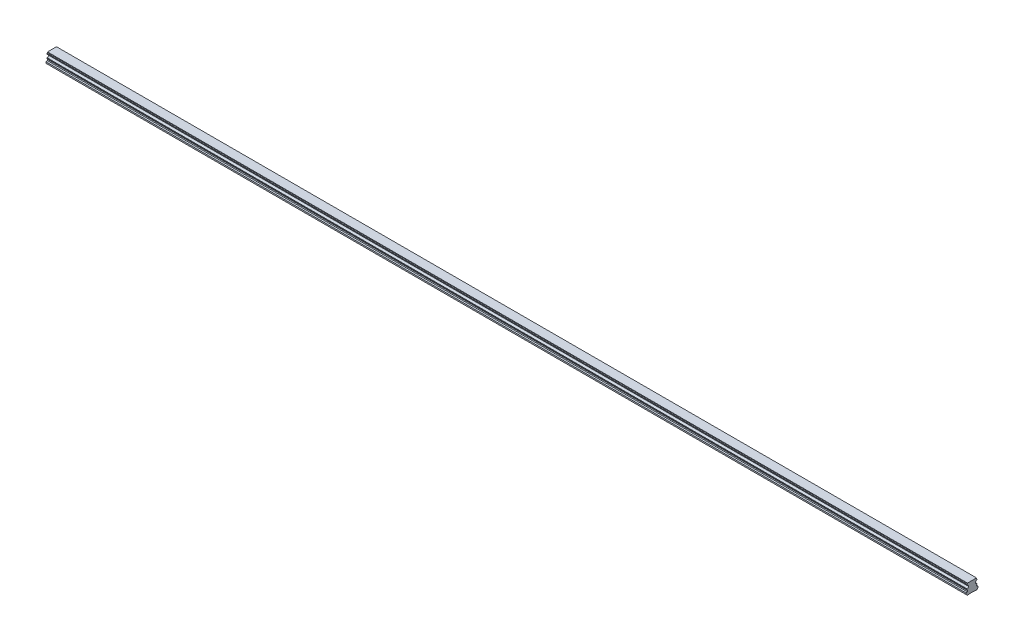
ISO-10303-21;
HEADER;
FILE_DESCRIPTION(('STEP AP214'),'2;1');
FILE_NAME('part.step','',(''),(''),'','','');
FILE_SCHEMA(('AUTOMOTIVE_DESIGN { 1 0 10303 214 1 1 1 1 }'));
ENDSEC;
DATA;
#1=APPLICATION_CONTEXT('core data for automotive mechanical design processes');
#2=APPLICATION_PROTOCOL_DEFINITION('international standard','automotive_design',2000,#1);
#3=PRODUCT_CONTEXT('',#1,'mechanical');
#4=PRODUCT('Part','Part','',(#3));
#5=PRODUCT_RELATED_PRODUCT_CATEGORY('part','',(#4));
#6=PRODUCT_DEFINITION_FORMATION('','',#4);
#7=PRODUCT_DEFINITION_CONTEXT('part definition',#1,'design');
#8=PRODUCT_DEFINITION('design','',#6,#7);
#9=PRODUCT_DEFINITION_SHAPE('','',#8);
#10=(LENGTH_UNIT() NAMED_UNIT(*) SI_UNIT(.MILLI.,.METRE.));
#11=(NAMED_UNIT(*) PLANE_ANGLE_UNIT() SI_UNIT($,.RADIAN.));
#12=(NAMED_UNIT(*) SI_UNIT($,.STERADIAN.) SOLID_ANGLE_UNIT());
#13=UNCERTAINTY_MEASURE_WITH_UNIT(LENGTH_MEASURE(1.E-05),#10,'distance_accuracy_value','');
#14=(GEOMETRIC_REPRESENTATION_CONTEXT(3) GLOBAL_UNCERTAINTY_ASSIGNED_CONTEXT((#13)) GLOBAL_UNIT_ASSIGNED_CONTEXT((#10,
#11,#12)) REPRESENTATION_CONTEXT('',''));
#15=CARTESIAN_POINT('',(0.,0.,0.));
#16=DIRECTION('',(0.,0.,1.));
#17=DIRECTION('',(1.,0.,0.));
#18=AXIS2_PLACEMENT_3D('',#15,#16,#17);
#19=CARTESIAN_POINT('',(1890.,0.499999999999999,0.));
#20=DIRECTION('',(0.,-1.,0.));
#21=DIRECTION('',(0.,0.,-1.));
#22=AXIS2_PLACEMENT_3D('',#19,#20,#21);
#23=CONICAL_SURFACE('',#22,3.5,0.785398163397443);
#24=CARTESIAN_POINT('',(1890.,1.00000000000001,0.));
#25=DIRECTION('',(0.,1.,0.));
#26=DIRECTION('',(0.,0.,1.));
#27=AXIS2_PLACEMENT_3D('',#24,#25,#26);
#28=CIRCLE('',#27,3.);
#29=CARTESIAN_POINT('',(1890.,1.00000000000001,3.));
#30=VERTEX_POINT('',#29);
#31=EDGE_CURVE('E11',#30,#30,#28,.F.);
#32=ORIENTED_EDGE('',*,*,#31,.F.);
#33=EDGE_LOOP('',(#32));
#34=FACE_BOUND('',#33,.T.);
#35=CARTESIAN_POINT('',(1890.,0.499999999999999,0.));
#36=DIRECTION('',(0.,1.,0.));
#37=DIRECTION('',(0.,0.,1.));
#38=AXIS2_PLACEMENT_3D('',#35,#36,#37);
#39=CIRCLE('',#38,3.5);
#40=CARTESIAN_POINT('',(1890.,0.5,3.5));
#41=VERTEX_POINT('',#40);
#42=EDGE_CURVE('E782',#41,#41,#39,.T.);
#43=ORIENTED_EDGE('',*,*,#42,.F.);
#44=EDGE_LOOP('',(#43));
#45=FACE_BOUND('',#44,.T.);
#46=ADVANCED_FACE('F39',(#34,#45),#23,.F.);
#47=CARTESIAN_POINT('',(1890.,12.,0.));
#48=DIRECTION('',(0.,-1.,0.));
#49=DIRECTION('',(0.,0.,-1.));
#50=AXIS2_PLACEMENT_3D('',#47,#48,#49);
#51=CYLINDRICAL_SURFACE('',#50,3.);
#52=ORIENTED_EDGE('',*,*,#31,.T.);
#53=EDGE_LOOP('',(#52));
#54=FACE_BOUND('',#53,.T.);
#55=CARTESIAN_POINT('',(1890.,12.,0.));
#56=DIRECTION('',(0.,-1.,0.));
#57=DIRECTION('',(0.,0.,-1.));
#58=AXIS2_PLACEMENT_3D('',#55,#56,#57);
#59=CIRCLE('',#58,3.);
#60=CARTESIAN_POINT('',(1890.,12.,-3.));
#61=VERTEX_POINT('',#60);
#62=EDGE_CURVE('E49',#61,#61,#59,.T.);
#63=ORIENTED_EDGE('',*,*,#62,.F.);
#64=EDGE_LOOP('',(#63));
#65=FACE_BOUND('',#64,.T.);
#66=ADVANCED_FACE('F1133',(#54,#65),#51,.F.);
#67=CARTESIAN_POINT('',(1890.,12.,0.));
#68=DIRECTION('',(0.,-1.,0.));
#69=DIRECTION('',(0.,0.,-1.));
#70=AXIS2_PLACEMENT_3D('',#67,#68,#69);
#71=PLANE('',#70);
#72=CARTESIAN_POINT('',(1890.,12.,0.));
#73=DIRECTION('',(0.,-1.,0.));
#74=DIRECTION('',(0.,0.,-1.));
#75=AXIS2_PLACEMENT_3D('',#72,#73,#74);
#76=CIRCLE('',#75,2.5);
#77=CARTESIAN_POINT('',(1890.,12.,-2.5));
#78=VERTEX_POINT('',#77);
#79=EDGE_CURVE('E42',#78,#78,#76,.T.);
#80=ORIENTED_EDGE('',*,*,#79,.F.);
#81=EDGE_LOOP('',(#80));
#82=FACE_BOUND('',#81,.T.);
#83=ORIENTED_EDGE('',*,*,#62,.T.);
#84=EDGE_LOOP('',(#83));
#85=FACE_BOUND('',#84,.T.);
#86=ADVANCED_FACE('F1138',(#82,#85),#71,.T.);
#87=CARTESIAN_POINT('',(1830.,0.499999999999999,0.));
#88=DIRECTION('',(0.,-1.,0.));
#89=DIRECTION('',(0.,0.,-1.));
#90=AXIS2_PLACEMENT_3D('',#87,#88,#89);
#91=CONICAL_SURFACE('',#90,3.5,0.785398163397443);
#92=CARTESIAN_POINT('',(1830.,1.00000000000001,0.));
#93=DIRECTION('',(0.,1.,0.));
#94=DIRECTION('',(0.,0.,1.));
#95=AXIS2_PLACEMENT_3D('',#92,#93,#94);
#96=CIRCLE('',#95,3.);
#97=CARTESIAN_POINT('',(1830.,1.00000000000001,3.));
#98=VERTEX_POINT('',#97);
#99=EDGE_CURVE('E778',#98,#98,#96,.F.);
#100=ORIENTED_EDGE('',*,*,#99,.F.);
#101=EDGE_LOOP('',(#100));
#102=FACE_BOUND('',#101,.T.);
#103=CARTESIAN_POINT('',(1830.,0.499999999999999,0.));
#104=DIRECTION('',(0.,1.,0.));
#105=DIRECTION('',(0.,0.,1.));
#106=AXIS2_PLACEMENT_3D('',#103,#104,#105);
#107=CIRCLE('',#106,3.5);
#108=CARTESIAN_POINT('',(1830.,0.5,3.5));
#109=VERTEX_POINT('',#108);
#110=EDGE_CURVE('E770',#109,#109,#107,.T.);
#111=ORIENTED_EDGE('',*,*,#110,.F.);
#112=EDGE_LOOP('',(#111));
#113=FACE_BOUND('',#112,.T.);
#114=ADVANCED_FACE('F1561',(#102,#113),#91,.F.);
#115=CARTESIAN_POINT('',(1830.,12.,0.));
#116=DIRECTION('',(0.,-1.,0.));
#117=DIRECTION('',(0.,0.,-1.));
#118=AXIS2_PLACEMENT_3D('',#115,#116,#117);
#119=CYLINDRICAL_SURFACE('',#118,3.);
#120=ORIENTED_EDGE('',*,*,#99,.T.);
#121=EDGE_LOOP('',(#120));
#122=FACE_BOUND('',#121,.T.);
#123=CARTESIAN_POINT('',(1830.,12.,0.));
#124=DIRECTION('',(0.,-1.,0.));
#125=DIRECTION('',(0.,0.,-1.));
#126=AXIS2_PLACEMENT_3D('',#123,#124,#125);
#127=CIRCLE('',#126,3.);
#128=CARTESIAN_POINT('',(1830.,12.,-3.));
#129=VERTEX_POINT('',#128);
#130=EDGE_CURVE('E774',#129,#129,#127,.T.);
#131=ORIENTED_EDGE('',*,*,#130,.F.);
#132=EDGE_LOOP('',(#131));
#133=FACE_BOUND('',#132,.T.);
#134=ADVANCED_FACE('F1557',(#122,#133),#119,.F.);
#135=CARTESIAN_POINT('',(1830.,12.,0.));
#136=DIRECTION('',(0.,-1.,0.));
#137=DIRECTION('',(0.,0.,-1.));
#138=AXIS2_PLACEMENT_3D('',#135,#136,#137);
#139=PLANE('',#138);
#140=CARTESIAN_POINT('',(1830.,12.,0.));
#141=DIRECTION('',(0.,-1.,0.));
#142=DIRECTION('',(0.,0.,-1.));
#143=AXIS2_PLACEMENT_3D('',#140,#141,#142);
#144=CIRCLE('',#143,2.5);
#145=CARTESIAN_POINT('',(1830.,12.,-2.5));
#146=VERTEX_POINT('',#145);
#147=EDGE_CURVE('E905',#146,#146,#144,.T.);
#148=ORIENTED_EDGE('',*,*,#147,.F.);
#149=EDGE_LOOP('',(#148));
#150=FACE_BOUND('',#149,.T.);
#151=ORIENTED_EDGE('',*,*,#130,.T.);
#152=EDGE_LOOP('',(#151));
#153=FACE_BOUND('',#152,.T.);
#154=ADVANCED_FACE('F1553',(#150,#153),#139,.T.);
#155=CARTESIAN_POINT('',(1770.,0.499999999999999,0.));
#156=DIRECTION('',(0.,-1.,0.));
#157=DIRECTION('',(0.,0.,-1.));
#158=AXIS2_PLACEMENT_3D('',#155,#156,#157);
#159=CONICAL_SURFACE('',#158,3.5,0.785398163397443);
#160=CARTESIAN_POINT('',(1770.,1.00000000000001,0.));
#161=DIRECTION('',(0.,1.,0.));
#162=DIRECTION('',(0.,0.,1.));
#163=AXIS2_PLACEMENT_3D('',#160,#161,#162);
#164=CIRCLE('',#163,3.);
#165=CARTESIAN_POINT('',(1770.,1.00000000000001,3.));
#166=VERTEX_POINT('',#165);
#167=EDGE_CURVE('E766',#166,#166,#164,.F.);
#168=ORIENTED_EDGE('',*,*,#167,.F.);
#169=EDGE_LOOP('',(#168));
#170=FACE_BOUND('',#169,.T.);
#171=CARTESIAN_POINT('',(1770.,0.499999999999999,0.));
#172=DIRECTION('',(0.,1.,0.));
#173=DIRECTION('',(0.,0.,1.));
#174=AXIS2_PLACEMENT_3D('',#171,#172,#173);
#175=CIRCLE('',#174,3.5);
#176=CARTESIAN_POINT('',(1770.,0.5,3.5));
#177=VERTEX_POINT('',#176);
#178=EDGE_CURVE('E758',#177,#177,#175,.T.);
#179=ORIENTED_EDGE('',*,*,#178,.F.);
#180=EDGE_LOOP('',(#179));
#181=FACE_BOUND('',#180,.T.);
#182=ADVANCED_FACE('F1549',(#170,#181),#159,.F.);
#183=CARTESIAN_POINT('',(1770.,12.,0.));
#184=DIRECTION('',(0.,-1.,0.));
#185=DIRECTION('',(0.,0.,-1.));
#186=AXIS2_PLACEMENT_3D('',#183,#184,#185);
#187=CYLINDRICAL_SURFACE('',#186,3.);
#188=ORIENTED_EDGE('',*,*,#167,.T.);
#189=EDGE_LOOP('',(#188));
#190=FACE_BOUND('',#189,.T.);
#191=CARTESIAN_POINT('',(1770.,12.,0.));
#192=DIRECTION('',(0.,-1.,0.));
#193=DIRECTION('',(0.,0.,-1.));
#194=AXIS2_PLACEMENT_3D('',#191,#192,#193);
#195=CIRCLE('',#194,3.);
#196=CARTESIAN_POINT('',(1770.,12.,-3.));
#197=VERTEX_POINT('',#196);
#198=EDGE_CURVE('E762',#197,#197,#195,.T.);
#199=ORIENTED_EDGE('',*,*,#198,.F.);
#200=EDGE_LOOP('',(#199));
#201=FACE_BOUND('',#200,.T.);
#202=ADVANCED_FACE('F1545',(#190,#201),#187,.F.);
#203=CARTESIAN_POINT('',(1770.,12.,0.));
#204=DIRECTION('',(0.,-1.,0.));
#205=DIRECTION('',(0.,0.,-1.));
#206=AXIS2_PLACEMENT_3D('',#203,#204,#205);
#207=PLANE('',#206);
#208=CARTESIAN_POINT('',(1770.,12.,0.));
#209=DIRECTION('',(0.,-1.,0.));
#210=DIRECTION('',(0.,0.,-1.));
#211=AXIS2_PLACEMENT_3D('',#208,#209,#210);
#212=CIRCLE('',#211,2.5);
#213=CARTESIAN_POINT('',(1770.,12.,-2.5));
#214=VERTEX_POINT('',#213);
#215=EDGE_CURVE('E902',#214,#214,#212,.T.);
#216=ORIENTED_EDGE('',*,*,#215,.F.);
#217=EDGE_LOOP('',(#216));
#218=FACE_BOUND('',#217,.T.);
#219=ORIENTED_EDGE('',*,*,#198,.T.);
#220=EDGE_LOOP('',(#219));
#221=FACE_BOUND('',#220,.T.);
#222=ADVANCED_FACE('F1541',(#218,#221),#207,.T.);
#223=CARTESIAN_POINT('',(1710.,0.499999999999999,0.));
#224=DIRECTION('',(0.,-1.,0.));
#225=DIRECTION('',(0.,0.,-1.));
#226=AXIS2_PLACEMENT_3D('',#223,#224,#225);
#227=CONICAL_SURFACE('',#226,3.5,0.785398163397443);
#228=CARTESIAN_POINT('',(1710.,1.00000000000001,0.));
#229=DIRECTION('',(0.,1.,0.));
#230=DIRECTION('',(0.,0.,1.));
#231=AXIS2_PLACEMENT_3D('',#228,#229,#230);
#232=CIRCLE('',#231,3.);
#233=CARTESIAN_POINT('',(1710.,1.00000000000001,3.));
#234=VERTEX_POINT('',#233);
#235=EDGE_CURVE('E754',#234,#234,#232,.F.);
#236=ORIENTED_EDGE('',*,*,#235,.F.);
#237=EDGE_LOOP('',(#236));
#238=FACE_BOUND('',#237,.T.);
#239=CARTESIAN_POINT('',(1710.,0.499999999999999,0.));
#240=DIRECTION('',(0.,1.,0.));
#241=DIRECTION('',(0.,0.,1.));
#242=AXIS2_PLACEMENT_3D('',#239,#240,#241);
#243=CIRCLE('',#242,3.5);
#244=CARTESIAN_POINT('',(1710.,0.5,3.5));
#245=VERTEX_POINT('',#244);
#246=EDGE_CURVE('E746',#245,#245,#243,.T.);
#247=ORIENTED_EDGE('',*,*,#246,.F.);
#248=EDGE_LOOP('',(#247));
#249=FACE_BOUND('',#248,.T.);
#250=ADVANCED_FACE('F1537',(#238,#249),#227,.F.);
#251=CARTESIAN_POINT('',(1710.,12.,0.));
#252=DIRECTION('',(0.,-1.,0.));
#253=DIRECTION('',(0.,0.,-1.));
#254=AXIS2_PLACEMENT_3D('',#251,#252,#253);
#255=CYLINDRICAL_SURFACE('',#254,3.);
#256=ORIENTED_EDGE('',*,*,#235,.T.);
#257=EDGE_LOOP('',(#256));
#258=FACE_BOUND('',#257,.T.);
#259=CARTESIAN_POINT('',(1710.,12.,0.));
#260=DIRECTION('',(0.,-1.,0.));
#261=DIRECTION('',(0.,0.,-1.));
#262=AXIS2_PLACEMENT_3D('',#259,#260,#261);
#263=CIRCLE('',#262,3.);
#264=CARTESIAN_POINT('',(1710.,12.,-3.));
#265=VERTEX_POINT('',#264);
#266=EDGE_CURVE('E750',#265,#265,#263,.T.);
#267=ORIENTED_EDGE('',*,*,#266,.F.);
#268=EDGE_LOOP('',(#267));
#269=FACE_BOUND('',#268,.T.);
#270=ADVANCED_FACE('F1533',(#258,#269),#255,.F.);
#271=CARTESIAN_POINT('',(1710.,12.,0.));
#272=DIRECTION('',(0.,-1.,0.));
#273=DIRECTION('',(0.,0.,-1.));
#274=AXIS2_PLACEMENT_3D('',#271,#272,#273);
#275=PLANE('',#274);
#276=CARTESIAN_POINT('',(1710.,12.,0.));
#277=DIRECTION('',(0.,-1.,0.));
#278=DIRECTION('',(0.,0.,-1.));
#279=AXIS2_PLACEMENT_3D('',#276,#277,#278);
#280=CIRCLE('',#279,2.5);
#281=CARTESIAN_POINT('',(1710.,12.,-2.5));
#282=VERTEX_POINT('',#281);
#283=EDGE_CURVE('E898',#282,#282,#280,.T.);
#284=ORIENTED_EDGE('',*,*,#283,.F.);
#285=EDGE_LOOP('',(#284));
#286=FACE_BOUND('',#285,.T.);
#287=ORIENTED_EDGE('',*,*,#266,.T.);
#288=EDGE_LOOP('',(#287));
#289=FACE_BOUND('',#288,.T.);
#290=ADVANCED_FACE('F1529',(#286,#289),#275,.T.);
#291=CARTESIAN_POINT('',(1650.,0.499999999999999,0.));
#292=DIRECTION('',(0.,-1.,0.));
#293=DIRECTION('',(0.,0.,-1.));
#294=AXIS2_PLACEMENT_3D('',#291,#292,#293);
#295=CONICAL_SURFACE('',#294,3.5,0.785398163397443);
#296=CARTESIAN_POINT('',(1650.,1.00000000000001,0.));
#297=DIRECTION('',(0.,1.,0.));
#298=DIRECTION('',(0.,0.,1.));
#299=AXIS2_PLACEMENT_3D('',#296,#297,#298);
#300=CIRCLE('',#299,3.);
#301=CARTESIAN_POINT('',(1650.,1.00000000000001,3.));
#302=VERTEX_POINT('',#301);
#303=EDGE_CURVE('E742',#302,#302,#300,.F.);
#304=ORIENTED_EDGE('',*,*,#303,.F.);
#305=EDGE_LOOP('',(#304));
#306=FACE_BOUND('',#305,.T.);
#307=CARTESIAN_POINT('',(1650.,0.499999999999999,0.));
#308=DIRECTION('',(0.,1.,0.));
#309=DIRECTION('',(0.,0.,1.));
#310=AXIS2_PLACEMENT_3D('',#307,#308,#309);
#311=CIRCLE('',#310,3.5);
#312=CARTESIAN_POINT('',(1650.,0.5,3.5));
#313=VERTEX_POINT('',#312);
#314=EDGE_CURVE('E734',#313,#313,#311,.T.);
#315=ORIENTED_EDGE('',*,*,#314,.F.);
#316=EDGE_LOOP('',(#315));
#317=FACE_BOUND('',#316,.T.);
#318=ADVANCED_FACE('F1525',(#306,#317),#295,.F.);
#319=CARTESIAN_POINT('',(1650.,12.,0.));
#320=DIRECTION('',(0.,-1.,0.));
#321=DIRECTION('',(0.,0.,-1.));
#322=AXIS2_PLACEMENT_3D('',#319,#320,#321);
#323=CYLINDRICAL_SURFACE('',#322,3.);
#324=ORIENTED_EDGE('',*,*,#303,.T.);
#325=EDGE_LOOP('',(#324));
#326=FACE_BOUND('',#325,.T.);
#327=CARTESIAN_POINT('',(1650.,12.,0.));
#328=DIRECTION('',(0.,-1.,0.));
#329=DIRECTION('',(0.,0.,-1.));
#330=AXIS2_PLACEMENT_3D('',#327,#328,#329);
#331=CIRCLE('',#330,3.);
#332=CARTESIAN_POINT('',(1650.,12.,-3.));
#333=VERTEX_POINT('',#332);
#334=EDGE_CURVE('E738',#333,#333,#331,.T.);
#335=ORIENTED_EDGE('',*,*,#334,.F.);
#336=EDGE_LOOP('',(#335));
#337=FACE_BOUND('',#336,.T.);
#338=ADVANCED_FACE('F1521',(#326,#337),#323,.F.);
#339=CARTESIAN_POINT('',(1650.,12.,0.));
#340=DIRECTION('',(0.,-1.,0.));
#341=DIRECTION('',(0.,0.,-1.));
#342=AXIS2_PLACEMENT_3D('',#339,#340,#341);
#343=PLANE('',#342);
#344=CARTESIAN_POINT('',(1650.,12.,0.));
#345=DIRECTION('',(0.,-1.,0.));
#346=DIRECTION('',(0.,0.,-1.));
#347=AXIS2_PLACEMENT_3D('',#344,#345,#346);
#348=CIRCLE('',#347,2.5);
#349=CARTESIAN_POINT('',(1650.,12.,-2.5));
#350=VERTEX_POINT('',#349);
#351=EDGE_CURVE('E894',#350,#350,#348,.T.);
#352=ORIENTED_EDGE('',*,*,#351,.F.);
#353=EDGE_LOOP('',(#352));
#354=FACE_BOUND('',#353,.T.);
#355=ORIENTED_EDGE('',*,*,#334,.T.);
#356=EDGE_LOOP('',(#355));
#357=FACE_BOUND('',#356,.T.);
#358=ADVANCED_FACE('F1517',(#354,#357),#343,.T.);
#359=CARTESIAN_POINT('',(1590.,0.499999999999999,0.));
#360=DIRECTION('',(0.,-1.,0.));
#361=DIRECTION('',(0.,0.,-1.));
#362=AXIS2_PLACEMENT_3D('',#359,#360,#361);
#363=CONICAL_SURFACE('',#362,3.5,0.785398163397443);
#364=CARTESIAN_POINT('',(1590.,1.00000000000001,0.));
#365=DIRECTION('',(0.,1.,0.));
#366=DIRECTION('',(0.,0.,1.));
#367=AXIS2_PLACEMENT_3D('',#364,#365,#366);
#368=CIRCLE('',#367,3.);
#369=CARTESIAN_POINT('',(1590.,1.00000000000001,3.));
#370=VERTEX_POINT('',#369);
#371=EDGE_CURVE('E730',#370,#370,#368,.F.);
#372=ORIENTED_EDGE('',*,*,#371,.F.);
#373=EDGE_LOOP('',(#372));
#374=FACE_BOUND('',#373,.T.);
#375=CARTESIAN_POINT('',(1590.,0.499999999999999,0.));
#376=DIRECTION('',(0.,1.,0.));
#377=DIRECTION('',(0.,0.,1.));
#378=AXIS2_PLACEMENT_3D('',#375,#376,#377);
#379=CIRCLE('',#378,3.5);
#380=CARTESIAN_POINT('',(1590.,0.5,3.5));
#381=VERTEX_POINT('',#380);
#382=EDGE_CURVE('E722',#381,#381,#379,.T.);
#383=ORIENTED_EDGE('',*,*,#382,.F.);
#384=EDGE_LOOP('',(#383));
#385=FACE_BOUND('',#384,.T.);
#386=ADVANCED_FACE('F1513',(#374,#385),#363,.F.);
#387=CARTESIAN_POINT('',(1590.,12.,0.));
#388=DIRECTION('',(0.,-1.,0.));
#389=DIRECTION('',(0.,0.,-1.));
#390=AXIS2_PLACEMENT_3D('',#387,#388,#389);
#391=CYLINDRICAL_SURFACE('',#390,3.);
#392=ORIENTED_EDGE('',*,*,#371,.T.);
#393=EDGE_LOOP('',(#392));
#394=FACE_BOUND('',#393,.T.);
#395=CARTESIAN_POINT('',(1590.,12.,0.));
#396=DIRECTION('',(0.,-1.,0.));
#397=DIRECTION('',(0.,0.,-1.));
#398=AXIS2_PLACEMENT_3D('',#395,#396,#397);
#399=CIRCLE('',#398,3.);
#400=CARTESIAN_POINT('',(1590.,12.,-3.));
#401=VERTEX_POINT('',#400);
#402=EDGE_CURVE('E726',#401,#401,#399,.T.);
#403=ORIENTED_EDGE('',*,*,#402,.F.);
#404=EDGE_LOOP('',(#403));
#405=FACE_BOUND('',#404,.T.);
#406=ADVANCED_FACE('F1509',(#394,#405),#391,.F.);
#407=CARTESIAN_POINT('',(1590.,12.,0.));
#408=DIRECTION('',(0.,-1.,0.));
#409=DIRECTION('',(0.,0.,-1.));
#410=AXIS2_PLACEMENT_3D('',#407,#408,#409);
#411=PLANE('',#410);
#412=CARTESIAN_POINT('',(1590.,12.,0.));
#413=DIRECTION('',(0.,-1.,0.));
#414=DIRECTION('',(0.,0.,-1.));
#415=AXIS2_PLACEMENT_3D('',#412,#413,#414);
#416=CIRCLE('',#415,2.5);
#417=CARTESIAN_POINT('',(1590.,12.,-2.5));
#418=VERTEX_POINT('',#417);
#419=EDGE_CURVE('E890',#418,#418,#416,.T.);
#420=ORIENTED_EDGE('',*,*,#419,.F.);
#421=EDGE_LOOP('',(#420));
#422=FACE_BOUND('',#421,.T.);
#423=ORIENTED_EDGE('',*,*,#402,.T.);
#424=EDGE_LOOP('',(#423));
#425=FACE_BOUND('',#424,.T.);
#426=ADVANCED_FACE('F1505',(#422,#425),#411,.T.);
#427=CARTESIAN_POINT('',(1530.,0.499999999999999,0.));
#428=DIRECTION('',(0.,-1.,0.));
#429=DIRECTION('',(0.,0.,-1.));
#430=AXIS2_PLACEMENT_3D('',#427,#428,#429);
#431=CONICAL_SURFACE('',#430,3.5,0.785398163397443);
#432=CARTESIAN_POINT('',(1530.,1.00000000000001,0.));
#433=DIRECTION('',(0.,1.,0.));
#434=DIRECTION('',(0.,0.,1.));
#435=AXIS2_PLACEMENT_3D('',#432,#433,#434);
#436=CIRCLE('',#435,3.);
#437=CARTESIAN_POINT('',(1530.,1.00000000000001,3.));
#438=VERTEX_POINT('',#437);
#439=EDGE_CURVE('E718',#438,#438,#436,.F.);
#440=ORIENTED_EDGE('',*,*,#439,.F.);
#441=EDGE_LOOP('',(#440));
#442=FACE_BOUND('',#441,.T.);
#443=CARTESIAN_POINT('',(1530.,0.499999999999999,0.));
#444=DIRECTION('',(0.,1.,0.));
#445=DIRECTION('',(0.,0.,1.));
#446=AXIS2_PLACEMENT_3D('',#443,#444,#445);
#447=CIRCLE('',#446,3.5);
#448=CARTESIAN_POINT('',(1530.,0.5,3.5));
#449=VERTEX_POINT('',#448);
#450=EDGE_CURVE('E710',#449,#449,#447,.T.);
#451=ORIENTED_EDGE('',*,*,#450,.F.);
#452=EDGE_LOOP('',(#451));
#453=FACE_BOUND('',#452,.T.);
#454=ADVANCED_FACE('F1501',(#442,#453),#431,.F.);
#455=CARTESIAN_POINT('',(1530.,12.,0.));
#456=DIRECTION('',(0.,-1.,0.));
#457=DIRECTION('',(0.,0.,-1.));
#458=AXIS2_PLACEMENT_3D('',#455,#456,#457);
#459=CYLINDRICAL_SURFACE('',#458,3.);
#460=ORIENTED_EDGE('',*,*,#439,.T.);
#461=EDGE_LOOP('',(#460));
#462=FACE_BOUND('',#461,.T.);
#463=CARTESIAN_POINT('',(1530.,12.,0.));
#464=DIRECTION('',(0.,-1.,0.));
#465=DIRECTION('',(0.,0.,-1.));
#466=AXIS2_PLACEMENT_3D('',#463,#464,#465);
#467=CIRCLE('',#466,3.);
#468=CARTESIAN_POINT('',(1530.,12.,-3.));
#469=VERTEX_POINT('',#468);
#470=EDGE_CURVE('E714',#469,#469,#467,.T.);
#471=ORIENTED_EDGE('',*,*,#470,.F.);
#472=EDGE_LOOP('',(#471));
#473=FACE_BOUND('',#472,.T.);
#474=ADVANCED_FACE('F1497',(#462,#473),#459,.F.);
#475=CARTESIAN_POINT('',(1530.,12.,0.));
#476=DIRECTION('',(0.,-1.,0.));
#477=DIRECTION('',(0.,0.,-1.));
#478=AXIS2_PLACEMENT_3D('',#475,#476,#477);
#479=PLANE('',#478);
#480=CARTESIAN_POINT('',(1530.,12.,0.));
#481=DIRECTION('',(0.,-1.,0.));
#482=DIRECTION('',(0.,0.,-1.));
#483=AXIS2_PLACEMENT_3D('',#480,#481,#482);
#484=CIRCLE('',#483,2.5);
#485=CARTESIAN_POINT('',(1530.,12.,-2.5));
#486=VERTEX_POINT('',#485);
#487=EDGE_CURVE('E886',#486,#486,#484,.T.);
#488=ORIENTED_EDGE('',*,*,#487,.F.);
#489=EDGE_LOOP('',(#488));
#490=FACE_BOUND('',#489,.T.);
#491=ORIENTED_EDGE('',*,*,#470,.T.);
#492=EDGE_LOOP('',(#491));
#493=FACE_BOUND('',#492,.T.);
#494=ADVANCED_FACE('F1493',(#490,#493),#479,.T.);
#495=CARTESIAN_POINT('',(1470.,0.499999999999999,0.));
#496=DIRECTION('',(0.,-1.,0.));
#497=DIRECTION('',(0.,0.,-1.));
#498=AXIS2_PLACEMENT_3D('',#495,#496,#497);
#499=CONICAL_SURFACE('',#498,3.5,0.785398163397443);
#500=CARTESIAN_POINT('',(1470.,1.00000000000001,0.));
#501=DIRECTION('',(0.,1.,0.));
#502=DIRECTION('',(0.,0.,1.));
#503=AXIS2_PLACEMENT_3D('',#500,#501,#502);
#504=CIRCLE('',#503,3.);
#505=CARTESIAN_POINT('',(1470.,1.00000000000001,3.));
#506=VERTEX_POINT('',#505);
#507=EDGE_CURVE('E706',#506,#506,#504,.F.);
#508=ORIENTED_EDGE('',*,*,#507,.F.);
#509=EDGE_LOOP('',(#508));
#510=FACE_BOUND('',#509,.T.);
#511=CARTESIAN_POINT('',(1470.,0.499999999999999,0.));
#512=DIRECTION('',(0.,1.,0.));
#513=DIRECTION('',(0.,0.,1.));
#514=AXIS2_PLACEMENT_3D('',#511,#512,#513);
#515=CIRCLE('',#514,3.5);
#516=CARTESIAN_POINT('',(1470.,0.5,3.5));
#517=VERTEX_POINT('',#516);
#518=EDGE_CURVE('E698',#517,#517,#515,.T.);
#519=ORIENTED_EDGE('',*,*,#518,.F.);
#520=EDGE_LOOP('',(#519));
#521=FACE_BOUND('',#520,.T.);
#522=ADVANCED_FACE('F1489',(#510,#521),#499,.F.);
#523=CARTESIAN_POINT('',(1470.,12.,0.));
#524=DIRECTION('',(0.,-1.,0.));
#525=DIRECTION('',(0.,0.,-1.));
#526=AXIS2_PLACEMENT_3D('',#523,#524,#525);
#527=CYLINDRICAL_SURFACE('',#526,3.);
#528=ORIENTED_EDGE('',*,*,#507,.T.);
#529=EDGE_LOOP('',(#528));
#530=FACE_BOUND('',#529,.T.);
#531=CARTESIAN_POINT('',(1470.,12.,0.));
#532=DIRECTION('',(0.,-1.,0.));
#533=DIRECTION('',(0.,0.,-1.));
#534=AXIS2_PLACEMENT_3D('',#531,#532,#533);
#535=CIRCLE('',#534,3.);
#536=CARTESIAN_POINT('',(1470.,12.,-3.));
#537=VERTEX_POINT('',#536);
#538=EDGE_CURVE('E702',#537,#537,#535,.T.);
#539=ORIENTED_EDGE('',*,*,#538,.F.);
#540=EDGE_LOOP('',(#539));
#541=FACE_BOUND('',#540,.T.);
#542=ADVANCED_FACE('F1485',(#530,#541),#527,.F.);
#543=CARTESIAN_POINT('',(1470.,12.,0.));
#544=DIRECTION('',(0.,-1.,0.));
#545=DIRECTION('',(0.,0.,-1.));
#546=AXIS2_PLACEMENT_3D('',#543,#544,#545);
#547=PLANE('',#546);
#548=CARTESIAN_POINT('',(1470.,12.,0.));
#549=DIRECTION('',(0.,-1.,0.));
#550=DIRECTION('',(0.,0.,-1.));
#551=AXIS2_PLACEMENT_3D('',#548,#549,#550);
#552=CIRCLE('',#551,2.5);
#553=CARTESIAN_POINT('',(1470.,12.,-2.5));
#554=VERTEX_POINT('',#553);
#555=EDGE_CURVE('E882',#554,#554,#552,.T.);
#556=ORIENTED_EDGE('',*,*,#555,.F.);
#557=EDGE_LOOP('',(#556));
#558=FACE_BOUND('',#557,.T.);
#559=ORIENTED_EDGE('',*,*,#538,.T.);
#560=EDGE_LOOP('',(#559));
#561=FACE_BOUND('',#560,.T.);
#562=ADVANCED_FACE('F1481',(#558,#561),#547,.T.);
#563=CARTESIAN_POINT('',(1410.,0.499999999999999,0.));
#564=DIRECTION('',(0.,-1.,0.));
#565=DIRECTION('',(0.,0.,-1.));
#566=AXIS2_PLACEMENT_3D('',#563,#564,#565);
#567=CONICAL_SURFACE('',#566,3.5,0.785398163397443);
#568=CARTESIAN_POINT('',(1410.,1.00000000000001,0.));
#569=DIRECTION('',(0.,1.,0.));
#570=DIRECTION('',(0.,0.,1.));
#571=AXIS2_PLACEMENT_3D('',#568,#569,#570);
#572=CIRCLE('',#571,3.);
#573=CARTESIAN_POINT('',(1410.,1.00000000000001,3.));
#574=VERTEX_POINT('',#573);
#575=EDGE_CURVE('E694',#574,#574,#572,.F.);
#576=ORIENTED_EDGE('',*,*,#575,.F.);
#577=EDGE_LOOP('',(#576));
#578=FACE_BOUND('',#577,.T.);
#579=CARTESIAN_POINT('',(1410.,0.499999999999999,0.));
#580=DIRECTION('',(0.,1.,0.));
#581=DIRECTION('',(0.,0.,1.));
#582=AXIS2_PLACEMENT_3D('',#579,#580,#581);
#583=CIRCLE('',#582,3.5);
#584=CARTESIAN_POINT('',(1410.,0.5,3.5));
#585=VERTEX_POINT('',#584);
#586=EDGE_CURVE('E686',#585,#585,#583,.T.);
#587=ORIENTED_EDGE('',*,*,#586,.F.);
#588=EDGE_LOOP('',(#587));
#589=FACE_BOUND('',#588,.T.);
#590=ADVANCED_FACE('F1477',(#578,#589),#567,.F.);
#591=CARTESIAN_POINT('',(1410.,12.,0.));
#592=DIRECTION('',(0.,-1.,0.));
#593=DIRECTION('',(0.,0.,-1.));
#594=AXIS2_PLACEMENT_3D('',#591,#592,#593);
#595=CYLINDRICAL_SURFACE('',#594,3.);
#596=ORIENTED_EDGE('',*,*,#575,.T.);
#597=EDGE_LOOP('',(#596));
#598=FACE_BOUND('',#597,.T.);
#599=CARTESIAN_POINT('',(1410.,12.,0.));
#600=DIRECTION('',(0.,-1.,0.));
#601=DIRECTION('',(0.,0.,-1.));
#602=AXIS2_PLACEMENT_3D('',#599,#600,#601);
#603=CIRCLE('',#602,3.);
#604=CARTESIAN_POINT('',(1410.,12.,-3.));
#605=VERTEX_POINT('',#604);
#606=EDGE_CURVE('E690',#605,#605,#603,.T.);
#607=ORIENTED_EDGE('',*,*,#606,.F.);
#608=EDGE_LOOP('',(#607));
#609=FACE_BOUND('',#608,.T.);
#610=ADVANCED_FACE('F1473',(#598,#609),#595,.F.);
#611=CARTESIAN_POINT('',(1410.,12.,0.));
#612=DIRECTION('',(0.,-1.,0.));
#613=DIRECTION('',(0.,0.,-1.));
#614=AXIS2_PLACEMENT_3D('',#611,#612,#613);
#615=PLANE('',#614);
#616=CARTESIAN_POINT('',(1410.,12.,0.));
#617=DIRECTION('',(0.,-1.,0.));
#618=DIRECTION('',(0.,0.,-1.));
#619=AXIS2_PLACEMENT_3D('',#616,#617,#618);
#620=CIRCLE('',#619,2.5);
#621=CARTESIAN_POINT('',(1410.,12.,-2.5));
#622=VERTEX_POINT('',#621);
#623=EDGE_CURVE('E878',#622,#622,#620,.T.);
#624=ORIENTED_EDGE('',*,*,#623,.F.);
#625=EDGE_LOOP('',(#624));
#626=FACE_BOUND('',#625,.T.);
#627=ORIENTED_EDGE('',*,*,#606,.T.);
#628=EDGE_LOOP('',(#627));
#629=FACE_BOUND('',#628,.T.);
#630=ADVANCED_FACE('F1469',(#626,#629),#615,.T.);
#631=CARTESIAN_POINT('',(1350.,0.499999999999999,0.));
#632=DIRECTION('',(0.,-1.,0.));
#633=DIRECTION('',(0.,0.,-1.));
#634=AXIS2_PLACEMENT_3D('',#631,#632,#633);
#635=CONICAL_SURFACE('',#634,3.5,0.785398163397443);
#636=CARTESIAN_POINT('',(1350.,1.00000000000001,0.));
#637=DIRECTION('',(0.,1.,0.));
#638=DIRECTION('',(0.,0.,1.));
#639=AXIS2_PLACEMENT_3D('',#636,#637,#638);
#640=CIRCLE('',#639,3.);
#641=CARTESIAN_POINT('',(1350.,1.00000000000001,3.));
#642=VERTEX_POINT('',#641);
#643=EDGE_CURVE('E682',#642,#642,#640,.F.);
#644=ORIENTED_EDGE('',*,*,#643,.F.);
#645=EDGE_LOOP('',(#644));
#646=FACE_BOUND('',#645,.T.);
#647=CARTESIAN_POINT('',(1350.,0.499999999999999,0.));
#648=DIRECTION('',(0.,1.,0.));
#649=DIRECTION('',(0.,0.,1.));
#650=AXIS2_PLACEMENT_3D('',#647,#648,#649);
#651=CIRCLE('',#650,3.5);
#652=CARTESIAN_POINT('',(1350.,0.5,3.5));
#653=VERTEX_POINT('',#652);
#654=EDGE_CURVE('E674',#653,#653,#651,.T.);
#655=ORIENTED_EDGE('',*,*,#654,.F.);
#656=EDGE_LOOP('',(#655));
#657=FACE_BOUND('',#656,.T.);
#658=ADVANCED_FACE('F1465',(#646,#657),#635,.F.);
#659=CARTESIAN_POINT('',(1350.,12.,0.));
#660=DIRECTION('',(0.,-1.,0.));
#661=DIRECTION('',(0.,0.,-1.));
#662=AXIS2_PLACEMENT_3D('',#659,#660,#661);
#663=CYLINDRICAL_SURFACE('',#662,3.);
#664=ORIENTED_EDGE('',*,*,#643,.T.);
#665=EDGE_LOOP('',(#664));
#666=FACE_BOUND('',#665,.T.);
#667=CARTESIAN_POINT('',(1350.,12.,0.));
#668=DIRECTION('',(0.,-1.,0.));
#669=DIRECTION('',(0.,0.,-1.));
#670=AXIS2_PLACEMENT_3D('',#667,#668,#669);
#671=CIRCLE('',#670,3.);
#672=CARTESIAN_POINT('',(1350.,12.,-3.));
#673=VERTEX_POINT('',#672);
#674=EDGE_CURVE('E678',#673,#673,#671,.T.);
#675=ORIENTED_EDGE('',*,*,#674,.F.);
#676=EDGE_LOOP('',(#675));
#677=FACE_BOUND('',#676,.T.);
#678=ADVANCED_FACE('F1461',(#666,#677),#663,.F.);
#679=CARTESIAN_POINT('',(1350.,12.,0.));
#680=DIRECTION('',(0.,-1.,0.));
#681=DIRECTION('',(0.,0.,-1.));
#682=AXIS2_PLACEMENT_3D('',#679,#680,#681);
#683=PLANE('',#682);
#684=CARTESIAN_POINT('',(1350.,12.,0.));
#685=DIRECTION('',(0.,-1.,0.));
#686=DIRECTION('',(0.,0.,-1.));
#687=AXIS2_PLACEMENT_3D('',#684,#685,#686);
#688=CIRCLE('',#687,2.5);
#689=CARTESIAN_POINT('',(1350.,12.,-2.5));
#690=VERTEX_POINT('',#689);
#691=EDGE_CURVE('E874',#690,#690,#688,.T.);
#692=ORIENTED_EDGE('',*,*,#691,.F.);
#693=EDGE_LOOP('',(#692));
#694=FACE_BOUND('',#693,.T.);
#695=ORIENTED_EDGE('',*,*,#674,.T.);
#696=EDGE_LOOP('',(#695));
#697=FACE_BOUND('',#696,.T.);
#698=ADVANCED_FACE('F1457',(#694,#697),#683,.T.);
#699=CARTESIAN_POINT('',(1290.,0.499999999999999,0.));
#700=DIRECTION('',(0.,-1.,0.));
#701=DIRECTION('',(0.,0.,-1.));
#702=AXIS2_PLACEMENT_3D('',#699,#700,#701);
#703=CONICAL_SURFACE('',#702,3.5,0.785398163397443);
#704=CARTESIAN_POINT('',(1290.,1.00000000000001,0.));
#705=DIRECTION('',(0.,1.,0.));
#706=DIRECTION('',(0.,0.,1.));
#707=AXIS2_PLACEMENT_3D('',#704,#705,#706);
#708=CIRCLE('',#707,3.);
#709=CARTESIAN_POINT('',(1290.,1.00000000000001,3.));
#710=VERTEX_POINT('',#709);
#711=EDGE_CURVE('E670',#710,#710,#708,.F.);
#712=ORIENTED_EDGE('',*,*,#711,.F.);
#713=EDGE_LOOP('',(#712));
#714=FACE_BOUND('',#713,.T.);
#715=CARTESIAN_POINT('',(1290.,0.499999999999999,0.));
#716=DIRECTION('',(0.,1.,0.));
#717=DIRECTION('',(0.,0.,1.));
#718=AXIS2_PLACEMENT_3D('',#715,#716,#717);
#719=CIRCLE('',#718,3.5);
#720=CARTESIAN_POINT('',(1290.,0.5,3.5));
#721=VERTEX_POINT('',#720);
#722=EDGE_CURVE('E662',#721,#721,#719,.T.);
#723=ORIENTED_EDGE('',*,*,#722,.F.);
#724=EDGE_LOOP('',(#723));
#725=FACE_BOUND('',#724,.T.);
#726=ADVANCED_FACE('F1453',(#714,#725),#703,.F.);
#727=CARTESIAN_POINT('',(1290.,12.,0.));
#728=DIRECTION('',(0.,-1.,0.));
#729=DIRECTION('',(0.,0.,-1.));
#730=AXIS2_PLACEMENT_3D('',#727,#728,#729);
#731=CYLINDRICAL_SURFACE('',#730,3.);
#732=ORIENTED_EDGE('',*,*,#711,.T.);
#733=EDGE_LOOP('',(#732));
#734=FACE_BOUND('',#733,.T.);
#735=CARTESIAN_POINT('',(1290.,12.,0.));
#736=DIRECTION('',(0.,-1.,0.));
#737=DIRECTION('',(0.,0.,-1.));
#738=AXIS2_PLACEMENT_3D('',#735,#736,#737);
#739=CIRCLE('',#738,3.);
#740=CARTESIAN_POINT('',(1290.,12.,-3.));
#741=VERTEX_POINT('',#740);
#742=EDGE_CURVE('E666',#741,#741,#739,.T.);
#743=ORIENTED_EDGE('',*,*,#742,.F.);
#744=EDGE_LOOP('',(#743));
#745=FACE_BOUND('',#744,.T.);
#746=ADVANCED_FACE('F1449',(#734,#745),#731,.F.);
#747=CARTESIAN_POINT('',(1290.,12.,0.));
#748=DIRECTION('',(0.,-1.,0.));
#749=DIRECTION('',(0.,0.,-1.));
#750=AXIS2_PLACEMENT_3D('',#747,#748,#749);
#751=PLANE('',#750);
#752=CARTESIAN_POINT('',(1290.,12.,0.));
#753=DIRECTION('',(0.,-1.,0.));
#754=DIRECTION('',(0.,0.,-1.));
#755=AXIS2_PLACEMENT_3D('',#752,#753,#754);
#756=CIRCLE('',#755,2.5);
#757=CARTESIAN_POINT('',(1290.,12.,-2.5));
#758=VERTEX_POINT('',#757);
#759=EDGE_CURVE('E870',#758,#758,#756,.T.);
#760=ORIENTED_EDGE('',*,*,#759,.F.);
#761=EDGE_LOOP('',(#760));
#762=FACE_BOUND('',#761,.T.);
#763=ORIENTED_EDGE('',*,*,#742,.T.);
#764=EDGE_LOOP('',(#763));
#765=FACE_BOUND('',#764,.T.);
#766=ADVANCED_FACE('F1445',(#762,#765),#751,.T.);
#767=CARTESIAN_POINT('',(1230.,0.499999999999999,0.));
#768=DIRECTION('',(0.,-1.,0.));
#769=DIRECTION('',(0.,0.,-1.));
#770=AXIS2_PLACEMENT_3D('',#767,#768,#769);
#771=CONICAL_SURFACE('',#770,3.5,0.785398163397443);
#772=CARTESIAN_POINT('',(1230.,1.00000000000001,0.));
#773=DIRECTION('',(0.,1.,0.));
#774=DIRECTION('',(0.,0.,1.));
#775=AXIS2_PLACEMENT_3D('',#772,#773,#774);
#776=CIRCLE('',#775,3.);
#777=CARTESIAN_POINT('',(1230.,1.00000000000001,3.));
#778=VERTEX_POINT('',#777);
#779=EDGE_CURVE('E658',#778,#778,#776,.F.);
#780=ORIENTED_EDGE('',*,*,#779,.F.);
#781=EDGE_LOOP('',(#780));
#782=FACE_BOUND('',#781,.T.);
#783=CARTESIAN_POINT('',(1230.,0.499999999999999,0.));
#784=DIRECTION('',(0.,1.,0.));
#785=DIRECTION('',(0.,0.,1.));
#786=AXIS2_PLACEMENT_3D('',#783,#784,#785);
#787=CIRCLE('',#786,3.5);
#788=CARTESIAN_POINT('',(1230.,0.5,3.5));
#789=VERTEX_POINT('',#788);
#790=EDGE_CURVE('E650',#789,#789,#787,.T.);
#791=ORIENTED_EDGE('',*,*,#790,.F.);
#792=EDGE_LOOP('',(#791));
#793=FACE_BOUND('',#792,.T.);
#794=ADVANCED_FACE('F1441',(#782,#793),#771,.F.);
#795=CARTESIAN_POINT('',(1230.,12.,0.));
#796=DIRECTION('',(0.,-1.,0.));
#797=DIRECTION('',(0.,0.,-1.));
#798=AXIS2_PLACEMENT_3D('',#795,#796,#797);
#799=CYLINDRICAL_SURFACE('',#798,3.);
#800=ORIENTED_EDGE('',*,*,#779,.T.);
#801=EDGE_LOOP('',(#800));
#802=FACE_BOUND('',#801,.T.);
#803=CARTESIAN_POINT('',(1230.,12.,0.));
#804=DIRECTION('',(0.,-1.,0.));
#805=DIRECTION('',(0.,0.,-1.));
#806=AXIS2_PLACEMENT_3D('',#803,#804,#805);
#807=CIRCLE('',#806,3.);
#808=CARTESIAN_POINT('',(1230.,12.,-3.));
#809=VERTEX_POINT('',#808);
#810=EDGE_CURVE('E654',#809,#809,#807,.T.);
#811=ORIENTED_EDGE('',*,*,#810,.F.);
#812=EDGE_LOOP('',(#811));
#813=FACE_BOUND('',#812,.T.);
#814=ADVANCED_FACE('F1437',(#802,#813),#799,.F.);
#815=CARTESIAN_POINT('',(1230.,12.,0.));
#816=DIRECTION('',(0.,-1.,0.));
#817=DIRECTION('',(0.,0.,-1.));
#818=AXIS2_PLACEMENT_3D('',#815,#816,#817);
#819=PLANE('',#818);
#820=CARTESIAN_POINT('',(1230.,12.,0.));
#821=DIRECTION('',(0.,-1.,0.));
#822=DIRECTION('',(0.,0.,-1.));
#823=AXIS2_PLACEMENT_3D('',#820,#821,#822);
#824=CIRCLE('',#823,2.5);
#825=CARTESIAN_POINT('',(1230.,12.,-2.5));
#826=VERTEX_POINT('',#825);
#827=EDGE_CURVE('E866',#826,#826,#824,.T.);
#828=ORIENTED_EDGE('',*,*,#827,.F.);
#829=EDGE_LOOP('',(#828));
#830=FACE_BOUND('',#829,.T.);
#831=ORIENTED_EDGE('',*,*,#810,.T.);
#832=EDGE_LOOP('',(#831));
#833=FACE_BOUND('',#832,.T.);
#834=ADVANCED_FACE('F1433',(#830,#833),#819,.T.);
#835=CARTESIAN_POINT('',(1170.,0.499999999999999,0.));
#836=DIRECTION('',(0.,-1.,0.));
#837=DIRECTION('',(0.,0.,-1.));
#838=AXIS2_PLACEMENT_3D('',#835,#836,#837);
#839=CONICAL_SURFACE('',#838,3.5,0.785398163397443);
#840=CARTESIAN_POINT('',(1170.,1.00000000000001,0.));
#841=DIRECTION('',(0.,1.,0.));
#842=DIRECTION('',(0.,0.,1.));
#843=AXIS2_PLACEMENT_3D('',#840,#841,#842);
#844=CIRCLE('',#843,3.);
#845=CARTESIAN_POINT('',(1170.,1.00000000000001,3.));
#846=VERTEX_POINT('',#845);
#847=EDGE_CURVE('E646',#846,#846,#844,.F.);
#848=ORIENTED_EDGE('',*,*,#847,.F.);
#849=EDGE_LOOP('',(#848));
#850=FACE_BOUND('',#849,.T.);
#851=CARTESIAN_POINT('',(1170.,0.499999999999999,0.));
#852=DIRECTION('',(0.,1.,0.));
#853=DIRECTION('',(0.,0.,1.));
#854=AXIS2_PLACEMENT_3D('',#851,#852,#853);
#855=CIRCLE('',#854,3.5);
#856=CARTESIAN_POINT('',(1170.,0.5,3.5));
#857=VERTEX_POINT('',#856);
#858=EDGE_CURVE('E638',#857,#857,#855,.T.);
#859=ORIENTED_EDGE('',*,*,#858,.F.);
#860=EDGE_LOOP('',(#859));
#861=FACE_BOUND('',#860,.T.);
#862=ADVANCED_FACE('F1429',(#850,#861),#839,.F.);
#863=CARTESIAN_POINT('',(1170.,12.,0.));
#864=DIRECTION('',(0.,-1.,0.));
#865=DIRECTION('',(0.,0.,-1.));
#866=AXIS2_PLACEMENT_3D('',#863,#864,#865);
#867=CYLINDRICAL_SURFACE('',#866,3.);
#868=ORIENTED_EDGE('',*,*,#847,.T.);
#869=EDGE_LOOP('',(#868));
#870=FACE_BOUND('',#869,.T.);
#871=CARTESIAN_POINT('',(1170.,12.,0.));
#872=DIRECTION('',(0.,-1.,0.));
#873=DIRECTION('',(0.,0.,-1.));
#874=AXIS2_PLACEMENT_3D('',#871,#872,#873);
#875=CIRCLE('',#874,3.);
#876=CARTESIAN_POINT('',(1170.,12.,-3.));
#877=VERTEX_POINT('',#876);
#878=EDGE_CURVE('E642',#877,#877,#875,.T.);
#879=ORIENTED_EDGE('',*,*,#878,.F.);
#880=EDGE_LOOP('',(#879));
#881=FACE_BOUND('',#880,.T.);
#882=ADVANCED_FACE('F1425',(#870,#881),#867,.F.);
#883=CARTESIAN_POINT('',(1170.,12.,0.));
#884=DIRECTION('',(0.,-1.,0.));
#885=DIRECTION('',(0.,0.,-1.));
#886=AXIS2_PLACEMENT_3D('',#883,#884,#885);
#887=PLANE('',#886);
#888=CARTESIAN_POINT('',(1170.,12.,0.));
#889=DIRECTION('',(0.,-1.,0.));
#890=DIRECTION('',(0.,0.,-1.));
#891=AXIS2_PLACEMENT_3D('',#888,#889,#890);
#892=CIRCLE('',#891,2.5);
#893=CARTESIAN_POINT('',(1170.,12.,-2.5));
#894=VERTEX_POINT('',#893);
#895=EDGE_CURVE('E862',#894,#894,#892,.T.);
#896=ORIENTED_EDGE('',*,*,#895,.F.);
#897=EDGE_LOOP('',(#896));
#898=FACE_BOUND('',#897,.T.);
#899=ORIENTED_EDGE('',*,*,#878,.T.);
#900=EDGE_LOOP('',(#899));
#901=FACE_BOUND('',#900,.T.);
#902=ADVANCED_FACE('F1421',(#898,#901),#887,.T.);
#903=CARTESIAN_POINT('',(1110.,0.499999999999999,0.));
#904=DIRECTION('',(0.,-1.,0.));
#905=DIRECTION('',(0.,0.,-1.));
#906=AXIS2_PLACEMENT_3D('',#903,#904,#905);
#907=CONICAL_SURFACE('',#906,3.5,0.785398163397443);
#908=CARTESIAN_POINT('',(1110.,1.00000000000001,0.));
#909=DIRECTION('',(0.,1.,0.));
#910=DIRECTION('',(0.,0.,1.));
#911=AXIS2_PLACEMENT_3D('',#908,#909,#910);
#912=CIRCLE('',#911,3.);
#913=CARTESIAN_POINT('',(1110.,1.00000000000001,3.));
#914=VERTEX_POINT('',#913);
#915=EDGE_CURVE('E634',#914,#914,#912,.F.);
#916=ORIENTED_EDGE('',*,*,#915,.F.);
#917=EDGE_LOOP('',(#916));
#918=FACE_BOUND('',#917,.T.);
#919=CARTESIAN_POINT('',(1110.,0.499999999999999,0.));
#920=DIRECTION('',(0.,1.,0.));
#921=DIRECTION('',(0.,0.,1.));
#922=AXIS2_PLACEMENT_3D('',#919,#920,#921);
#923=CIRCLE('',#922,3.5);
#924=CARTESIAN_POINT('',(1110.,0.5,3.5));
#925=VERTEX_POINT('',#924);
#926=EDGE_CURVE('E626',#925,#925,#923,.T.);
#927=ORIENTED_EDGE('',*,*,#926,.F.);
#928=EDGE_LOOP('',(#927));
#929=FACE_BOUND('',#928,.T.);
#930=ADVANCED_FACE('F1417',(#918,#929),#907,.F.);
#931=CARTESIAN_POINT('',(1110.,12.,0.));
#932=DIRECTION('',(0.,-1.,0.));
#933=DIRECTION('',(0.,0.,-1.));
#934=AXIS2_PLACEMENT_3D('',#931,#932,#933);
#935=CYLINDRICAL_SURFACE('',#934,3.);
#936=ORIENTED_EDGE('',*,*,#915,.T.);
#937=EDGE_LOOP('',(#936));
#938=FACE_BOUND('',#937,.T.);
#939=CARTESIAN_POINT('',(1110.,12.,0.));
#940=DIRECTION('',(0.,-1.,0.));
#941=DIRECTION('',(0.,0.,-1.));
#942=AXIS2_PLACEMENT_3D('',#939,#940,#941);
#943=CIRCLE('',#942,3.);
#944=CARTESIAN_POINT('',(1110.,12.,-3.));
#945=VERTEX_POINT('',#944);
#946=EDGE_CURVE('E630',#945,#945,#943,.T.);
#947=ORIENTED_EDGE('',*,*,#946,.F.);
#948=EDGE_LOOP('',(#947));
#949=FACE_BOUND('',#948,.T.);
#950=ADVANCED_FACE('F1413',(#938,#949),#935,.F.);
#951=CARTESIAN_POINT('',(1110.,12.,0.));
#952=DIRECTION('',(0.,-1.,0.));
#953=DIRECTION('',(0.,0.,-1.));
#954=AXIS2_PLACEMENT_3D('',#951,#952,#953);
#955=PLANE('',#954);
#956=CARTESIAN_POINT('',(1110.,12.,0.));
#957=DIRECTION('',(0.,-1.,0.));
#958=DIRECTION('',(0.,0.,-1.));
#959=AXIS2_PLACEMENT_3D('',#956,#957,#958);
#960=CIRCLE('',#959,2.5);
#961=CARTESIAN_POINT('',(1110.,12.,-2.5));
#962=VERTEX_POINT('',#961);
#963=EDGE_CURVE('E858',#962,#962,#960,.T.);
#964=ORIENTED_EDGE('',*,*,#963,.F.);
#965=EDGE_LOOP('',(#964));
#966=FACE_BOUND('',#965,.T.);
#967=ORIENTED_EDGE('',*,*,#946,.T.);
#968=EDGE_LOOP('',(#967));
#969=FACE_BOUND('',#968,.T.);
#970=ADVANCED_FACE('F1409',(#966,#969),#955,.T.);
#971=CARTESIAN_POINT('',(1050.,0.499999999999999,0.));
#972=DIRECTION('',(0.,-1.,0.));
#973=DIRECTION('',(0.,0.,-1.));
#974=AXIS2_PLACEMENT_3D('',#971,#972,#973);
#975=CONICAL_SURFACE('',#974,3.5,0.785398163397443);
#976=CARTESIAN_POINT('',(1050.,1.00000000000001,0.));
#977=DIRECTION('',(0.,1.,0.));
#978=DIRECTION('',(0.,0.,1.));
#979=AXIS2_PLACEMENT_3D('',#976,#977,#978);
#980=CIRCLE('',#979,3.);
#981=CARTESIAN_POINT('',(1050.,1.00000000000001,3.));
#982=VERTEX_POINT('',#981);
#983=EDGE_CURVE('E622',#982,#982,#980,.F.);
#984=ORIENTED_EDGE('',*,*,#983,.F.);
#985=EDGE_LOOP('',(#984));
#986=FACE_BOUND('',#985,.T.);
#987=CARTESIAN_POINT('',(1050.,0.499999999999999,0.));
#988=DIRECTION('',(0.,1.,0.));
#989=DIRECTION('',(0.,0.,1.));
#990=AXIS2_PLACEMENT_3D('',#987,#988,#989);
#991=CIRCLE('',#990,3.5);
#992=CARTESIAN_POINT('',(1050.,0.5,3.5));
#993=VERTEX_POINT('',#992);
#994=EDGE_CURVE('E614',#993,#993,#991,.T.);
#995=ORIENTED_EDGE('',*,*,#994,.F.);
#996=EDGE_LOOP('',(#995));
#997=FACE_BOUND('',#996,.T.);
#998=ADVANCED_FACE('F1405',(#986,#997),#975,.F.);
#999=CARTESIAN_POINT('',(1050.,12.,0.));
#1000=DIRECTION('',(0.,-1.,0.));
#1001=DIRECTION('',(0.,0.,-1.));
#1002=AXIS2_PLACEMENT_3D('',#999,#1000,#1001);
#1003=CYLINDRICAL_SURFACE('',#1002,3.);
#1004=ORIENTED_EDGE('',*,*,#983,.T.);
#1005=EDGE_LOOP('',(#1004));
#1006=FACE_BOUND('',#1005,.T.);
#1007=CARTESIAN_POINT('',(1050.,12.,0.));
#1008=DIRECTION('',(0.,-1.,0.));
#1009=DIRECTION('',(0.,0.,-1.));
#1010=AXIS2_PLACEMENT_3D('',#1007,#1008,#1009);
#1011=CIRCLE('',#1010,3.);
#1012=CARTESIAN_POINT('',(1050.,12.,-3.));
#1013=VERTEX_POINT('',#1012);
#1014=EDGE_CURVE('E618',#1013,#1013,#1011,.T.);
#1015=ORIENTED_EDGE('',*,*,#1014,.F.);
#1016=EDGE_LOOP('',(#1015));
#1017=FACE_BOUND('',#1016,.T.);
#1018=ADVANCED_FACE('F1401',(#1006,#1017),#1003,.F.);
#1019=CARTESIAN_POINT('',(1050.,12.,0.));
#1020=DIRECTION('',(0.,-1.,0.));
#1021=DIRECTION('',(0.,0.,-1.));
#1022=AXIS2_PLACEMENT_3D('',#1019,#1020,#1021);
#1023=PLANE('',#1022);
#1024=CARTESIAN_POINT('',(1050.,12.,0.));
#1025=DIRECTION('',(0.,-1.,0.));
#1026=DIRECTION('',(0.,0.,-1.));
#1027=AXIS2_PLACEMENT_3D('',#1024,#1025,#1026);
#1028=CIRCLE('',#1027,2.5);
#1029=CARTESIAN_POINT('',(1050.,12.,-2.5));
#1030=VERTEX_POINT('',#1029);
#1031=EDGE_CURVE('E854',#1030,#1030,#1028,.T.);
#1032=ORIENTED_EDGE('',*,*,#1031,.F.);
#1033=EDGE_LOOP('',(#1032));
#1034=FACE_BOUND('',#1033,.T.);
#1035=ORIENTED_EDGE('',*,*,#1014,.T.);
#1036=EDGE_LOOP('',(#1035));
#1037=FACE_BOUND('',#1036,.T.);
#1038=ADVANCED_FACE('F1397',(#1034,#1037),#1023,.T.);
#1039=CARTESIAN_POINT('',(990.,0.499999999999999,0.));
#1040=DIRECTION('',(0.,-1.,0.));
#1041=DIRECTION('',(0.,0.,-1.));
#1042=AXIS2_PLACEMENT_3D('',#1039,#1040,#1041);
#1043=CONICAL_SURFACE('',#1042,3.5,0.785398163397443);
#1044=CARTESIAN_POINT('',(990.,1.00000000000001,0.));
#1045=DIRECTION('',(0.,1.,0.));
#1046=DIRECTION('',(0.,0.,1.));
#1047=AXIS2_PLACEMENT_3D('',#1044,#1045,#1046);
#1048=CIRCLE('',#1047,3.);
#1049=CARTESIAN_POINT('',(990.,1.00000000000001,3.));
#1050=VERTEX_POINT('',#1049);
#1051=EDGE_CURVE('E610',#1050,#1050,#1048,.F.);
#1052=ORIENTED_EDGE('',*,*,#1051,.F.);
#1053=EDGE_LOOP('',(#1052));
#1054=FACE_BOUND('',#1053,.T.);
#1055=CARTESIAN_POINT('',(990.,0.499999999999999,0.));
#1056=DIRECTION('',(0.,1.,0.));
#1057=DIRECTION('',(0.,0.,1.));
#1058=AXIS2_PLACEMENT_3D('',#1055,#1056,#1057);
#1059=CIRCLE('',#1058,3.5);
#1060=CARTESIAN_POINT('',(990.,0.5,3.5));
#1061=VERTEX_POINT('',#1060);
#1062=EDGE_CURVE('E602',#1061,#1061,#1059,.T.);
#1063=ORIENTED_EDGE('',*,*,#1062,.F.);
#1064=EDGE_LOOP('',(#1063));
#1065=FACE_BOUND('',#1064,.T.);
#1066=ADVANCED_FACE('F1393',(#1054,#1065),#1043,.F.);
#1067=CARTESIAN_POINT('',(990.,12.,0.));
#1068=DIRECTION('',(0.,-1.,0.));
#1069=DIRECTION('',(0.,0.,-1.));
#1070=AXIS2_PLACEMENT_3D('',#1067,#1068,#1069);
#1071=CYLINDRICAL_SURFACE('',#1070,3.);
#1072=ORIENTED_EDGE('',*,*,#1051,.T.);
#1073=EDGE_LOOP('',(#1072));
#1074=FACE_BOUND('',#1073,.T.);
#1075=CARTESIAN_POINT('',(990.,12.,0.));
#1076=DIRECTION('',(0.,-1.,0.));
#1077=DIRECTION('',(0.,0.,-1.));
#1078=AXIS2_PLACEMENT_3D('',#1075,#1076,#1077);
#1079=CIRCLE('',#1078,3.);
#1080=CARTESIAN_POINT('',(990.,12.,-3.));
#1081=VERTEX_POINT('',#1080);
#1082=EDGE_CURVE('E606',#1081,#1081,#1079,.T.);
#1083=ORIENTED_EDGE('',*,*,#1082,.F.);
#1084=EDGE_LOOP('',(#1083));
#1085=FACE_BOUND('',#1084,.T.);
#1086=ADVANCED_FACE('F1389',(#1074,#1085),#1071,.F.);
#1087=CARTESIAN_POINT('',(990.,12.,0.));
#1088=DIRECTION('',(0.,-1.,0.));
#1089=DIRECTION('',(0.,0.,-1.));
#1090=AXIS2_PLACEMENT_3D('',#1087,#1088,#1089);
#1091=PLANE('',#1090);
#1092=CARTESIAN_POINT('',(990.,12.,0.));
#1093=DIRECTION('',(0.,-1.,0.));
#1094=DIRECTION('',(0.,0.,-1.));
#1095=AXIS2_PLACEMENT_3D('',#1092,#1093,#1094);
#1096=CIRCLE('',#1095,2.5);
#1097=CARTESIAN_POINT('',(990.,12.,-2.5));
#1098=VERTEX_POINT('',#1097);
#1099=EDGE_CURVE('E850',#1098,#1098,#1096,.T.);
#1100=ORIENTED_EDGE('',*,*,#1099,.F.);
#1101=EDGE_LOOP('',(#1100));
#1102=FACE_BOUND('',#1101,.T.);
#1103=ORIENTED_EDGE('',*,*,#1082,.T.);
#1104=EDGE_LOOP('',(#1103));
#1105=FACE_BOUND('',#1104,.T.);
#1106=ADVANCED_FACE('F1385',(#1102,#1105),#1091,.T.);
#1107=CARTESIAN_POINT('',(930.,0.499999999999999,0.));
#1108=DIRECTION('',(0.,-1.,0.));
#1109=DIRECTION('',(0.,0.,-1.));
#1110=AXIS2_PLACEMENT_3D('',#1107,#1108,#1109);
#1111=CONICAL_SURFACE('',#1110,3.5,0.785398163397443);
#1112=CARTESIAN_POINT('',(930.,1.00000000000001,0.));
#1113=DIRECTION('',(0.,1.,0.));
#1114=DIRECTION('',(0.,0.,1.));
#1115=AXIS2_PLACEMENT_3D('',#1112,#1113,#1114);
#1116=CIRCLE('',#1115,3.);
#1117=CARTESIAN_POINT('',(930.,1.00000000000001,3.));
#1118=VERTEX_POINT('',#1117);
#1119=EDGE_CURVE('E598',#1118,#1118,#1116,.F.);
#1120=ORIENTED_EDGE('',*,*,#1119,.F.);
#1121=EDGE_LOOP('',(#1120));
#1122=FACE_BOUND('',#1121,.T.);
#1123=CARTESIAN_POINT('',(930.,0.499999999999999,0.));
#1124=DIRECTION('',(0.,1.,0.));
#1125=DIRECTION('',(0.,0.,1.));
#1126=AXIS2_PLACEMENT_3D('',#1123,#1124,#1125);
#1127=CIRCLE('',#1126,3.5);
#1128=CARTESIAN_POINT('',(930.,0.5,3.5));
#1129=VERTEX_POINT('',#1128);
#1130=EDGE_CURVE('E590',#1129,#1129,#1127,.T.);
#1131=ORIENTED_EDGE('',*,*,#1130,.F.);
#1132=EDGE_LOOP('',(#1131));
#1133=FACE_BOUND('',#1132,.T.);
#1134=ADVANCED_FACE('F1381',(#1122,#1133),#1111,.F.);
#1135=CARTESIAN_POINT('',(930.,12.,0.));
#1136=DIRECTION('',(0.,-1.,0.));
#1137=DIRECTION('',(0.,0.,-1.));
#1138=AXIS2_PLACEMENT_3D('',#1135,#1136,#1137);
#1139=CYLINDRICAL_SURFACE('',#1138,3.);
#1140=ORIENTED_EDGE('',*,*,#1119,.T.);
#1141=EDGE_LOOP('',(#1140));
#1142=FACE_BOUND('',#1141,.T.);
#1143=CARTESIAN_POINT('',(930.,12.,0.));
#1144=DIRECTION('',(0.,-1.,0.));
#1145=DIRECTION('',(0.,0.,-1.));
#1146=AXIS2_PLACEMENT_3D('',#1143,#1144,#1145);
#1147=CIRCLE('',#1146,3.);
#1148=CARTESIAN_POINT('',(930.,12.,-3.));
#1149=VERTEX_POINT('',#1148);
#1150=EDGE_CURVE('E594',#1149,#1149,#1147,.T.);
#1151=ORIENTED_EDGE('',*,*,#1150,.F.);
#1152=EDGE_LOOP('',(#1151));
#1153=FACE_BOUND('',#1152,.T.);
#1154=ADVANCED_FACE('F1377',(#1142,#1153),#1139,.F.);
#1155=CARTESIAN_POINT('',(930.,12.,0.));
#1156=DIRECTION('',(0.,-1.,0.));
#1157=DIRECTION('',(0.,0.,-1.));
#1158=AXIS2_PLACEMENT_3D('',#1155,#1156,#1157);
#1159=PLANE('',#1158);
#1160=CARTESIAN_POINT('',(930.,12.,0.));
#1161=DIRECTION('',(0.,-1.,0.));
#1162=DIRECTION('',(0.,0.,-1.));
#1163=AXIS2_PLACEMENT_3D('',#1160,#1161,#1162);
#1164=CIRCLE('',#1163,2.5);
#1165=CARTESIAN_POINT('',(930.,12.,-2.5));
#1166=VERTEX_POINT('',#1165);
#1167=EDGE_CURVE('E846',#1166,#1166,#1164,.T.);
#1168=ORIENTED_EDGE('',*,*,#1167,.F.);
#1169=EDGE_LOOP('',(#1168));
#1170=FACE_BOUND('',#1169,.T.);
#1171=ORIENTED_EDGE('',*,*,#1150,.T.);
#1172=EDGE_LOOP('',(#1171));
#1173=FACE_BOUND('',#1172,.T.);
#1174=ADVANCED_FACE('F1373',(#1170,#1173),#1159,.T.);
#1175=CARTESIAN_POINT('',(870.,0.499999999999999,0.));
#1176=DIRECTION('',(0.,-1.,0.));
#1177=DIRECTION('',(0.,0.,-1.));
#1178=AXIS2_PLACEMENT_3D('',#1175,#1176,#1177);
#1179=CONICAL_SURFACE('',#1178,3.5,0.785398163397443);
#1180=CARTESIAN_POINT('',(870.,1.00000000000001,0.));
#1181=DIRECTION('',(0.,1.,0.));
#1182=DIRECTION('',(0.,0.,1.));
#1183=AXIS2_PLACEMENT_3D('',#1180,#1181,#1182);
#1184=CIRCLE('',#1183,3.);
#1185=CARTESIAN_POINT('',(870.,1.00000000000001,3.));
#1186=VERTEX_POINT('',#1185);
#1187=EDGE_CURVE('E586',#1186,#1186,#1184,.F.);
#1188=ORIENTED_EDGE('',*,*,#1187,.F.);
#1189=EDGE_LOOP('',(#1188));
#1190=FACE_BOUND('',#1189,.T.);
#1191=CARTESIAN_POINT('',(870.,0.499999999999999,0.));
#1192=DIRECTION('',(0.,1.,0.));
#1193=DIRECTION('',(0.,0.,1.));
#1194=AXIS2_PLACEMENT_3D('',#1191,#1192,#1193);
#1195=CIRCLE('',#1194,3.5);
#1196=CARTESIAN_POINT('',(870.,0.5,3.5));
#1197=VERTEX_POINT('',#1196);
#1198=EDGE_CURVE('E578',#1197,#1197,#1195,.T.);
#1199=ORIENTED_EDGE('',*,*,#1198,.F.);
#1200=EDGE_LOOP('',(#1199));
#1201=FACE_BOUND('',#1200,.T.);
#1202=ADVANCED_FACE('F1369',(#1190,#1201),#1179,.F.);
#1203=CARTESIAN_POINT('',(870.,12.,0.));
#1204=DIRECTION('',(0.,-1.,0.));
#1205=DIRECTION('',(0.,0.,-1.));
#1206=AXIS2_PLACEMENT_3D('',#1203,#1204,#1205);
#1207=CYLINDRICAL_SURFACE('',#1206,3.);
#1208=ORIENTED_EDGE('',*,*,#1187,.T.);
#1209=EDGE_LOOP('',(#1208));
#1210=FACE_BOUND('',#1209,.T.);
#1211=CARTESIAN_POINT('',(870.,12.,0.));
#1212=DIRECTION('',(0.,-1.,0.));
#1213=DIRECTION('',(0.,0.,-1.));
#1214=AXIS2_PLACEMENT_3D('',#1211,#1212,#1213);
#1215=CIRCLE('',#1214,3.);
#1216=CARTESIAN_POINT('',(870.,12.,-3.));
#1217=VERTEX_POINT('',#1216);
#1218=EDGE_CURVE('E582',#1217,#1217,#1215,.T.);
#1219=ORIENTED_EDGE('',*,*,#1218,.F.);
#1220=EDGE_LOOP('',(#1219));
#1221=FACE_BOUND('',#1220,.T.);
#1222=ADVANCED_FACE('F1365',(#1210,#1221),#1207,.F.);
#1223=CARTESIAN_POINT('',(870.,12.,0.));
#1224=DIRECTION('',(0.,-1.,0.));
#1225=DIRECTION('',(0.,0.,-1.));
#1226=AXIS2_PLACEMENT_3D('',#1223,#1224,#1225);
#1227=PLANE('',#1226);
#1228=CARTESIAN_POINT('',(870.,12.,0.));
#1229=DIRECTION('',(0.,-1.,0.));
#1230=DIRECTION('',(0.,0.,-1.));
#1231=AXIS2_PLACEMENT_3D('',#1228,#1229,#1230);
#1232=CIRCLE('',#1231,2.5);
#1233=CARTESIAN_POINT('',(870.,12.,-2.5));
#1234=VERTEX_POINT('',#1233);
#1235=EDGE_CURVE('E842',#1234,#1234,#1232,.T.);
#1236=ORIENTED_EDGE('',*,*,#1235,.F.);
#1237=EDGE_LOOP('',(#1236));
#1238=FACE_BOUND('',#1237,.T.);
#1239=ORIENTED_EDGE('',*,*,#1218,.T.);
#1240=EDGE_LOOP('',(#1239));
#1241=FACE_BOUND('',#1240,.T.);
#1242=ADVANCED_FACE('F1361',(#1238,#1241),#1227,.T.);
#1243=CARTESIAN_POINT('',(810.,0.499999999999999,0.));
#1244=DIRECTION('',(0.,-1.,0.));
#1245=DIRECTION('',(0.,0.,-1.));
#1246=AXIS2_PLACEMENT_3D('',#1243,#1244,#1245);
#1247=CONICAL_SURFACE('',#1246,3.5,0.785398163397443);
#1248=CARTESIAN_POINT('',(810.,1.00000000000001,0.));
#1249=DIRECTION('',(0.,1.,0.));
#1250=DIRECTION('',(0.,0.,1.));
#1251=AXIS2_PLACEMENT_3D('',#1248,#1249,#1250);
#1252=CIRCLE('',#1251,3.);
#1253=CARTESIAN_POINT('',(810.,1.00000000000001,3.));
#1254=VERTEX_POINT('',#1253);
#1255=EDGE_CURVE('E574',#1254,#1254,#1252,.F.);
#1256=ORIENTED_EDGE('',*,*,#1255,.F.);
#1257=EDGE_LOOP('',(#1256));
#1258=FACE_BOUND('',#1257,.T.);
#1259=CARTESIAN_POINT('',(810.,0.499999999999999,0.));
#1260=DIRECTION('',(0.,1.,0.));
#1261=DIRECTION('',(0.,0.,1.));
#1262=AXIS2_PLACEMENT_3D('',#1259,#1260,#1261);
#1263=CIRCLE('',#1262,3.5);
#1264=CARTESIAN_POINT('',(810.,0.5,3.5));
#1265=VERTEX_POINT('',#1264);
#1266=EDGE_CURVE('E566',#1265,#1265,#1263,.T.);
#1267=ORIENTED_EDGE('',*,*,#1266,.F.);
#1268=EDGE_LOOP('',(#1267));
#1269=FACE_BOUND('',#1268,.T.);
#1270=ADVANCED_FACE('F1357',(#1258,#1269),#1247,.F.);
#1271=CARTESIAN_POINT('',(810.,12.,0.));
#1272=DIRECTION('',(0.,-1.,0.));
#1273=DIRECTION('',(0.,0.,-1.));
#1274=AXIS2_PLACEMENT_3D('',#1271,#1272,#1273);
#1275=CYLINDRICAL_SURFACE('',#1274,3.);
#1276=ORIENTED_EDGE('',*,*,#1255,.T.);
#1277=EDGE_LOOP('',(#1276));
#1278=FACE_BOUND('',#1277,.T.);
#1279=CARTESIAN_POINT('',(810.,12.,0.));
#1280=DIRECTION('',(0.,-1.,0.));
#1281=DIRECTION('',(0.,0.,-1.));
#1282=AXIS2_PLACEMENT_3D('',#1279,#1280,#1281);
#1283=CIRCLE('',#1282,3.);
#1284=CARTESIAN_POINT('',(810.,12.,-3.));
#1285=VERTEX_POINT('',#1284);
#1286=EDGE_CURVE('E570',#1285,#1285,#1283,.T.);
#1287=ORIENTED_EDGE('',*,*,#1286,.F.);
#1288=EDGE_LOOP('',(#1287));
#1289=FACE_BOUND('',#1288,.T.);
#1290=ADVANCED_FACE('F1353',(#1278,#1289),#1275,.F.);
#1291=CARTESIAN_POINT('',(810.,12.,0.));
#1292=DIRECTION('',(0.,-1.,0.));
#1293=DIRECTION('',(0.,0.,-1.));
#1294=AXIS2_PLACEMENT_3D('',#1291,#1292,#1293);
#1295=PLANE('',#1294);
#1296=CARTESIAN_POINT('',(810.,12.,0.));
#1297=DIRECTION('',(0.,-1.,0.));
#1298=DIRECTION('',(0.,0.,-1.));
#1299=AXIS2_PLACEMENT_3D('',#1296,#1297,#1298);
#1300=CIRCLE('',#1299,2.5);
#1301=CARTESIAN_POINT('',(810.,12.,-2.5));
#1302=VERTEX_POINT('',#1301);
#1303=EDGE_CURVE('E838',#1302,#1302,#1300,.T.);
#1304=ORIENTED_EDGE('',*,*,#1303,.F.);
#1305=EDGE_LOOP('',(#1304));
#1306=FACE_BOUND('',#1305,.T.);
#1307=ORIENTED_EDGE('',*,*,#1286,.T.);
#1308=EDGE_LOOP('',(#1307));
#1309=FACE_BOUND('',#1308,.T.);
#1310=ADVANCED_FACE('F1349',(#1306,#1309),#1295,.T.);
#1311=CARTESIAN_POINT('',(750.,0.499999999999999,0.));
#1312=DIRECTION('',(0.,-1.,0.));
#1313=DIRECTION('',(0.,0.,-1.));
#1314=AXIS2_PLACEMENT_3D('',#1311,#1312,#1313);
#1315=CONICAL_SURFACE('',#1314,3.5,0.785398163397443);
#1316=CARTESIAN_POINT('',(750.,1.00000000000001,0.));
#1317=DIRECTION('',(0.,1.,0.));
#1318=DIRECTION('',(0.,0.,1.));
#1319=AXIS2_PLACEMENT_3D('',#1316,#1317,#1318);
#1320=CIRCLE('',#1319,3.);
#1321=CARTESIAN_POINT('',(750.,1.00000000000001,3.));
#1322=VERTEX_POINT('',#1321);
#1323=EDGE_CURVE('E562',#1322,#1322,#1320,.F.);
#1324=ORIENTED_EDGE('',*,*,#1323,.F.);
#1325=EDGE_LOOP('',(#1324));
#1326=FACE_BOUND('',#1325,.T.);
#1327=CARTESIAN_POINT('',(750.,0.499999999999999,0.));
#1328=DIRECTION('',(0.,1.,0.));
#1329=DIRECTION('',(0.,0.,1.));
#1330=AXIS2_PLACEMENT_3D('',#1327,#1328,#1329);
#1331=CIRCLE('',#1330,3.5);
#1332=CARTESIAN_POINT('',(750.,0.5,3.5));
#1333=VERTEX_POINT('',#1332);
#1334=EDGE_CURVE('E554',#1333,#1333,#1331,.T.);
#1335=ORIENTED_EDGE('',*,*,#1334,.F.);
#1336=EDGE_LOOP('',(#1335));
#1337=FACE_BOUND('',#1336,.T.);
#1338=ADVANCED_FACE('F1345',(#1326,#1337),#1315,.F.);
#1339=CARTESIAN_POINT('',(750.,12.,0.));
#1340=DIRECTION('',(0.,-1.,0.));
#1341=DIRECTION('',(0.,0.,-1.));
#1342=AXIS2_PLACEMENT_3D('',#1339,#1340,#1341);
#1343=CYLINDRICAL_SURFACE('',#1342,3.);
#1344=ORIENTED_EDGE('',*,*,#1323,.T.);
#1345=EDGE_LOOP('',(#1344));
#1346=FACE_BOUND('',#1345,.T.);
#1347=CARTESIAN_POINT('',(750.,12.,0.));
#1348=DIRECTION('',(0.,-1.,0.));
#1349=DIRECTION('',(0.,0.,-1.));
#1350=AXIS2_PLACEMENT_3D('',#1347,#1348,#1349);
#1351=CIRCLE('',#1350,3.);
#1352=CARTESIAN_POINT('',(750.,12.,-3.));
#1353=VERTEX_POINT('',#1352);
#1354=EDGE_CURVE('E558',#1353,#1353,#1351,.T.);
#1355=ORIENTED_EDGE('',*,*,#1354,.F.);
#1356=EDGE_LOOP('',(#1355));
#1357=FACE_BOUND('',#1356,.T.);
#1358=ADVANCED_FACE('F1341',(#1346,#1357),#1343,.F.);
#1359=CARTESIAN_POINT('',(750.,12.,0.));
#1360=DIRECTION('',(0.,-1.,0.));
#1361=DIRECTION('',(0.,0.,-1.));
#1362=AXIS2_PLACEMENT_3D('',#1359,#1360,#1361);
#1363=PLANE('',#1362);
#1364=CARTESIAN_POINT('',(750.,12.,0.));
#1365=DIRECTION('',(0.,-1.,0.));
#1366=DIRECTION('',(0.,0.,-1.));
#1367=AXIS2_PLACEMENT_3D('',#1364,#1365,#1366);
#1368=CIRCLE('',#1367,2.5);
#1369=CARTESIAN_POINT('',(750.,12.,-2.5));
#1370=VERTEX_POINT('',#1369);
#1371=EDGE_CURVE('E834',#1370,#1370,#1368,.T.);
#1372=ORIENTED_EDGE('',*,*,#1371,.F.);
#1373=EDGE_LOOP('',(#1372));
#1374=FACE_BOUND('',#1373,.T.);
#1375=ORIENTED_EDGE('',*,*,#1354,.T.);
#1376=EDGE_LOOP('',(#1375));
#1377=FACE_BOUND('',#1376,.T.);
#1378=ADVANCED_FACE('F1337',(#1374,#1377),#1363,.T.);
#1379=CARTESIAN_POINT('',(690.,0.499999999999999,0.));
#1380=DIRECTION('',(0.,-1.,0.));
#1381=DIRECTION('',(0.,0.,-1.));
#1382=AXIS2_PLACEMENT_3D('',#1379,#1380,#1381);
#1383=CONICAL_SURFACE('',#1382,3.5,0.785398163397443);
#1384=CARTESIAN_POINT('',(690.,1.00000000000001,0.));
#1385=DIRECTION('',(0.,1.,0.));
#1386=DIRECTION('',(0.,0.,1.));
#1387=AXIS2_PLACEMENT_3D('',#1384,#1385,#1386);
#1388=CIRCLE('',#1387,3.);
#1389=CARTESIAN_POINT('',(690.,1.00000000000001,3.));
#1390=VERTEX_POINT('',#1389);
#1391=EDGE_CURVE('E550',#1390,#1390,#1388,.F.);
#1392=ORIENTED_EDGE('',*,*,#1391,.F.);
#1393=EDGE_LOOP('',(#1392));
#1394=FACE_BOUND('',#1393,.T.);
#1395=CARTESIAN_POINT('',(690.,0.499999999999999,0.));
#1396=DIRECTION('',(0.,1.,0.));
#1397=DIRECTION('',(0.,0.,1.));
#1398=AXIS2_PLACEMENT_3D('',#1395,#1396,#1397);
#1399=CIRCLE('',#1398,3.5);
#1400=CARTESIAN_POINT('',(690.,0.5,3.5));
#1401=VERTEX_POINT('',#1400);
#1402=EDGE_CURVE('E542',#1401,#1401,#1399,.T.);
#1403=ORIENTED_EDGE('',*,*,#1402,.F.);
#1404=EDGE_LOOP('',(#1403));
#1405=FACE_BOUND('',#1404,.T.);
#1406=ADVANCED_FACE('F1333',(#1394,#1405),#1383,.F.);
#1407=CARTESIAN_POINT('',(690.,12.,0.));
#1408=DIRECTION('',(0.,-1.,0.));
#1409=DIRECTION('',(0.,0.,-1.));
#1410=AXIS2_PLACEMENT_3D('',#1407,#1408,#1409);
#1411=CYLINDRICAL_SURFACE('',#1410,3.);
#1412=ORIENTED_EDGE('',*,*,#1391,.T.);
#1413=EDGE_LOOP('',(#1412));
#1414=FACE_BOUND('',#1413,.T.);
#1415=CARTESIAN_POINT('',(690.,12.,0.));
#1416=DIRECTION('',(0.,-1.,0.));
#1417=DIRECTION('',(0.,0.,-1.));
#1418=AXIS2_PLACEMENT_3D('',#1415,#1416,#1417);
#1419=CIRCLE('',#1418,3.);
#1420=CARTESIAN_POINT('',(690.,12.,-3.));
#1421=VERTEX_POINT('',#1420);
#1422=EDGE_CURVE('E546',#1421,#1421,#1419,.T.);
#1423=ORIENTED_EDGE('',*,*,#1422,.F.);
#1424=EDGE_LOOP('',(#1423));
#1425=FACE_BOUND('',#1424,.T.);
#1426=ADVANCED_FACE('F1329',(#1414,#1425),#1411,.F.);
#1427=CARTESIAN_POINT('',(690.,12.,0.));
#1428=DIRECTION('',(0.,-1.,0.));
#1429=DIRECTION('',(0.,0.,-1.));
#1430=AXIS2_PLACEMENT_3D('',#1427,#1428,#1429);
#1431=PLANE('',#1430);
#1432=CARTESIAN_POINT('',(690.,12.,0.));
#1433=DIRECTION('',(0.,-1.,0.));
#1434=DIRECTION('',(0.,0.,-1.));
#1435=AXIS2_PLACEMENT_3D('',#1432,#1433,#1434);
#1436=CIRCLE('',#1435,2.5);
#1437=CARTESIAN_POINT('',(690.,12.,-2.5));
#1438=VERTEX_POINT('',#1437);
#1439=EDGE_CURVE('E830',#1438,#1438,#1436,.T.);
#1440=ORIENTED_EDGE('',*,*,#1439,.F.);
#1441=EDGE_LOOP('',(#1440));
#1442=FACE_BOUND('',#1441,.T.);
#1443=ORIENTED_EDGE('',*,*,#1422,.T.);
#1444=EDGE_LOOP('',(#1443));
#1445=FACE_BOUND('',#1444,.T.);
#1446=ADVANCED_FACE('F1325',(#1442,#1445),#1431,.T.);
#1447=CARTESIAN_POINT('',(630.,0.499999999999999,0.));
#1448=DIRECTION('',(0.,-1.,0.));
#1449=DIRECTION('',(0.,0.,-1.));
#1450=AXIS2_PLACEMENT_3D('',#1447,#1448,#1449);
#1451=CONICAL_SURFACE('',#1450,3.5,0.785398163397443);
#1452=CARTESIAN_POINT('',(630.,1.00000000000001,0.));
#1453=DIRECTION('',(0.,1.,0.));
#1454=DIRECTION('',(0.,0.,1.));
#1455=AXIS2_PLACEMENT_3D('',#1452,#1453,#1454);
#1456=CIRCLE('',#1455,3.);
#1457=CARTESIAN_POINT('',(630.,1.00000000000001,3.));
#1458=VERTEX_POINT('',#1457);
#1459=EDGE_CURVE('E538',#1458,#1458,#1456,.F.);
#1460=ORIENTED_EDGE('',*,*,#1459,.F.);
#1461=EDGE_LOOP('',(#1460));
#1462=FACE_BOUND('',#1461,.T.);
#1463=CARTESIAN_POINT('',(630.,0.499999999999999,0.));
#1464=DIRECTION('',(0.,1.,0.));
#1465=DIRECTION('',(0.,0.,1.));
#1466=AXIS2_PLACEMENT_3D('',#1463,#1464,#1465);
#1467=CIRCLE('',#1466,3.5);
#1468=CARTESIAN_POINT('',(630.,0.5,3.5));
#1469=VERTEX_POINT('',#1468);
#1470=EDGE_CURVE('E530',#1469,#1469,#1467,.T.);
#1471=ORIENTED_EDGE('',*,*,#1470,.F.);
#1472=EDGE_LOOP('',(#1471));
#1473=FACE_BOUND('',#1472,.T.);
#1474=ADVANCED_FACE('F1321',(#1462,#1473),#1451,.F.);
#1475=CARTESIAN_POINT('',(630.,12.,0.));
#1476=DIRECTION('',(0.,-1.,0.));
#1477=DIRECTION('',(0.,0.,-1.));
#1478=AXIS2_PLACEMENT_3D('',#1475,#1476,#1477);
#1479=CYLINDRICAL_SURFACE('',#1478,3.);
#1480=ORIENTED_EDGE('',*,*,#1459,.T.);
#1481=EDGE_LOOP('',(#1480));
#1482=FACE_BOUND('',#1481,.T.);
#1483=CARTESIAN_POINT('',(630.,12.,0.));
#1484=DIRECTION('',(0.,-1.,0.));
#1485=DIRECTION('',(0.,0.,-1.));
#1486=AXIS2_PLACEMENT_3D('',#1483,#1484,#1485);
#1487=CIRCLE('',#1486,3.);
#1488=CARTESIAN_POINT('',(630.,12.,-3.));
#1489=VERTEX_POINT('',#1488);
#1490=EDGE_CURVE('E534',#1489,#1489,#1487,.T.);
#1491=ORIENTED_EDGE('',*,*,#1490,.F.);
#1492=EDGE_LOOP('',(#1491));
#1493=FACE_BOUND('',#1492,.T.);
#1494=ADVANCED_FACE('F1317',(#1482,#1493),#1479,.F.);
#1495=CARTESIAN_POINT('',(630.,12.,0.));
#1496=DIRECTION('',(0.,-1.,0.));
#1497=DIRECTION('',(0.,0.,-1.));
#1498=AXIS2_PLACEMENT_3D('',#1495,#1496,#1497);
#1499=PLANE('',#1498);
#1500=CARTESIAN_POINT('',(630.,12.,0.));
#1501=DIRECTION('',(0.,-1.,0.));
#1502=DIRECTION('',(0.,0.,-1.));
#1503=AXIS2_PLACEMENT_3D('',#1500,#1501,#1502);
#1504=CIRCLE('',#1503,2.5);
#1505=CARTESIAN_POINT('',(630.,12.,-2.5));
#1506=VERTEX_POINT('',#1505);
#1507=EDGE_CURVE('E826',#1506,#1506,#1504,.T.);
#1508=ORIENTED_EDGE('',*,*,#1507,.F.);
#1509=EDGE_LOOP('',(#1508));
#1510=FACE_BOUND('',#1509,.T.);
#1511=ORIENTED_EDGE('',*,*,#1490,.T.);
#1512=EDGE_LOOP('',(#1511));
#1513=FACE_BOUND('',#1512,.T.);
#1514=ADVANCED_FACE('F1313',(#1510,#1513),#1499,.T.);
#1515=CARTESIAN_POINT('',(570.,0.499999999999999,0.));
#1516=DIRECTION('',(0.,-1.,0.));
#1517=DIRECTION('',(0.,0.,-1.));
#1518=AXIS2_PLACEMENT_3D('',#1515,#1516,#1517);
#1519=CONICAL_SURFACE('',#1518,3.5,0.785398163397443);
#1520=CARTESIAN_POINT('',(570.,1.00000000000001,0.));
#1521=DIRECTION('',(0.,1.,0.));
#1522=DIRECTION('',(0.,0.,1.));
#1523=AXIS2_PLACEMENT_3D('',#1520,#1521,#1522);
#1524=CIRCLE('',#1523,3.);
#1525=CARTESIAN_POINT('',(570.,1.00000000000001,3.));
#1526=VERTEX_POINT('',#1525);
#1527=EDGE_CURVE('E526',#1526,#1526,#1524,.F.);
#1528=ORIENTED_EDGE('',*,*,#1527,.F.);
#1529=EDGE_LOOP('',(#1528));
#1530=FACE_BOUND('',#1529,.T.);
#1531=CARTESIAN_POINT('',(570.,0.499999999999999,0.));
#1532=DIRECTION('',(0.,1.,0.));
#1533=DIRECTION('',(0.,0.,1.));
#1534=AXIS2_PLACEMENT_3D('',#1531,#1532,#1533);
#1535=CIRCLE('',#1534,3.5);
#1536=CARTESIAN_POINT('',(570.,0.5,3.5));
#1537=VERTEX_POINT('',#1536);
#1538=EDGE_CURVE('E518',#1537,#1537,#1535,.T.);
#1539=ORIENTED_EDGE('',*,*,#1538,.F.);
#1540=EDGE_LOOP('',(#1539));
#1541=FACE_BOUND('',#1540,.T.);
#1542=ADVANCED_FACE('F1309',(#1530,#1541),#1519,.F.);
#1543=CARTESIAN_POINT('',(570.,12.,0.));
#1544=DIRECTION('',(0.,-1.,0.));
#1545=DIRECTION('',(0.,0.,-1.));
#1546=AXIS2_PLACEMENT_3D('',#1543,#1544,#1545);
#1547=CYLINDRICAL_SURFACE('',#1546,3.);
#1548=ORIENTED_EDGE('',*,*,#1527,.T.);
#1549=EDGE_LOOP('',(#1548));
#1550=FACE_BOUND('',#1549,.T.);
#1551=CARTESIAN_POINT('',(570.,12.,0.));
#1552=DIRECTION('',(0.,-1.,0.));
#1553=DIRECTION('',(0.,0.,-1.));
#1554=AXIS2_PLACEMENT_3D('',#1551,#1552,#1553);
#1555=CIRCLE('',#1554,3.);
#1556=CARTESIAN_POINT('',(570.,12.,-3.));
#1557=VERTEX_POINT('',#1556);
#1558=EDGE_CURVE('E522',#1557,#1557,#1555,.T.);
#1559=ORIENTED_EDGE('',*,*,#1558,.F.);
#1560=EDGE_LOOP('',(#1559));
#1561=FACE_BOUND('',#1560,.T.);
#1562=ADVANCED_FACE('F1305',(#1550,#1561),#1547,.F.);
#1563=CARTESIAN_POINT('',(570.,12.,0.));
#1564=DIRECTION('',(0.,-1.,0.));
#1565=DIRECTION('',(0.,0.,-1.));
#1566=AXIS2_PLACEMENT_3D('',#1563,#1564,#1565);
#1567=PLANE('',#1566);
#1568=CARTESIAN_POINT('',(570.,12.,0.));
#1569=DIRECTION('',(0.,-1.,0.));
#1570=DIRECTION('',(0.,0.,-1.));
#1571=AXIS2_PLACEMENT_3D('',#1568,#1569,#1570);
#1572=CIRCLE('',#1571,2.5);
#1573=CARTESIAN_POINT('',(570.,12.,-2.5));
#1574=VERTEX_POINT('',#1573);
#1575=EDGE_CURVE('E822',#1574,#1574,#1572,.T.);
#1576=ORIENTED_EDGE('',*,*,#1575,.F.);
#1577=EDGE_LOOP('',(#1576));
#1578=FACE_BOUND('',#1577,.T.);
#1579=ORIENTED_EDGE('',*,*,#1558,.T.);
#1580=EDGE_LOOP('',(#1579));
#1581=FACE_BOUND('',#1580,.T.);
#1582=ADVANCED_FACE('F1301',(#1578,#1581),#1567,.T.);
#1583=CARTESIAN_POINT('',(510.,0.499999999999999,0.));
#1584=DIRECTION('',(0.,-1.,0.));
#1585=DIRECTION('',(0.,0.,-1.));
#1586=AXIS2_PLACEMENT_3D('',#1583,#1584,#1585);
#1587=CONICAL_SURFACE('',#1586,3.5,0.785398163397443);
#1588=CARTESIAN_POINT('',(510.,1.00000000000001,0.));
#1589=DIRECTION('',(0.,1.,0.));
#1590=DIRECTION('',(0.,0.,1.));
#1591=AXIS2_PLACEMENT_3D('',#1588,#1589,#1590);
#1592=CIRCLE('',#1591,3.);
#1593=CARTESIAN_POINT('',(510.,1.00000000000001,3.));
#1594=VERTEX_POINT('',#1593);
#1595=EDGE_CURVE('E514',#1594,#1594,#1592,.F.);
#1596=ORIENTED_EDGE('',*,*,#1595,.F.);
#1597=EDGE_LOOP('',(#1596));
#1598=FACE_BOUND('',#1597,.T.);
#1599=CARTESIAN_POINT('',(510.,0.499999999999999,0.));
#1600=DIRECTION('',(0.,1.,0.));
#1601=DIRECTION('',(0.,0.,1.));
#1602=AXIS2_PLACEMENT_3D('',#1599,#1600,#1601);
#1603=CIRCLE('',#1602,3.5);
#1604=CARTESIAN_POINT('',(510.,0.5,3.5));
#1605=VERTEX_POINT('',#1604);
#1606=EDGE_CURVE('E506',#1605,#1605,#1603,.T.);
#1607=ORIENTED_EDGE('',*,*,#1606,.F.);
#1608=EDGE_LOOP('',(#1607));
#1609=FACE_BOUND('',#1608,.T.);
#1610=ADVANCED_FACE('F1297',(#1598,#1609),#1587,.F.);
#1611=CARTESIAN_POINT('',(510.,12.,0.));
#1612=DIRECTION('',(0.,-1.,0.));
#1613=DIRECTION('',(0.,0.,-1.));
#1614=AXIS2_PLACEMENT_3D('',#1611,#1612,#1613);
#1615=CYLINDRICAL_SURFACE('',#1614,3.);
#1616=ORIENTED_EDGE('',*,*,#1595,.T.);
#1617=EDGE_LOOP('',(#1616));
#1618=FACE_BOUND('',#1617,.T.);
#1619=CARTESIAN_POINT('',(510.,12.,0.));
#1620=DIRECTION('',(0.,-1.,0.));
#1621=DIRECTION('',(0.,0.,-1.));
#1622=AXIS2_PLACEMENT_3D('',#1619,#1620,#1621);
#1623=CIRCLE('',#1622,3.);
#1624=CARTESIAN_POINT('',(510.,12.,-3.));
#1625=VERTEX_POINT('',#1624);
#1626=EDGE_CURVE('E510',#1625,#1625,#1623,.T.);
#1627=ORIENTED_EDGE('',*,*,#1626,.F.);
#1628=EDGE_LOOP('',(#1627));
#1629=FACE_BOUND('',#1628,.T.);
#1630=ADVANCED_FACE('F1293',(#1618,#1629),#1615,.F.);
#1631=CARTESIAN_POINT('',(510.,12.,0.));
#1632=DIRECTION('',(0.,-1.,0.));
#1633=DIRECTION('',(0.,0.,-1.));
#1634=AXIS2_PLACEMENT_3D('',#1631,#1632,#1633);
#1635=PLANE('',#1634);
#1636=CARTESIAN_POINT('',(510.,12.,0.));
#1637=DIRECTION('',(0.,-1.,0.));
#1638=DIRECTION('',(0.,0.,-1.));
#1639=AXIS2_PLACEMENT_3D('',#1636,#1637,#1638);
#1640=CIRCLE('',#1639,2.5);
#1641=CARTESIAN_POINT('',(510.,12.,-2.5));
#1642=VERTEX_POINT('',#1641);
#1643=EDGE_CURVE('E818',#1642,#1642,#1640,.T.);
#1644=ORIENTED_EDGE('',*,*,#1643,.F.);
#1645=EDGE_LOOP('',(#1644));
#1646=FACE_BOUND('',#1645,.T.);
#1647=ORIENTED_EDGE('',*,*,#1626,.T.);
#1648=EDGE_LOOP('',(#1647));
#1649=FACE_BOUND('',#1648,.T.);
#1650=ADVANCED_FACE('F1289',(#1646,#1649),#1635,.T.);
#1651=CARTESIAN_POINT('',(450.,0.499999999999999,0.));
#1652=DIRECTION('',(0.,-1.,0.));
#1653=DIRECTION('',(0.,0.,-1.));
#1654=AXIS2_PLACEMENT_3D('',#1651,#1652,#1653);
#1655=CONICAL_SURFACE('',#1654,3.5,0.785398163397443);
#1656=CARTESIAN_POINT('',(450.,1.00000000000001,0.));
#1657=DIRECTION('',(0.,1.,0.));
#1658=DIRECTION('',(0.,0.,1.));
#1659=AXIS2_PLACEMENT_3D('',#1656,#1657,#1658);
#1660=CIRCLE('',#1659,3.);
#1661=CARTESIAN_POINT('',(450.,1.00000000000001,3.));
#1662=VERTEX_POINT('',#1661);
#1663=EDGE_CURVE('E502',#1662,#1662,#1660,.F.);
#1664=ORIENTED_EDGE('',*,*,#1663,.F.);
#1665=EDGE_LOOP('',(#1664));
#1666=FACE_BOUND('',#1665,.T.);
#1667=CARTESIAN_POINT('',(450.,0.499999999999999,0.));
#1668=DIRECTION('',(0.,1.,0.));
#1669=DIRECTION('',(0.,0.,1.));
#1670=AXIS2_PLACEMENT_3D('',#1667,#1668,#1669);
#1671=CIRCLE('',#1670,3.5);
#1672=CARTESIAN_POINT('',(450.,0.5,3.5));
#1673=VERTEX_POINT('',#1672);
#1674=EDGE_CURVE('E494',#1673,#1673,#1671,.T.);
#1675=ORIENTED_EDGE('',*,*,#1674,.F.);
#1676=EDGE_LOOP('',(#1675));
#1677=FACE_BOUND('',#1676,.T.);
#1678=ADVANCED_FACE('F1285',(#1666,#1677),#1655,.F.);
#1679=CARTESIAN_POINT('',(450.,12.,0.));
#1680=DIRECTION('',(0.,-1.,0.));
#1681=DIRECTION('',(0.,0.,-1.));
#1682=AXIS2_PLACEMENT_3D('',#1679,#1680,#1681);
#1683=CYLINDRICAL_SURFACE('',#1682,3.);
#1684=ORIENTED_EDGE('',*,*,#1663,.T.);
#1685=EDGE_LOOP('',(#1684));
#1686=FACE_BOUND('',#1685,.T.);
#1687=CARTESIAN_POINT('',(450.,12.,0.));
#1688=DIRECTION('',(0.,-1.,0.));
#1689=DIRECTION('',(0.,0.,-1.));
#1690=AXIS2_PLACEMENT_3D('',#1687,#1688,#1689);
#1691=CIRCLE('',#1690,3.);
#1692=CARTESIAN_POINT('',(450.,12.,-3.));
#1693=VERTEX_POINT('',#1692);
#1694=EDGE_CURVE('E498',#1693,#1693,#1691,.T.);
#1695=ORIENTED_EDGE('',*,*,#1694,.F.);
#1696=EDGE_LOOP('',(#1695));
#1697=FACE_BOUND('',#1696,.T.);
#1698=ADVANCED_FACE('F1281',(#1686,#1697),#1683,.F.);
#1699=CARTESIAN_POINT('',(450.,12.,0.));
#1700=DIRECTION('',(0.,-1.,0.));
#1701=DIRECTION('',(0.,0.,-1.));
#1702=AXIS2_PLACEMENT_3D('',#1699,#1700,#1701);
#1703=PLANE('',#1702);
#1704=CARTESIAN_POINT('',(450.,12.,0.));
#1705=DIRECTION('',(0.,-1.,0.));
#1706=DIRECTION('',(0.,0.,-1.));
#1707=AXIS2_PLACEMENT_3D('',#1704,#1705,#1706);
#1708=CIRCLE('',#1707,2.5);
#1709=CARTESIAN_POINT('',(450.,12.,-2.5));
#1710=VERTEX_POINT('',#1709);
#1711=EDGE_CURVE('E814',#1710,#1710,#1708,.T.);
#1712=ORIENTED_EDGE('',*,*,#1711,.F.);
#1713=EDGE_LOOP('',(#1712));
#1714=FACE_BOUND('',#1713,.T.);
#1715=ORIENTED_EDGE('',*,*,#1694,.T.);
#1716=EDGE_LOOP('',(#1715));
#1717=FACE_BOUND('',#1716,.T.);
#1718=ADVANCED_FACE('F1277',(#1714,#1717),#1703,.T.);
#1719=CARTESIAN_POINT('',(390.,0.499999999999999,0.));
#1720=DIRECTION('',(0.,-1.,0.));
#1721=DIRECTION('',(0.,0.,-1.));
#1722=AXIS2_PLACEMENT_3D('',#1719,#1720,#1721);
#1723=CONICAL_SURFACE('',#1722,3.5,0.785398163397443);
#1724=CARTESIAN_POINT('',(390.,1.00000000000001,0.));
#1725=DIRECTION('',(0.,1.,0.));
#1726=DIRECTION('',(0.,0.,1.));
#1727=AXIS2_PLACEMENT_3D('',#1724,#1725,#1726);
#1728=CIRCLE('',#1727,3.);
#1729=CARTESIAN_POINT('',(390.,1.00000000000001,3.));
#1730=VERTEX_POINT('',#1729);
#1731=EDGE_CURVE('E490',#1730,#1730,#1728,.F.);
#1732=ORIENTED_EDGE('',*,*,#1731,.F.);
#1733=EDGE_LOOP('',(#1732));
#1734=FACE_BOUND('',#1733,.T.);
#1735=CARTESIAN_POINT('',(390.,0.499999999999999,0.));
#1736=DIRECTION('',(0.,1.,0.));
#1737=DIRECTION('',(0.,0.,1.));
#1738=AXIS2_PLACEMENT_3D('',#1735,#1736,#1737);
#1739=CIRCLE('',#1738,3.5);
#1740=CARTESIAN_POINT('',(390.,0.5,3.5));
#1741=VERTEX_POINT('',#1740);
#1742=EDGE_CURVE('E482',#1741,#1741,#1739,.T.);
#1743=ORIENTED_EDGE('',*,*,#1742,.F.);
#1744=EDGE_LOOP('',(#1743));
#1745=FACE_BOUND('',#1744,.T.);
#1746=ADVANCED_FACE('F1273',(#1734,#1745),#1723,.F.);
#1747=CARTESIAN_POINT('',(390.,12.,0.));
#1748=DIRECTION('',(0.,-1.,0.));
#1749=DIRECTION('',(0.,0.,-1.));
#1750=AXIS2_PLACEMENT_3D('',#1747,#1748,#1749);
#1751=CYLINDRICAL_SURFACE('',#1750,3.);
#1752=ORIENTED_EDGE('',*,*,#1731,.T.);
#1753=EDGE_LOOP('',(#1752));
#1754=FACE_BOUND('',#1753,.T.);
#1755=CARTESIAN_POINT('',(390.,12.,0.));
#1756=DIRECTION('',(0.,-1.,0.));
#1757=DIRECTION('',(0.,0.,-1.));
#1758=AXIS2_PLACEMENT_3D('',#1755,#1756,#1757);
#1759=CIRCLE('',#1758,3.);
#1760=CARTESIAN_POINT('',(390.,12.,-3.));
#1761=VERTEX_POINT('',#1760);
#1762=EDGE_CURVE('E486',#1761,#1761,#1759,.T.);
#1763=ORIENTED_EDGE('',*,*,#1762,.F.);
#1764=EDGE_LOOP('',(#1763));
#1765=FACE_BOUND('',#1764,.T.);
#1766=ADVANCED_FACE('F1269',(#1754,#1765),#1751,.F.);
#1767=CARTESIAN_POINT('',(390.,12.,0.));
#1768=DIRECTION('',(0.,-1.,0.));
#1769=DIRECTION('',(0.,0.,-1.));
#1770=AXIS2_PLACEMENT_3D('',#1767,#1768,#1769);
#1771=PLANE('',#1770);
#1772=CARTESIAN_POINT('',(390.,12.,0.));
#1773=DIRECTION('',(0.,-1.,0.));
#1774=DIRECTION('',(0.,0.,-1.));
#1775=AXIS2_PLACEMENT_3D('',#1772,#1773,#1774);
#1776=CIRCLE('',#1775,2.5);
#1777=CARTESIAN_POINT('',(390.,12.,-2.5));
#1778=VERTEX_POINT('',#1777);
#1779=EDGE_CURVE('E810',#1778,#1778,#1776,.T.);
#1780=ORIENTED_EDGE('',*,*,#1779,.F.);
#1781=EDGE_LOOP('',(#1780));
#1782=FACE_BOUND('',#1781,.T.);
#1783=ORIENTED_EDGE('',*,*,#1762,.T.);
#1784=EDGE_LOOP('',(#1783));
#1785=FACE_BOUND('',#1784,.T.);
#1786=ADVANCED_FACE('F1265',(#1782,#1785),#1771,.T.);
#1787=CARTESIAN_POINT('',(330.,0.499999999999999,0.));
#1788=DIRECTION('',(0.,-1.,0.));
#1789=DIRECTION('',(0.,0.,-1.));
#1790=AXIS2_PLACEMENT_3D('',#1787,#1788,#1789);
#1791=CONICAL_SURFACE('',#1790,3.5,0.785398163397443);
#1792=CARTESIAN_POINT('',(330.,1.00000000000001,0.));
#1793=DIRECTION('',(0.,1.,0.));
#1794=DIRECTION('',(0.,0.,1.));
#1795=AXIS2_PLACEMENT_3D('',#1792,#1793,#1794);
#1796=CIRCLE('',#1795,3.);
#1797=CARTESIAN_POINT('',(330.,1.00000000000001,3.));
#1798=VERTEX_POINT('',#1797);
#1799=EDGE_CURVE('E478',#1798,#1798,#1796,.F.);
#1800=ORIENTED_EDGE('',*,*,#1799,.F.);
#1801=EDGE_LOOP('',(#1800));
#1802=FACE_BOUND('',#1801,.T.);
#1803=CARTESIAN_POINT('',(330.,0.499999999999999,0.));
#1804=DIRECTION('',(0.,1.,0.));
#1805=DIRECTION('',(0.,0.,1.));
#1806=AXIS2_PLACEMENT_3D('',#1803,#1804,#1805);
#1807=CIRCLE('',#1806,3.5);
#1808=CARTESIAN_POINT('',(330.,0.5,3.5));
#1809=VERTEX_POINT('',#1808);
#1810=EDGE_CURVE('E470',#1809,#1809,#1807,.T.);
#1811=ORIENTED_EDGE('',*,*,#1810,.F.);
#1812=EDGE_LOOP('',(#1811));
#1813=FACE_BOUND('',#1812,.T.);
#1814=ADVANCED_FACE('F1261',(#1802,#1813),#1791,.F.);
#1815=CARTESIAN_POINT('',(330.,12.,0.));
#1816=DIRECTION('',(0.,-1.,0.));
#1817=DIRECTION('',(0.,0.,-1.));
#1818=AXIS2_PLACEMENT_3D('',#1815,#1816,#1817);
#1819=CYLINDRICAL_SURFACE('',#1818,3.);
#1820=ORIENTED_EDGE('',*,*,#1799,.T.);
#1821=EDGE_LOOP('',(#1820));
#1822=FACE_BOUND('',#1821,.T.);
#1823=CARTESIAN_POINT('',(330.,12.,0.));
#1824=DIRECTION('',(0.,-1.,0.));
#1825=DIRECTION('',(0.,0.,-1.));
#1826=AXIS2_PLACEMENT_3D('',#1823,#1824,#1825);
#1827=CIRCLE('',#1826,3.);
#1828=CARTESIAN_POINT('',(330.,12.,-3.));
#1829=VERTEX_POINT('',#1828);
#1830=EDGE_CURVE('E474',#1829,#1829,#1827,.T.);
#1831=ORIENTED_EDGE('',*,*,#1830,.F.);
#1832=EDGE_LOOP('',(#1831));
#1833=FACE_BOUND('',#1832,.T.);
#1834=ADVANCED_FACE('F1257',(#1822,#1833),#1819,.F.);
#1835=CARTESIAN_POINT('',(330.,12.,0.));
#1836=DIRECTION('',(0.,-1.,0.));
#1837=DIRECTION('',(0.,0.,-1.));
#1838=AXIS2_PLACEMENT_3D('',#1835,#1836,#1837);
#1839=PLANE('',#1838);
#1840=CARTESIAN_POINT('',(330.,12.,0.));
#1841=DIRECTION('',(0.,-1.,0.));
#1842=DIRECTION('',(0.,0.,-1.));
#1843=AXIS2_PLACEMENT_3D('',#1840,#1841,#1842);
#1844=CIRCLE('',#1843,2.5);
#1845=CARTESIAN_POINT('',(330.,12.,-2.5));
#1846=VERTEX_POINT('',#1845);
#1847=EDGE_CURVE('E806',#1846,#1846,#1844,.T.);
#1848=ORIENTED_EDGE('',*,*,#1847,.F.);
#1849=EDGE_LOOP('',(#1848));
#1850=FACE_BOUND('',#1849,.T.);
#1851=ORIENTED_EDGE('',*,*,#1830,.T.);
#1852=EDGE_LOOP('',(#1851));
#1853=FACE_BOUND('',#1852,.T.);
#1854=ADVANCED_FACE('F1253',(#1850,#1853),#1839,.T.);
#1855=CARTESIAN_POINT('',(270.,0.499999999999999,0.));
#1856=DIRECTION('',(0.,-1.,0.));
#1857=DIRECTION('',(0.,0.,-1.));
#1858=AXIS2_PLACEMENT_3D('',#1855,#1856,#1857);
#1859=CONICAL_SURFACE('',#1858,3.5,0.785398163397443);
#1860=CARTESIAN_POINT('',(270.,1.00000000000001,0.));
#1861=DIRECTION('',(0.,1.,0.));
#1862=DIRECTION('',(0.,0.,1.));
#1863=AXIS2_PLACEMENT_3D('',#1860,#1861,#1862);
#1864=CIRCLE('',#1863,3.);
#1865=CARTESIAN_POINT('',(270.,1.00000000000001,3.));
#1866=VERTEX_POINT('',#1865);
#1867=EDGE_CURVE('E466',#1866,#1866,#1864,.F.);
#1868=ORIENTED_EDGE('',*,*,#1867,.F.);
#1869=EDGE_LOOP('',(#1868));
#1870=FACE_BOUND('',#1869,.T.);
#1871=CARTESIAN_POINT('',(270.,0.499999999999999,0.));
#1872=DIRECTION('',(0.,1.,0.));
#1873=DIRECTION('',(0.,0.,1.));
#1874=AXIS2_PLACEMENT_3D('',#1871,#1872,#1873);
#1875=CIRCLE('',#1874,3.5);
#1876=CARTESIAN_POINT('',(270.,0.5,3.5));
#1877=VERTEX_POINT('',#1876);
#1878=EDGE_CURVE('E458',#1877,#1877,#1875,.T.);
#1879=ORIENTED_EDGE('',*,*,#1878,.F.);
#1880=EDGE_LOOP('',(#1879));
#1881=FACE_BOUND('',#1880,.T.);
#1882=ADVANCED_FACE('F1249',(#1870,#1881),#1859,.F.);
#1883=CARTESIAN_POINT('',(270.,12.,0.));
#1884=DIRECTION('',(0.,-1.,0.));
#1885=DIRECTION('',(0.,0.,-1.));
#1886=AXIS2_PLACEMENT_3D('',#1883,#1884,#1885);
#1887=CYLINDRICAL_SURFACE('',#1886,3.);
#1888=ORIENTED_EDGE('',*,*,#1867,.T.);
#1889=EDGE_LOOP('',(#1888));
#1890=FACE_BOUND('',#1889,.T.);
#1891=CARTESIAN_POINT('',(270.,12.,0.));
#1892=DIRECTION('',(0.,-1.,0.));
#1893=DIRECTION('',(0.,0.,-1.));
#1894=AXIS2_PLACEMENT_3D('',#1891,#1892,#1893);
#1895=CIRCLE('',#1894,3.);
#1896=CARTESIAN_POINT('',(270.,12.,-3.));
#1897=VERTEX_POINT('',#1896);
#1898=EDGE_CURVE('E462',#1897,#1897,#1895,.T.);
#1899=ORIENTED_EDGE('',*,*,#1898,.F.);
#1900=EDGE_LOOP('',(#1899));
#1901=FACE_BOUND('',#1900,.T.);
#1902=ADVANCED_FACE('F1245',(#1890,#1901),#1887,.F.);
#1903=CARTESIAN_POINT('',(270.,12.,0.));
#1904=DIRECTION('',(0.,-1.,0.));
#1905=DIRECTION('',(0.,0.,-1.));
#1906=AXIS2_PLACEMENT_3D('',#1903,#1904,#1905);
#1907=PLANE('',#1906);
#1908=CARTESIAN_POINT('',(270.,12.,0.));
#1909=DIRECTION('',(0.,-1.,0.));
#1910=DIRECTION('',(0.,0.,-1.));
#1911=AXIS2_PLACEMENT_3D('',#1908,#1909,#1910);
#1912=CIRCLE('',#1911,2.5);
#1913=CARTESIAN_POINT('',(270.,12.,-2.5));
#1914=VERTEX_POINT('',#1913);
#1915=EDGE_CURVE('E802',#1914,#1914,#1912,.T.);
#1916=ORIENTED_EDGE('',*,*,#1915,.F.);
#1917=EDGE_LOOP('',(#1916));
#1918=FACE_BOUND('',#1917,.T.);
#1919=ORIENTED_EDGE('',*,*,#1898,.T.);
#1920=EDGE_LOOP('',(#1919));
#1921=FACE_BOUND('',#1920,.T.);
#1922=ADVANCED_FACE('F1241',(#1918,#1921),#1907,.T.);
#1923=CARTESIAN_POINT('',(210.,0.499999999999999,0.));
#1924=DIRECTION('',(0.,-1.,0.));
#1925=DIRECTION('',(0.,0.,-1.));
#1926=AXIS2_PLACEMENT_3D('',#1923,#1924,#1925);
#1927=CONICAL_SURFACE('',#1926,3.5,0.785398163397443);
#1928=CARTESIAN_POINT('',(210.,1.00000000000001,0.));
#1929=DIRECTION('',(0.,1.,0.));
#1930=DIRECTION('',(0.,0.,1.));
#1931=AXIS2_PLACEMENT_3D('',#1928,#1929,#1930);
#1932=CIRCLE('',#1931,3.);
#1933=CARTESIAN_POINT('',(210.,1.00000000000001,3.));
#1934=VERTEX_POINT('',#1933);
#1935=EDGE_CURVE('E454',#1934,#1934,#1932,.F.);
#1936=ORIENTED_EDGE('',*,*,#1935,.F.);
#1937=EDGE_LOOP('',(#1936));
#1938=FACE_BOUND('',#1937,.T.);
#1939=CARTESIAN_POINT('',(210.,0.499999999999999,0.));
#1940=DIRECTION('',(0.,1.,0.));
#1941=DIRECTION('',(0.,0.,1.));
#1942=AXIS2_PLACEMENT_3D('',#1939,#1940,#1941);
#1943=CIRCLE('',#1942,3.5);
#1944=CARTESIAN_POINT('',(210.,0.5,3.5));
#1945=VERTEX_POINT('',#1944);
#1946=EDGE_CURVE('E446',#1945,#1945,#1943,.T.);
#1947=ORIENTED_EDGE('',*,*,#1946,.F.);
#1948=EDGE_LOOP('',(#1947));
#1949=FACE_BOUND('',#1948,.T.);
#1950=ADVANCED_FACE('F1237',(#1938,#1949),#1927,.F.);
#1951=CARTESIAN_POINT('',(210.,12.,0.));
#1952=DIRECTION('',(0.,-1.,0.));
#1953=DIRECTION('',(0.,0.,-1.));
#1954=AXIS2_PLACEMENT_3D('',#1951,#1952,#1953);
#1955=CYLINDRICAL_SURFACE('',#1954,3.);
#1956=ORIENTED_EDGE('',*,*,#1935,.T.);
#1957=EDGE_LOOP('',(#1956));
#1958=FACE_BOUND('',#1957,.T.);
#1959=CARTESIAN_POINT('',(210.,12.,0.));
#1960=DIRECTION('',(0.,-1.,0.));
#1961=DIRECTION('',(0.,0.,-1.));
#1962=AXIS2_PLACEMENT_3D('',#1959,#1960,#1961);
#1963=CIRCLE('',#1962,3.);
#1964=CARTESIAN_POINT('',(210.,12.,-3.));
#1965=VERTEX_POINT('',#1964);
#1966=EDGE_CURVE('E450',#1965,#1965,#1963,.T.);
#1967=ORIENTED_EDGE('',*,*,#1966,.F.);
#1968=EDGE_LOOP('',(#1967));
#1969=FACE_BOUND('',#1968,.T.);
#1970=ADVANCED_FACE('F1233',(#1958,#1969),#1955,.F.);
#1971=CARTESIAN_POINT('',(210.,12.,0.));
#1972=DIRECTION('',(0.,-1.,0.));
#1973=DIRECTION('',(0.,0.,-1.));
#1974=AXIS2_PLACEMENT_3D('',#1971,#1972,#1973);
#1975=PLANE('',#1974);
#1976=CARTESIAN_POINT('',(210.,12.,0.));
#1977=DIRECTION('',(0.,-1.,0.));
#1978=DIRECTION('',(0.,0.,-1.));
#1979=AXIS2_PLACEMENT_3D('',#1976,#1977,#1978);
#1980=CIRCLE('',#1979,2.5);
#1981=CARTESIAN_POINT('',(210.,12.,-2.5));
#1982=VERTEX_POINT('',#1981);
#1983=EDGE_CURVE('E798',#1982,#1982,#1980,.T.);
#1984=ORIENTED_EDGE('',*,*,#1983,.F.);
#1985=EDGE_LOOP('',(#1984));
#1986=FACE_BOUND('',#1985,.T.);
#1987=ORIENTED_EDGE('',*,*,#1966,.T.);
#1988=EDGE_LOOP('',(#1987));
#1989=FACE_BOUND('',#1988,.T.);
#1990=ADVANCED_FACE('F1229',(#1986,#1989),#1975,.T.);
#1991=CARTESIAN_POINT('',(150.,0.499999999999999,0.));
#1992=DIRECTION('',(0.,-1.,0.));
#1993=DIRECTION('',(0.,0.,-1.));
#1994=AXIS2_PLACEMENT_3D('',#1991,#1992,#1993);
#1995=CONICAL_SURFACE('',#1994,3.5,0.785398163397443);
#1996=CARTESIAN_POINT('',(150.,1.00000000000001,0.));
#1997=DIRECTION('',(0.,1.,0.));
#1998=DIRECTION('',(0.,0.,1.));
#1999=AXIS2_PLACEMENT_3D('',#1996,#1997,#1998);
#2000=CIRCLE('',#1999,3.);
#2001=CARTESIAN_POINT('',(150.,1.00000000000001,3.));
#2002=VERTEX_POINT('',#2001);
#2003=EDGE_CURVE('E442',#2002,#2002,#2000,.F.);
#2004=ORIENTED_EDGE('',*,*,#2003,.F.);
#2005=EDGE_LOOP('',(#2004));
#2006=FACE_BOUND('',#2005,.T.);
#2007=CARTESIAN_POINT('',(150.,0.499999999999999,0.));
#2008=DIRECTION('',(0.,1.,0.));
#2009=DIRECTION('',(0.,0.,1.));
#2010=AXIS2_PLACEMENT_3D('',#2007,#2008,#2009);
#2011=CIRCLE('',#2010,3.5);
#2012=CARTESIAN_POINT('',(150.,0.5,3.5));
#2013=VERTEX_POINT('',#2012);
#2014=EDGE_CURVE('E434',#2013,#2013,#2011,.T.);
#2015=ORIENTED_EDGE('',*,*,#2014,.F.);
#2016=EDGE_LOOP('',(#2015));
#2017=FACE_BOUND('',#2016,.T.);
#2018=ADVANCED_FACE('F1225',(#2006,#2017),#1995,.F.);
#2019=CARTESIAN_POINT('',(150.,12.,0.));
#2020=DIRECTION('',(0.,-1.,0.));
#2021=DIRECTION('',(0.,0.,-1.));
#2022=AXIS2_PLACEMENT_3D('',#2019,#2020,#2021);
#2023=CYLINDRICAL_SURFACE('',#2022,3.);
#2024=ORIENTED_EDGE('',*,*,#2003,.T.);
#2025=EDGE_LOOP('',(#2024));
#2026=FACE_BOUND('',#2025,.T.);
#2027=CARTESIAN_POINT('',(150.,12.,0.));
#2028=DIRECTION('',(0.,-1.,0.));
#2029=DIRECTION('',(0.,0.,-1.));
#2030=AXIS2_PLACEMENT_3D('',#2027,#2028,#2029);
#2031=CIRCLE('',#2030,3.);
#2032=CARTESIAN_POINT('',(150.,12.,-3.));
#2033=VERTEX_POINT('',#2032);
#2034=EDGE_CURVE('E438',#2033,#2033,#2031,.T.);
#2035=ORIENTED_EDGE('',*,*,#2034,.F.);
#2036=EDGE_LOOP('',(#2035));
#2037=FACE_BOUND('',#2036,.T.);
#2038=ADVANCED_FACE('F1221',(#2026,#2037),#2023,.F.);
#2039=CARTESIAN_POINT('',(150.,12.,0.));
#2040=DIRECTION('',(0.,-1.,0.));
#2041=DIRECTION('',(0.,0.,-1.));
#2042=AXIS2_PLACEMENT_3D('',#2039,#2040,#2041);
#2043=PLANE('',#2042);
#2044=CARTESIAN_POINT('',(150.,12.,0.));
#2045=DIRECTION('',(0.,-1.,0.));
#2046=DIRECTION('',(0.,0.,-1.));
#2047=AXIS2_PLACEMENT_3D('',#2044,#2045,#2046);
#2048=CIRCLE('',#2047,2.5);
#2049=CARTESIAN_POINT('',(150.,12.,-2.5));
#2050=VERTEX_POINT('',#2049);
#2051=EDGE_CURVE('E793',#2050,#2050,#2048,.T.);
#2052=ORIENTED_EDGE('',*,*,#2051,.F.);
#2053=EDGE_LOOP('',(#2052));
#2054=FACE_BOUND('',#2053,.T.);
#2055=ORIENTED_EDGE('',*,*,#2034,.T.);
#2056=EDGE_LOOP('',(#2055));
#2057=FACE_BOUND('',#2056,.T.);
#2058=ADVANCED_FACE('F1211',(#2054,#2057),#2043,.T.);
#2059=CARTESIAN_POINT('',(1920.,21.8,-9.375));
#2060=DIRECTION('',(0.,0.,1.));
#2061=DIRECTION('',(0.,-1.,0.));
#2062=AXIS2_PLACEMENT_3D('',#2059,#2060,#2061);
#2063=PLANE('',#2062);
#2064=DIRECTION('',(0.,1.,0.));
#2065=VECTOR('',#2064,1.);
#2066=CARTESIAN_POINT('',(0.,21.8,-9.375));
#2067=LINE('',#2066,#2065);
#2068=CARTESIAN_POINT('',(0.,20.756,-9.375));
#2069=VERTEX_POINT('',#2068);
#2070=CARTESIAN_POINT('',(0.,21.8,-9.375));
#2071=VERTEX_POINT('',#2070);
#2072=EDGE_CURVE('E256',#2069,#2071,#2067,.T.);
#2073=ORIENTED_EDGE('',*,*,#2072,.T.);
#2074=DIRECTION('',(-1.,0.,0.));
#2075=VECTOR('',#2074,1.);
#2076=CARTESIAN_POINT('',(1920.,21.8,-9.375));
#2077=LINE('',#2076,#2075);
#2078=CARTESIAN_POINT('',(1920.,21.8,-9.375));
#2079=VERTEX_POINT('',#2078);
#2080=EDGE_CURVE('E423',#2079,#2071,#2077,.T.);
#2081=ORIENTED_EDGE('',*,*,#2080,.F.);
#2082=DIRECTION('',(0.,1.,0.));
#2083=VECTOR('',#2082,1.);
#2084=CARTESIAN_POINT('',(1920.,21.8,-9.375));
#2085=LINE('',#2084,#2083);
#2086=CARTESIAN_POINT('',(1920.,20.756,-9.375));
#2087=VERTEX_POINT('',#2086);
#2088=EDGE_CURVE('E333',#2087,#2079,#2085,.T.);
#2089=ORIENTED_EDGE('',*,*,#2088,.F.);
#2090=DIRECTION('',(-1.,0.,0.));
#2091=VECTOR('',#2090,1.);
#2092=CARTESIAN_POINT('',(1920.,20.756,-9.375));
#2093=LINE('',#2092,#2091);
#2094=EDGE_CURVE('E252',#2087,#2069,#2093,.T.);
#2095=ORIENTED_EDGE('',*,*,#2094,.T.);
#2096=EDGE_LOOP('',(#2073,#2081,#2089,#2095));
#2097=FACE_BOUND('',#2096,.T.);
#2098=ADVANCED_FACE('F1208',(#2097),#2063,.F.);
#2099=CARTESIAN_POINT('',(1920.,21.8,-9.375));
#2100=DIRECTION('',(0.,-1.,0.));
#2101=DIRECTION('',(0.,0.,-1.));
#2102=AXIS2_PLACEMENT_3D('',#2099,#2100,#2101);
#2103=PLANE('',#2102);
#2104=DIRECTION('',(0.,0.,1.));
#2105=VECTOR('',#2104,1.);
#2106=CARTESIAN_POINT('',(0.,21.8,-9.375));
#2107=LINE('',#2106,#2105);
#2108=CARTESIAN_POINT('',(0.,21.8,9.375));
#2109=VERTEX_POINT('',#2108);
#2110=EDGE_CURVE('E260',#2071,#2109,#2107,.T.);
#2111=ORIENTED_EDGE('',*,*,#2110,.T.);
#2112=DIRECTION('',(-1.,0.,0.));
#2113=VECTOR('',#2112,1.);
#2114=CARTESIAN_POINT('',(1920.,21.8,9.375));
#2115=LINE('',#2114,#2113);
#2116=CARTESIAN_POINT('',(1920.,21.8,9.375));
#2117=VERTEX_POINT('',#2116);
#2118=EDGE_CURVE('E419',#2117,#2109,#2115,.T.);
#2119=ORIENTED_EDGE('',*,*,#2118,.F.);
#2120=DIRECTION('',(0.,0.,1.));
#2121=VECTOR('',#2120,1.);
#2122=CARTESIAN_POINT('',(1920.,21.8,-9.375));
#2123=LINE('',#2122,#2121);
#2124=EDGE_CURVE('E157',#2079,#2117,#2123,.T.);
#2125=ORIENTED_EDGE('',*,*,#2124,.F.);
#2126=ORIENTED_EDGE('',*,*,#2080,.T.);
#2127=EDGE_LOOP('',(#2111,#2119,#2125,#2126));
#2128=FACE_BOUND('',#2127,.T.);
#2129=ADVANCED_FACE('F1204',(#2128),#2103,.F.);
#2130=CARTESIAN_POINT('',(1920.,21.8,9.375));
#2131=DIRECTION('',(0.,0.,-1.));
#2132=DIRECTION('',(0.,1.,0.));
#2133=AXIS2_PLACEMENT_3D('',#2130,#2131,#2132);
#2134=PLANE('',#2133);
#2135=DIRECTION('',(0.,-1.,0.));
#2136=VECTOR('',#2135,1.);
#2137=CARTESIAN_POINT('',(0.,21.8,9.375));
#2138=LINE('',#2137,#2136);
#2139=CARTESIAN_POINT('',(0.,20.756,9.37499999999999));
#2140=VERTEX_POINT('',#2139);
#2141=EDGE_CURVE('E264',#2109,#2140,#2138,.T.);
#2142=ORIENTED_EDGE('',*,*,#2141,.T.);
#2143=DIRECTION('',(-1.,0.,0.));
#2144=VECTOR('',#2143,1.);
#2145=CARTESIAN_POINT('',(1920.,20.756,9.37499999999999));
#2146=LINE('',#2145,#2144);
#2147=CARTESIAN_POINT('',(1920.,20.756,9.37499999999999));
#2148=VERTEX_POINT('',#2147);
#2149=EDGE_CURVE('E415',#2148,#2140,#2146,.T.);
#2150=ORIENTED_EDGE('',*,*,#2149,.F.);
#2151=DIRECTION('',(0.,-1.,0.));
#2152=VECTOR('',#2151,1.);
#2153=CARTESIAN_POINT('',(1920.,21.8,9.375));
#2154=LINE('',#2153,#2152);
#2155=EDGE_CURVE('E949',#2117,#2148,#2154,.T.);
#2156=ORIENTED_EDGE('',*,*,#2155,.F.);
#2157=ORIENTED_EDGE('',*,*,#2118,.T.);
#2158=EDGE_LOOP('',(#2142,#2150,#2156,#2157));
#2159=FACE_BOUND('',#2158,.T.);
#2160=ADVANCED_FACE('F1200',(#2159),#2134,.F.);
#2161=CARTESIAN_POINT('',(1920.,20.756,9.37499999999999));
#2162=DIRECTION('',(0.,-0.422618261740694,-0.906307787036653));
#2163=DIRECTION('',(0.,0.906307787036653,-0.422618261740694));
#2164=AXIS2_PLACEMENT_3D('',#2161,#2162,#2163);
#2165=PLANE('',#2164);
#2166=DIRECTION('',(0.,-0.906307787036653,0.422618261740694));
#2167=VECTOR('',#2166,1.);
#2168=CARTESIAN_POINT('',(0.,20.756,9.37499999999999));
#2169=LINE('',#2168,#2167);
#2170=CARTESIAN_POINT('',(0.,19.4156831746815,10.));
#2171=VERTEX_POINT('',#2170);
#2172=EDGE_CURVE('E267',#2140,#2171,#2169,.T.);
#2173=ORIENTED_EDGE('',*,*,#2172,.T.);
#2174=DIRECTION('',(-1.,0.,0.));
#2175=VECTOR('',#2174,1.);
#2176=CARTESIAN_POINT('',(1920.,19.4156831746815,10.));
#2177=LINE('',#2176,#2175);
#2178=CARTESIAN_POINT('',(1920.,19.4156831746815,10.));
#2179=VERTEX_POINT('',#2178);
#2180=EDGE_CURVE('E411',#2179,#2171,#2177,.T.);
#2181=ORIENTED_EDGE('',*,*,#2180,.F.);
#2182=DIRECTION('',(0.,-0.906307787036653,0.422618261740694));
#2183=VECTOR('',#2182,1.);
#2184=CARTESIAN_POINT('',(1920.,20.756,9.37499999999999));
#2185=LINE('',#2184,#2183);
#2186=EDGE_CURVE('E952',#2148,#2179,#2185,.T.);
#2187=ORIENTED_EDGE('',*,*,#2186,.F.);
#2188=ORIENTED_EDGE('',*,*,#2149,.T.);
#2189=EDGE_LOOP('',(#2173,#2181,#2187,#2188));
#2190=FACE_BOUND('',#2189,.T.);
#2191=ADVANCED_FACE('F1196',(#2190),#2165,.F.);
#2192=CARTESIAN_POINT('',(1920.,19.4156831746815,10.));
#2193=DIRECTION('',(0.,0.,-1.));
#2194=DIRECTION('',(-1.,0.,0.));
#2195=AXIS2_PLACEMENT_3D('',#2192,#2193,#2194);
#2196=PLANE('',#2195);
#2197=DIRECTION('',(0.,-1.,0.));
#2198=VECTOR('',#2197,1.);
#2199=CARTESIAN_POINT('',(0.,19.4156831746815,10.));
#2200=LINE('',#2199,#2198);
#2201=CARTESIAN_POINT('',(0.,17.6854497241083,10.));
#2202=VERTEX_POINT('',#2201);
#2203=EDGE_CURVE('E270',#2171,#2202,#2200,.T.);
#2204=ORIENTED_EDGE('',*,*,#2203,.T.);
#2205=DIRECTION('',(-1.,0.,0.));
#2206=VECTOR('',#2205,1.);
#2207=CARTESIAN_POINT('',(1920.,17.6854497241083,10.));
#2208=LINE('',#2207,#2206);
#2209=CARTESIAN_POINT('',(1920.,17.6854497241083,10.));
#2210=VERTEX_POINT('',#2209);
#2211=EDGE_CURVE('E407',#2210,#2202,#2208,.T.);
#2212=ORIENTED_EDGE('',*,*,#2211,.F.);
#2213=DIRECTION('',(0.,-1.,0.));
#2214=VECTOR('',#2213,1.);
#2215=CARTESIAN_POINT('',(1920.,19.4156831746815,10.));
#2216=LINE('',#2215,#2214);
#2217=EDGE_CURVE('E955',#2179,#2210,#2216,.T.);
#2218=ORIENTED_EDGE('',*,*,#2217,.F.);
#2219=ORIENTED_EDGE('',*,*,#2180,.T.);
#2220=EDGE_LOOP('',(#2204,#2212,#2218,#2219));
#2221=FACE_BOUND('',#2220,.T.);
#2222=ADVANCED_FACE('F1192',(#2221),#2196,.F.);
#2223=CARTESIAN_POINT('',(1920.,14.6,10.3));
#2224=DIRECTION('',(-1.,0.,0.));
#2225=DIRECTION('',(0.,0.,1.));
#2226=AXIS2_PLACEMENT_3D('',#2223,#2224,#2225);
#2227=CYLINDRICAL_SURFACE('',#2226,3.1);
#2228=CARTESIAN_POINT('',(0.,14.6,10.3));
#2229=DIRECTION('',(-1.,0.,0.));
#2230=DIRECTION('',(0.,0.,-1.));
#2231=AXIS2_PLACEMENT_3D('',#2228,#2229,#2230);
#2232=CIRCLE('',#2231,3.1);
#2233=CARTESIAN_POINT('',(0.,11.5145502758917,10.));
#2234=VERTEX_POINT('',#2233);
#2235=EDGE_CURVE('E273',#2202,#2234,#2232,.T.);
#2236=ORIENTED_EDGE('',*,*,#2235,.T.);
#2237=DIRECTION('',(-1.,0.,0.));
#2238=VECTOR('',#2237,1.);
#2239=CARTESIAN_POINT('',(1920.,11.5145502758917,10.));
#2240=LINE('',#2239,#2238);
#2241=CARTESIAN_POINT('',(1920.,11.5145502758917,10.));
#2242=VERTEX_POINT('',#2241);
#2243=EDGE_CURVE('E403',#2242,#2234,#2240,.T.);
#2244=ORIENTED_EDGE('',*,*,#2243,.F.);
#2245=CARTESIAN_POINT('',(1920.,14.6,10.3));
#2246=DIRECTION('',(-1.,0.,0.));
#2247=DIRECTION('',(0.,0.,-1.));
#2248=AXIS2_PLACEMENT_3D('',#2245,#2246,#2247);
#2249=CIRCLE('',#2248,3.1);
#2250=EDGE_CURVE('E958',#2210,#2242,#2249,.T.);
#2251=ORIENTED_EDGE('',*,*,#2250,.F.);
#2252=ORIENTED_EDGE('',*,*,#2211,.T.);
#2253=EDGE_LOOP('',(#2236,#2244,#2251,#2252));
#2254=FACE_BOUND('',#2253,.T.);
#2255=ADVANCED_FACE('F1188',(#2254),#2227,.F.);
#2256=CARTESIAN_POINT('',(1920.,9.78431682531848,10.));
#2257=DIRECTION('',(0.,0.,-1.));
#2258=DIRECTION('',(0.,1.,0.));
#2259=AXIS2_PLACEMENT_3D('',#2256,#2257,#2258);
#2260=PLANE('',#2259);
#2261=DIRECTION('',(0.,-1.,0.));
#2262=VECTOR('',#2261,1.);
#2263=CARTESIAN_POINT('',(0.,9.78431682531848,10.));
#2264=LINE('',#2263,#2262);
#2265=CARTESIAN_POINT('',(0.,9.78431682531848,10.));
#2266=VERTEX_POINT('',#2265);
#2267=EDGE_CURVE('E276',#2234,#2266,#2264,.T.);
#2268=ORIENTED_EDGE('',*,*,#2267,.T.);
#2269=DIRECTION('',(-1.,0.,0.));
#2270=VECTOR('',#2269,1.);
#2271=CARTESIAN_POINT('',(1920.,9.78431682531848,10.));
#2272=LINE('',#2271,#2270);
#2273=CARTESIAN_POINT('',(1920.,9.78431682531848,10.));
#2274=VERTEX_POINT('',#2273);
#2275=EDGE_CURVE('E399',#2274,#2266,#2272,.T.);
#2276=ORIENTED_EDGE('',*,*,#2275,.F.);
#2277=DIRECTION('',(0.,-1.,0.));
#2278=VECTOR('',#2277,1.);
#2279=CARTESIAN_POINT('',(1920.,9.78431682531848,10.));
#2280=LINE('',#2279,#2278);
#2281=EDGE_CURVE('E961',#2242,#2274,#2280,.T.);
#2282=ORIENTED_EDGE('',*,*,#2281,.F.);
#2283=ORIENTED_EDGE('',*,*,#2243,.T.);
#2284=EDGE_LOOP('',(#2268,#2276,#2282,#2283));
#2285=FACE_BOUND('',#2284,.T.);
#2286=ADVANCED_FACE('F1184',(#2285),#2260,.F.);
#2287=CARTESIAN_POINT('',(1920.,8.44400000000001,9.375));
#2288=DIRECTION('',(0.,0.4226182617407,-0.90630778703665));
#2289=DIRECTION('',(0.,0.90630778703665,0.4226182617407));
#2290=AXIS2_PLACEMENT_3D('',#2287,#2288,#2289);
#2291=PLANE('',#2290);
#2292=DIRECTION('',(0.,-0.90630778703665,-0.4226182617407));
#2293=VECTOR('',#2292,1.);
#2294=CARTESIAN_POINT('',(0.,8.44400000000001,9.375));
#2295=LINE('',#2294,#2293);
#2296=CARTESIAN_POINT('',(0.,8.44400000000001,9.375));
#2297=VERTEX_POINT('',#2296);
#2298=EDGE_CURVE('E279',#2266,#2297,#2295,.T.);
#2299=ORIENTED_EDGE('',*,*,#2298,.T.);
#2300=DIRECTION('',(-1.,0.,0.));
#2301=VECTOR('',#2300,1.);
#2302=CARTESIAN_POINT('',(1920.,8.44400000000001,9.375));
#2303=LINE('',#2302,#2301);
#2304=CARTESIAN_POINT('',(1920.,8.44400000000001,9.375));
#2305=VERTEX_POINT('',#2304);
#2306=EDGE_CURVE('E395',#2305,#2297,#2303,.T.);
#2307=ORIENTED_EDGE('',*,*,#2306,.F.);
#2308=DIRECTION('',(0.,-0.90630778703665,-0.4226182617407));
#2309=VECTOR('',#2308,1.);
#2310=CARTESIAN_POINT('',(1920.,8.44400000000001,9.375));
#2311=LINE('',#2310,#2309);
#2312=EDGE_CURVE('E964',#2274,#2305,#2311,.T.);
#2313=ORIENTED_EDGE('',*,*,#2312,.F.);
#2314=ORIENTED_EDGE('',*,*,#2275,.T.);
#2315=EDGE_LOOP('',(#2299,#2307,#2313,#2314));
#2316=FACE_BOUND('',#2315,.T.);
#2317=ADVANCED_FACE('F1180',(#2316),#2291,.F.);
#2318=CARTESIAN_POINT('',(1920.,6.4,9.92268814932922));
#2319=DIRECTION('',(0.,-0.258819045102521,-0.965925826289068));
#2320=DIRECTION('',(0.,0.965925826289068,-0.258819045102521));
#2321=AXIS2_PLACEMENT_3D('',#2318,#2319,#2320);
#2322=PLANE('',#2321);
#2323=DIRECTION('',(0.,-0.965925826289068,0.258819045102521));
#2324=VECTOR('',#2323,1.);
#2325=CARTESIAN_POINT('',(0.,6.4,9.92268814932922));
#2326=LINE('',#2325,#2324);
#2327=CARTESIAN_POINT('',(0.,6.4,9.92268814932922));
#2328=VERTEX_POINT('',#2327);
#2329=EDGE_CURVE('E282',#2297,#2328,#2326,.T.);
#2330=ORIENTED_EDGE('',*,*,#2329,.T.);
#2331=DIRECTION('',(-1.,0.,0.));
#2332=VECTOR('',#2331,1.);
#2333=CARTESIAN_POINT('',(1920.,6.4,9.92268814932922));
#2334=LINE('',#2333,#2332);
#2335=CARTESIAN_POINT('',(1920.,6.4,9.92268814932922));
#2336=VERTEX_POINT('',#2335);
#2337=EDGE_CURVE('E391',#2336,#2328,#2334,.T.);
#2338=ORIENTED_EDGE('',*,*,#2337,.F.);
#2339=DIRECTION('',(0.,-0.965925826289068,0.258819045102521));
#2340=VECTOR('',#2339,1.);
#2341=CARTESIAN_POINT('',(1920.,6.4,9.92268814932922));
#2342=LINE('',#2341,#2340);
#2343=EDGE_CURVE('E967',#2305,#2336,#2342,.T.);
#2344=ORIENTED_EDGE('',*,*,#2343,.F.);
#2345=ORIENTED_EDGE('',*,*,#2306,.T.);
#2346=EDGE_LOOP('',(#2330,#2338,#2344,#2345));
#2347=FACE_BOUND('',#2346,.T.);
#2348=ADVANCED_FACE('F1176',(#2347),#2322,.F.);
#2349=CARTESIAN_POINT('',(1920.,5.48933857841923,12.5));
#2350=DIRECTION('',(0.,-0.942872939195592,-0.333152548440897));
#2351=DIRECTION('',(0.,0.333152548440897,-0.942872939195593));
#2352=AXIS2_PLACEMENT_3D('',#2349,#2350,#2351);
#2353=PLANE('',#2352);
#2354=DIRECTION('',(0.,-0.333152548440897,0.942872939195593));
#2355=VECTOR('',#2354,1.);
#2356=CARTESIAN_POINT('',(0.,5.48933857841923,12.5));
#2357=LINE('',#2356,#2355);
#2358=CARTESIAN_POINT('',(0.,5.48933857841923,12.5));
#2359=VERTEX_POINT('',#2358);
#2360=EDGE_CURVE('E285',#2328,#2359,#2357,.T.);
#2361=ORIENTED_EDGE('',*,*,#2360,.T.);
#2362=DIRECTION('',(-1.,0.,0.));
#2363=VECTOR('',#2362,1.);
#2364=CARTESIAN_POINT('',(1920.,5.48933857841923,12.5));
#2365=LINE('',#2364,#2363);
#2366=CARTESIAN_POINT('',(1920.,5.48933857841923,12.5));
#2367=VERTEX_POINT('',#2366);
#2368=EDGE_CURVE('E387',#2367,#2359,#2365,.T.);
#2369=ORIENTED_EDGE('',*,*,#2368,.F.);
#2370=DIRECTION('',(0.,-0.333152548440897,0.942872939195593));
#2371=VECTOR('',#2370,1.);
#2372=CARTESIAN_POINT('',(1920.,5.48933857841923,12.5));
#2373=LINE('',#2372,#2371);
#2374=EDGE_CURVE('E970',#2336,#2367,#2373,.T.);
#2375=ORIENTED_EDGE('',*,*,#2374,.F.);
#2376=ORIENTED_EDGE('',*,*,#2337,.T.);
#2377=EDGE_LOOP('',(#2361,#2369,#2375,#2376));
#2378=FACE_BOUND('',#2377,.T.);
#2379=ADVANCED_FACE('F1172',(#2378),#2353,.F.);
#2380=CARTESIAN_POINT('',(1920.,2.65,12.5));
#2381=DIRECTION('',(0.,0.,-1.));
#2382=DIRECTION('',(0.,1.,0.));
#2383=AXIS2_PLACEMENT_3D('',#2380,#2381,#2382);
#2384=PLANE('',#2383);
#2385=DIRECTION('',(0.,-1.,0.));
#2386=VECTOR('',#2385,1.);
#2387=CARTESIAN_POINT('',(0.,2.65,12.5));
#2388=LINE('',#2387,#2386);
#2389=CARTESIAN_POINT('',(0.,2.65,12.5));
#2390=VERTEX_POINT('',#2389);
#2391=EDGE_CURVE('E288',#2359,#2390,#2388,.T.);
#2392=ORIENTED_EDGE('',*,*,#2391,.T.);
#2393=DIRECTION('',(-1.,0.,0.));
#2394=VECTOR('',#2393,1.);
#2395=CARTESIAN_POINT('',(1920.,2.65,12.5));
#2396=LINE('',#2395,#2394);
#2397=CARTESIAN_POINT('',(1920.,2.65,12.5));
#2398=VERTEX_POINT('',#2397);
#2399=EDGE_CURVE('E383',#2398,#2390,#2396,.T.);
#2400=ORIENTED_EDGE('',*,*,#2399,.F.);
#2401=DIRECTION('',(0.,-1.,0.));
#2402=VECTOR('',#2401,1.);
#2403=CARTESIAN_POINT('',(1920.,2.65,12.5));
#2404=LINE('',#2403,#2402);
#2405=EDGE_CURVE('E973',#2367,#2398,#2404,.T.);
#2406=ORIENTED_EDGE('',*,*,#2405,.F.);
#2407=ORIENTED_EDGE('',*,*,#2368,.T.);
#2408=EDGE_LOOP('',(#2392,#2400,#2406,#2407));
#2409=FACE_BOUND('',#2408,.T.);
#2410=ADVANCED_FACE('F1168',(#2409),#2384,.F.);
#2411=CARTESIAN_POINT('',(1920.,0.,9.85));
#2412=DIRECTION('',(0.,0.707106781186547,-0.707106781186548));
#2413=DIRECTION('',(0.,0.707106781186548,0.707106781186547));
#2414=AXIS2_PLACEMENT_3D('',#2411,#2412,#2413);
#2415=PLANE('',#2414);
#2416=DIRECTION('',(0.,-0.707106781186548,-0.707106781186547));
#2417=VECTOR('',#2416,1.);
#2418=CARTESIAN_POINT('',(0.,0.,9.85));
#2419=LINE('',#2418,#2417);
#2420=CARTESIAN_POINT('',(0.,0.,9.85));
#2421=VERTEX_POINT('',#2420);
#2422=EDGE_CURVE('E291',#2390,#2421,#2419,.T.);
#2423=ORIENTED_EDGE('',*,*,#2422,.T.);
#2424=DIRECTION('',(-1.,0.,0.));
#2425=VECTOR('',#2424,1.);
#2426=CARTESIAN_POINT('',(1920.,0.,9.85));
#2427=LINE('',#2426,#2425);
#2428=CARTESIAN_POINT('',(1920.,0.,9.85));
#2429=VERTEX_POINT('',#2428);
#2430=EDGE_CURVE('E379',#2429,#2421,#2427,.T.);
#2431=ORIENTED_EDGE('',*,*,#2430,.F.);
#2432=DIRECTION('',(0.,-0.707106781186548,-0.707106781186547));
#2433=VECTOR('',#2432,1.);
#2434=CARTESIAN_POINT('',(1920.,0.,9.85));
#2435=LINE('',#2434,#2433);
#2436=EDGE_CURVE('E975',#2398,#2429,#2435,.T.);
#2437=ORIENTED_EDGE('',*,*,#2436,.F.);
#2438=ORIENTED_EDGE('',*,*,#2399,.T.);
#2439=EDGE_LOOP('',(#2423,#2431,#2437,#2438));
#2440=FACE_BOUND('',#2439,.T.);
#2441=ADVANCED_FACE('F1164',(#2440),#2415,.F.);
#2442=CARTESIAN_POINT('',(1920.,0.,5.5));
#2443=DIRECTION('',(0.,1.,0.));
#2444=DIRECTION('',(0.,0.,1.));
#2445=AXIS2_PLACEMENT_3D('',#2442,#2443,#2444);
#2446=PLANE('',#2445);
#2447=DIRECTION('',(0.,0.,-1.));
#2448=VECTOR('',#2447,1.);
#2449=CARTESIAN_POINT('',(0.,0.,5.5));
#2450=LINE('',#2449,#2448);
#2451=CARTESIAN_POINT('',(0.,0.,5.5));
#2452=VERTEX_POINT('',#2451);
#2453=EDGE_CURVE('E294',#2421,#2452,#2450,.T.);
#2454=ORIENTED_EDGE('',*,*,#2453,.T.);
#2455=DIRECTION('',(-1.,0.,0.));
#2456=VECTOR('',#2455,1.);
#2457=CARTESIAN_POINT('',(1920.,0.,5.5));
#2458=LINE('',#2457,#2456);
#2459=CARTESIAN_POINT('',(1920.,0.,5.5));
#2460=VERTEX_POINT('',#2459);
#2461=EDGE_CURVE('E375',#2460,#2452,#2458,.T.);
#2462=ORIENTED_EDGE('',*,*,#2461,.F.);
#2463=DIRECTION('',(0.,0.,-1.));
#2464=VECTOR('',#2463,1.);
#2465=CARTESIAN_POINT('',(1920.,0.,5.5));
#2466=LINE('',#2465,#2464);
#2467=EDGE_CURVE('E978',#2429,#2460,#2466,.T.);
#2468=ORIENTED_EDGE('',*,*,#2467,.F.);
#2469=ORIENTED_EDGE('',*,*,#2430,.T.);
#2470=EDGE_LOOP('',(#2454,#2462,#2468,#2469));
#2471=FACE_BOUND('',#2470,.T.);
#2472=ADVANCED_FACE('F1156',(#2471),#2446,.F.);
#2473=CARTESIAN_POINT('',(1920.,0.5,5.));
#2474=DIRECTION('',(0.,0.707106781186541,0.707106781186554));
#2475=DIRECTION('',(0.,-0.707106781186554,0.707106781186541));
#2476=AXIS2_PLACEMENT_3D('',#2473,#2474,#2475);
#2477=PLANE('',#2476);
#2478=DIRECTION('',(0.,0.707106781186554,-0.707106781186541));
#2479=VECTOR('',#2478,1.);
#2480=CARTESIAN_POINT('',(0.,0.5,5.));
#2481=LINE('',#2480,#2479);
#2482=CARTESIAN_POINT('',(0.,0.5,5.));
#2483=VERTEX_POINT('',#2482);
#2484=EDGE_CURVE('E297',#2452,#2483,#2481,.T.);
#2485=ORIENTED_EDGE('',*,*,#2484,.T.);
#2486=DIRECTION('',(-1.,0.,0.));
#2487=VECTOR('',#2486,1.);
#2488=CARTESIAN_POINT('',(1920.,0.5,5.));
#2489=LINE('',#2488,#2487);
#2490=CARTESIAN_POINT('',(1920.,0.5,5.));
#2491=VERTEX_POINT('',#2490);
#2492=EDGE_CURVE('E371',#2491,#2483,#2489,.T.);
#2493=ORIENTED_EDGE('',*,*,#2492,.F.);
#2494=DIRECTION('',(0.,0.707106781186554,-0.707106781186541));
#2495=VECTOR('',#2494,1.);
#2496=CARTESIAN_POINT('',(1920.,0.5,5.));
#2497=LINE('',#2496,#2495);
#2498=EDGE_CURVE('E981',#2460,#2491,#2497,.T.);
#2499=ORIENTED_EDGE('',*,*,#2498,.F.);
#2500=ORIENTED_EDGE('',*,*,#2461,.T.);
#2501=EDGE_LOOP('',(#2485,#2493,#2499,#2500));
#2502=FACE_BOUND('',#2501,.T.);
#2503=ADVANCED_FACE('F1147',(#2502),#2477,.F.);
#2504=CARTESIAN_POINT('',(1920.,0.499999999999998,-5.));
#2505=DIRECTION('',(0.,1.,0.));
#2506=DIRECTION('',(0.,0.,1.));
#2507=AXIS2_PLACEMENT_3D('',#2504,#2505,#2506);
#2508=PLANE('',#2507);
#2509=CARTESIAN_POINT('',(90.,0.499999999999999,0.));
#2510=DIRECTION('',(0.,1.,0.));
#2511=DIRECTION('',(0.,0.,1.));
#2512=AXIS2_PLACEMENT_3D('',#2509,#2510,#2511);
#2513=CIRCLE('',#2512,3.5);
#2514=CARTESIAN_POINT('',(90.,0.5,3.5));
#2515=VERTEX_POINT('',#2514);
#2516=EDGE_CURVE('E912',#2515,#2515,#2513,.T.);
#2517=ORIENTED_EDGE('',*,*,#2516,.T.);
#2518=EDGE_LOOP('',(#2517));
#2519=FACE_BOUND('',#2518,.T.);
#2520=CARTESIAN_POINT('',(30.,0.499999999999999,0.));
#2521=DIRECTION('',(0.,1.,0.));
#2522=DIRECTION('',(0.,0.,1.));
#2523=AXIS2_PLACEMENT_3D('',#2520,#2521,#2522);
#2524=CIRCLE('',#2523,3.5);
#2525=CARTESIAN_POINT('',(30.,0.5,3.5));
#2526=VERTEX_POINT('',#2525);
#2527=EDGE_CURVE('E426',#2526,#2526,#2524,.T.);
#2528=ORIENTED_EDGE('',*,*,#2527,.T.);
#2529=EDGE_LOOP('',(#2528));
#2530=FACE_BOUND('',#2529,.T.);
#2531=DIRECTION('',(0.,0.,-1.));
#2532=VECTOR('',#2531,1.);
#2533=CARTESIAN_POINT('',(0.,0.499999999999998,-5.));
#2534=LINE('',#2533,#2532);
#2535=CARTESIAN_POINT('',(0.,0.499999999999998,-5.));
#2536=VERTEX_POINT('',#2535);
#2537=EDGE_CURVE('E300',#2483,#2536,#2534,.T.);
#2538=ORIENTED_EDGE('',*,*,#2537,.T.);
#2539=DIRECTION('',(-1.,0.,0.));
#2540=VECTOR('',#2539,1.);
#2541=CARTESIAN_POINT('',(1920.,0.499999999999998,-5.));
#2542=LINE('',#2541,#2540);
#2543=CARTESIAN_POINT('',(1920.,0.499999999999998,-5.));
#2544=VERTEX_POINT('',#2543);
#2545=EDGE_CURVE('E367',#2544,#2536,#2542,.T.);
#2546=ORIENTED_EDGE('',*,*,#2545,.F.);
#2547=DIRECTION('',(0.,0.,-1.));
#2548=VECTOR('',#2547,1.);
#2549=CARTESIAN_POINT('',(1920.,0.499999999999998,-5.));
#2550=LINE('',#2549,#2548);
#2551=EDGE_CURVE('E984',#2491,#2544,#2550,.T.);
#2552=ORIENTED_EDGE('',*,*,#2551,.F.);
#2553=ORIENTED_EDGE('',*,*,#2492,.T.);
#2554=EDGE_LOOP('',(#2538,#2546,#2552,#2553));
#2555=FACE_BOUND('',#2554,.T.);
#2556=ORIENTED_EDGE('',*,*,#2014,.T.);
#2557=EDGE_LOOP('',(#2556));
#2558=FACE_BOUND('',#2557,.T.);
#2559=ORIENTED_EDGE('',*,*,#1946,.T.);
#2560=EDGE_LOOP('',(#2559));
#2561=FACE_BOUND('',#2560,.T.);
#2562=ORIENTED_EDGE('',*,*,#1878,.T.);
#2563=EDGE_LOOP('',(#2562));
#2564=FACE_BOUND('',#2563,.T.);
#2565=ORIENTED_EDGE('',*,*,#1810,.T.);
#2566=EDGE_LOOP('',(#2565));
#2567=FACE_BOUND('',#2566,.T.);
#2568=ORIENTED_EDGE('',*,*,#1742,.T.);
#2569=EDGE_LOOP('',(#2568));
#2570=FACE_BOUND('',#2569,.T.);
#2571=ORIENTED_EDGE('',*,*,#1674,.T.);
#2572=EDGE_LOOP('',(#2571));
#2573=FACE_BOUND('',#2572,.T.);
#2574=ORIENTED_EDGE('',*,*,#1606,.T.);
#2575=EDGE_LOOP('',(#2574));
#2576=FACE_BOUND('',#2575,.T.);
#2577=ORIENTED_EDGE('',*,*,#1538,.T.);
#2578=EDGE_LOOP('',(#2577));
#2579=FACE_BOUND('',#2578,.T.);
#2580=ORIENTED_EDGE('',*,*,#1470,.T.);
#2581=EDGE_LOOP('',(#2580));
#2582=FACE_BOUND('',#2581,.T.);
#2583=ORIENTED_EDGE('',*,*,#1402,.T.);
#2584=EDGE_LOOP('',(#2583));
#2585=FACE_BOUND('',#2584,.T.);
#2586=ORIENTED_EDGE('',*,*,#1334,.T.);
#2587=EDGE_LOOP('',(#2586));
#2588=FACE_BOUND('',#2587,.T.);
#2589=ORIENTED_EDGE('',*,*,#1266,.T.);
#2590=EDGE_LOOP('',(#2589));
#2591=FACE_BOUND('',#2590,.T.);
#2592=ORIENTED_EDGE('',*,*,#1198,.T.);
#2593=EDGE_LOOP('',(#2592));
#2594=FACE_BOUND('',#2593,.T.);
#2595=ORIENTED_EDGE('',*,*,#1130,.T.);
#2596=EDGE_LOOP('',(#2595));
#2597=FACE_BOUND('',#2596,.T.);
#2598=ORIENTED_EDGE('',*,*,#1062,.T.);
#2599=EDGE_LOOP('',(#2598));
#2600=FACE_BOUND('',#2599,.T.);
#2601=ORIENTED_EDGE('',*,*,#994,.T.);
#2602=EDGE_LOOP('',(#2601));
#2603=FACE_BOUND('',#2602,.T.);
#2604=ORIENTED_EDGE('',*,*,#926,.T.);
#2605=EDGE_LOOP('',(#2604));
#2606=FACE_BOUND('',#2605,.T.);
#2607=ORIENTED_EDGE('',*,*,#858,.T.);
#2608=EDGE_LOOP('',(#2607));
#2609=FACE_BOUND('',#2608,.T.);
#2610=ORIENTED_EDGE('',*,*,#790,.T.);
#2611=EDGE_LOOP('',(#2610));
#2612=FACE_BOUND('',#2611,.T.);
#2613=ORIENTED_EDGE('',*,*,#722,.T.);
#2614=EDGE_LOOP('',(#2613));
#2615=FACE_BOUND('',#2614,.T.);
#2616=ORIENTED_EDGE('',*,*,#654,.T.);
#2617=EDGE_LOOP('',(#2616));
#2618=FACE_BOUND('',#2617,.T.);
#2619=ORIENTED_EDGE('',*,*,#586,.T.);
#2620=EDGE_LOOP('',(#2619));
#2621=FACE_BOUND('',#2620,.T.);
#2622=ORIENTED_EDGE('',*,*,#518,.T.);
#2623=EDGE_LOOP('',(#2622));
#2624=FACE_BOUND('',#2623,.T.);
#2625=ORIENTED_EDGE('',*,*,#450,.T.);
#2626=EDGE_LOOP('',(#2625));
#2627=FACE_BOUND('',#2626,.T.);
#2628=ORIENTED_EDGE('',*,*,#382,.T.);
#2629=EDGE_LOOP('',(#2628));
#2630=FACE_BOUND('',#2629,.T.);
#2631=ORIENTED_EDGE('',*,*,#314,.T.);
#2632=EDGE_LOOP('',(#2631));
#2633=FACE_BOUND('',#2632,.T.);
#2634=ORIENTED_EDGE('',*,*,#246,.T.);
#2635=EDGE_LOOP('',(#2634));
#2636=FACE_BOUND('',#2635,.T.);
#2637=ORIENTED_EDGE('',*,*,#178,.T.);
#2638=EDGE_LOOP('',(#2637));
#2639=FACE_BOUND('',#2638,.T.);
#2640=ORIENTED_EDGE('',*,*,#110,.T.);
#2641=EDGE_LOOP('',(#2640));
#2642=FACE_BOUND('',#2641,.T.);
#2643=ORIENTED_EDGE('',*,*,#42,.T.);
#2644=EDGE_LOOP('',(#2643));
#2645=FACE_BOUND('',#2644,.T.);
#2646=ADVANCED_FACE('F1144',(#2519,#2530,#2555,#2558,#2561,#2564,#2567,#2570,#2573,#2576,#2579,
#2582,#2585,#2588,#2591,#2594,#2597,#2600,#2603,#2606,#2609,#2612,#2615,#2618,#2621,#2624,#2627,
#2630,#2633,#2636,#2639,#2642,#2645),#2508,.F.);
#2647=CARTESIAN_POINT('',(1920.,0.,-5.5));
#2648=DIRECTION('',(0.,0.707106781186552,-0.707106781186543));
#2649=DIRECTION('',(0.,0.707106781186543,0.707106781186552));
#2650=AXIS2_PLACEMENT_3D('',#2647,#2648,#2649);
#2651=PLANE('',#2650);
#2652=DIRECTION('',(0.,-0.707106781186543,-0.707106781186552));
#2653=VECTOR('',#2652,1.);
#2654=CARTESIAN_POINT('',(0.,0.,-5.5));
#2655=LINE('',#2654,#2653);
#2656=CARTESIAN_POINT('',(0.,0.,-5.5));
#2657=VERTEX_POINT('',#2656);
#2658=EDGE_CURVE('E303',#2536,#2657,#2655,.T.);
#2659=ORIENTED_EDGE('',*,*,#2658,.T.);
#2660=DIRECTION('',(-1.,0.,0.));
#2661=VECTOR('',#2660,1.);
#2662=CARTESIAN_POINT('',(1920.,0.,-5.5));
#2663=LINE('',#2662,#2661);
#2664=CARTESIAN_POINT('',(1920.,0.,-5.5));
#2665=VERTEX_POINT('',#2664);
#2666=EDGE_CURVE('E363',#2665,#2657,#2663,.T.);
#2667=ORIENTED_EDGE('',*,*,#2666,.F.);
#2668=DIRECTION('',(0.,-0.707106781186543,-0.707106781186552));
#2669=VECTOR('',#2668,1.);
#2670=CARTESIAN_POINT('',(1920.,0.,-5.5));
#2671=LINE('',#2670,#2669);
#2672=EDGE_CURVE('E987',#2544,#2665,#2671,.T.);
#2673=ORIENTED_EDGE('',*,*,#2672,.F.);
#2674=ORIENTED_EDGE('',*,*,#2545,.T.);
#2675=EDGE_LOOP('',(#2659,#2667,#2673,#2674));
#2676=FACE_BOUND('',#2675,.T.);
#2677=ADVANCED_FACE('F1146',(#2676),#2651,.F.);
#2678=CARTESIAN_POINT('',(1920.,0.,-9.85));
#2679=DIRECTION('',(0.,1.,0.));
#2680=DIRECTION('',(0.,0.,1.));
#2681=AXIS2_PLACEMENT_3D('',#2678,#2679,#2680);
#2682=PLANE('',#2681);
#2683=DIRECTION('',(0.,0.,-1.));
#2684=VECTOR('',#2683,1.);
#2685=CARTESIAN_POINT('',(0.,0.,-9.85));
#2686=LINE('',#2685,#2684);
#2687=CARTESIAN_POINT('',(0.,0.,-9.85));
#2688=VERTEX_POINT('',#2687);
#2689=EDGE_CURVE('E306',#2657,#2688,#2686,.T.);
#2690=ORIENTED_EDGE('',*,*,#2689,.T.);
#2691=DIRECTION('',(-1.,0.,0.));
#2692=VECTOR('',#2691,1.);
#2693=CARTESIAN_POINT('',(1920.,0.,-9.85));
#2694=LINE('',#2693,#2692);
#2695=CARTESIAN_POINT('',(1920.,0.,-9.85));
#2696=VERTEX_POINT('',#2695);
#2697=EDGE_CURVE('E359',#2696,#2688,#2694,.T.);
#2698=ORIENTED_EDGE('',*,*,#2697,.F.);
#2699=DIRECTION('',(0.,0.,-1.));
#2700=VECTOR('',#2699,1.);
#2701=CARTESIAN_POINT('',(1920.,0.,-9.85));
#2702=LINE('',#2701,#2700);
#2703=EDGE_CURVE('E990',#2665,#2696,#2702,.T.);
#2704=ORIENTED_EDGE('',*,*,#2703,.F.);
#2705=ORIENTED_EDGE('',*,*,#2666,.T.);
#2706=EDGE_LOOP('',(#2690,#2698,#2704,#2705));
#2707=FACE_BOUND('',#2706,.T.);
#2708=ADVANCED_FACE('F1153',(#2707),#2682,.F.);
#2709=CARTESIAN_POINT('',(1920.,2.65,-12.5));
#2710=DIRECTION('',(0.,0.707106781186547,0.707106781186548));
#2711=DIRECTION('',(0.,-0.707106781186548,0.707106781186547));
#2712=AXIS2_PLACEMENT_3D('',#2709,#2710,#2711);
#2713=PLANE('',#2712);
#2714=DIRECTION('',(0.,0.707106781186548,-0.707106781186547));
#2715=VECTOR('',#2714,1.);
#2716=CARTESIAN_POINT('',(0.,2.65,-12.5));
#2717=LINE('',#2716,#2715);
#2718=CARTESIAN_POINT('',(0.,2.65,-12.5));
#2719=VERTEX_POINT('',#2718);
#2720=EDGE_CURVE('E309',#2688,#2719,#2717,.T.);
#2721=ORIENTED_EDGE('',*,*,#2720,.T.);
#2722=DIRECTION('',(-1.,0.,0.));
#2723=VECTOR('',#2722,1.);
#2724=CARTESIAN_POINT('',(1920.,2.65,-12.5));
#2725=LINE('',#2724,#2723);
#2726=CARTESIAN_POINT('',(1920.,2.65,-12.5));
#2727=VERTEX_POINT('',#2726);
#2728=EDGE_CURVE('E355',#2727,#2719,#2725,.T.);
#2729=ORIENTED_EDGE('',*,*,#2728,.F.);
#2730=DIRECTION('',(0.,0.707106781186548,-0.707106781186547));
#2731=VECTOR('',#2730,1.);
#2732=CARTESIAN_POINT('',(1920.,2.65,-12.5));
#2733=LINE('',#2732,#2731);
#2734=EDGE_CURVE('E993',#2696,#2727,#2733,.T.);
#2735=ORIENTED_EDGE('',*,*,#2734,.F.);
#2736=ORIENTED_EDGE('',*,*,#2697,.T.);
#2737=EDGE_LOOP('',(#2721,#2729,#2735,#2736));
#2738=FACE_BOUND('',#2737,.T.);
#2739=ADVANCED_FACE('F1894',(#2738),#2713,.F.);
#2740=CARTESIAN_POINT('',(1920.,5.48933857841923,-12.5));
#2741=DIRECTION('',(0.,0.,1.));
#2742=DIRECTION('',(0.,-1.,0.));
#2743=AXIS2_PLACEMENT_3D('',#2740,#2741,#2742);
#2744=PLANE('',#2743);
#2745=DIRECTION('',(0.,1.,0.));
#2746=VECTOR('',#2745,1.);
#2747=CARTESIAN_POINT('',(0.,5.48933857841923,-12.5));
#2748=LINE('',#2747,#2746);
#2749=CARTESIAN_POINT('',(0.,5.48933857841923,-12.5));
#2750=VERTEX_POINT('',#2749);
#2751=EDGE_CURVE('E312',#2719,#2750,#2748,.T.);
#2752=ORIENTED_EDGE('',*,*,#2751,.T.);
#2753=DIRECTION('',(-1.,0.,0.));
#2754=VECTOR('',#2753,1.);
#2755=CARTESIAN_POINT('',(1920.,5.48933857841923,-12.5));
#2756=LINE('',#2755,#2754);
#2757=CARTESIAN_POINT('',(1920.,5.48933857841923,-12.5));
#2758=VERTEX_POINT('',#2757);
#2759=EDGE_CURVE('E351',#2758,#2750,#2756,.T.);
#2760=ORIENTED_EDGE('',*,*,#2759,.F.);
#2761=DIRECTION('',(0.,1.,0.));
#2762=VECTOR('',#2761,1.);
#2763=CARTESIAN_POINT('',(1920.,5.48933857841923,-12.5));
#2764=LINE('',#2763,#2762);
#2765=EDGE_CURVE('E996',#2727,#2758,#2764,.T.);
#2766=ORIENTED_EDGE('',*,*,#2765,.F.);
#2767=ORIENTED_EDGE('',*,*,#2728,.T.);
#2768=EDGE_LOOP('',(#2752,#2760,#2766,#2767));
#2769=FACE_BOUND('',#2768,.T.);
#2770=ADVANCED_FACE('F1902',(#2769),#2744,.F.);
#2771=CARTESIAN_POINT('',(1920.,6.39999999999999,-9.92268814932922));
#2772=DIRECTION('',(0.,-0.942872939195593,0.333152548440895));
#2773=DIRECTION('',(0.,-0.333152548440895,-0.942872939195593));
#2774=AXIS2_PLACEMENT_3D('',#2771,#2772,#2773);
#2775=PLANE('',#2774);
#2776=DIRECTION('',(0.,0.333152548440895,0.942872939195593));
#2777=VECTOR('',#2776,1.);
#2778=CARTESIAN_POINT('',(0.,6.39999999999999,-9.92268814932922));
#2779=LINE('',#2778,#2777);
#2780=CARTESIAN_POINT('',(0.,6.39999999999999,-9.92268814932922));
#2781=VERTEX_POINT('',#2780);
#2782=EDGE_CURVE('E315',#2750,#2781,#2779,.T.);
#2783=ORIENTED_EDGE('',*,*,#2782,.T.);
#2784=DIRECTION('',(-1.,0.,0.));
#2785=VECTOR('',#2784,1.);
#2786=CARTESIAN_POINT('',(1920.,6.39999999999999,-9.92268814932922));
#2787=LINE('',#2786,#2785);
#2788=CARTESIAN_POINT('',(1920.,6.39999999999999,-9.92268814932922));
#2789=VERTEX_POINT('',#2788);
#2790=EDGE_CURVE('E347',#2789,#2781,#2787,.T.);
#2791=ORIENTED_EDGE('',*,*,#2790,.F.);
#2792=DIRECTION('',(0.,0.333152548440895,0.942872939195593));
#2793=VECTOR('',#2792,1.);
#2794=CARTESIAN_POINT('',(1920.,6.39999999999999,-9.92268814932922));
#2795=LINE('',#2794,#2793);
#2796=EDGE_CURVE('E999',#2758,#2789,#2795,.T.);
#2797=ORIENTED_EDGE('',*,*,#2796,.F.);
#2798=ORIENTED_EDGE('',*,*,#2759,.T.);
#2799=EDGE_LOOP('',(#2783,#2791,#2797,#2798));
#2800=FACE_BOUND('',#2799,.T.);
#2801=ADVANCED_FACE('F1911',(#2800),#2775,.F.);
#2802=CARTESIAN_POINT('',(1920.,8.44400000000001,-9.375));
#2803=DIRECTION('',(0.,-0.258819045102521,0.965925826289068));
#2804=DIRECTION('',(0.,-0.965925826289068,-0.258819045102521));
#2805=AXIS2_PLACEMENT_3D('',#2802,#2803,#2804);
#2806=PLANE('',#2805);
#2807=DIRECTION('',(0.,0.965925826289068,0.258819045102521));
#2808=VECTOR('',#2807,1.);
#2809=CARTESIAN_POINT('',(0.,8.44400000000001,-9.375));
#2810=LINE('',#2809,#2808);
#2811=CARTESIAN_POINT('',(0.,8.44400000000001,-9.375));
#2812=VERTEX_POINT('',#2811);
#2813=EDGE_CURVE('E318',#2781,#2812,#2810,.T.);
#2814=ORIENTED_EDGE('',*,*,#2813,.T.);
#2815=DIRECTION('',(-1.,0.,0.));
#2816=VECTOR('',#2815,1.);
#2817=CARTESIAN_POINT('',(1920.,8.44400000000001,-9.375));
#2818=LINE('',#2817,#2816);
#2819=CARTESIAN_POINT('',(1920.,8.44400000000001,-9.375));
#2820=VERTEX_POINT('',#2819);
#2821=EDGE_CURVE('E343',#2820,#2812,#2818,.T.);
#2822=ORIENTED_EDGE('',*,*,#2821,.F.);
#2823=DIRECTION('',(0.,0.965925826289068,0.258819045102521));
#2824=VECTOR('',#2823,1.);
#2825=CARTESIAN_POINT('',(1920.,8.44400000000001,-9.375));
#2826=LINE('',#2825,#2824);
#2827=EDGE_CURVE('E1002',#2789,#2820,#2826,.T.);
#2828=ORIENTED_EDGE('',*,*,#2827,.F.);
#2829=ORIENTED_EDGE('',*,*,#2790,.T.);
#2830=EDGE_LOOP('',(#2814,#2822,#2828,#2829));
#2831=FACE_BOUND('',#2830,.T.);
#2832=ADVANCED_FACE('F1920',(#2831),#2806,.F.);
#2833=CARTESIAN_POINT('',(1920.,9.78431682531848,-10.));
#2834=DIRECTION('',(0.,0.4226182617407,0.90630778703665));
#2835=DIRECTION('',(0.,-0.90630778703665,0.4226182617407));
#2836=AXIS2_PLACEMENT_3D('',#2833,#2834,#2835);
#2837=PLANE('',#2836);
#2838=DIRECTION('',(0.,0.90630778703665,-0.4226182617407));
#2839=VECTOR('',#2838,1.);
#2840=CARTESIAN_POINT('',(0.,9.78431682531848,-10.));
#2841=LINE('',#2840,#2839);
#2842=CARTESIAN_POINT('',(0.,9.78431682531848,-10.));
#2843=VERTEX_POINT('',#2842);
#2844=EDGE_CURVE('E321',#2812,#2843,#2841,.T.);
#2845=ORIENTED_EDGE('',*,*,#2844,.T.);
#2846=DIRECTION('',(-1.,0.,0.));
#2847=VECTOR('',#2846,1.);
#2848=CARTESIAN_POINT('',(1920.,9.78431682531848,-10.));
#2849=LINE('',#2848,#2847);
#2850=CARTESIAN_POINT('',(1920.,9.78431682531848,-10.));
#2851=VERTEX_POINT('',#2850);
#2852=EDGE_CURVE('E339',#2851,#2843,#2849,.T.);
#2853=ORIENTED_EDGE('',*,*,#2852,.F.);
#2854=DIRECTION('',(0.,0.90630778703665,-0.4226182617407));
#2855=VECTOR('',#2854,1.);
#2856=CARTESIAN_POINT('',(1920.,9.78431682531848,-10.));
#2857=LINE('',#2856,#2855);
#2858=EDGE_CURVE('E1005',#2820,#2851,#2857,.T.);
#2859=ORIENTED_EDGE('',*,*,#2858,.F.);
#2860=ORIENTED_EDGE('',*,*,#2821,.T.);
#2861=EDGE_LOOP('',(#2845,#2853,#2859,#2860));
#2862=FACE_BOUND('',#2861,.T.);
#2863=ADVANCED_FACE('F1929',(#2862),#2837,.F.);
#2864=CARTESIAN_POINT('',(1920.,11.5145502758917,-10.));
#2865=DIRECTION('',(0.,0.,1.));
#2866=DIRECTION('',(1.,0.,0.));
#2867=AXIS2_PLACEMENT_3D('',#2864,#2865,#2866);
#2868=PLANE('',#2867);
#2869=DIRECTION('',(0.,1.,0.));
#2870=VECTOR('',#2869,1.);
#2871=CARTESIAN_POINT('',(0.,11.5145502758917,-10.));
#2872=LINE('',#2871,#2870);
#2873=CARTESIAN_POINT('',(0.,11.5145502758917,-10.));
#2874=VERTEX_POINT('',#2873);
#2875=EDGE_CURVE('E324',#2843,#2874,#2872,.T.);
#2876=ORIENTED_EDGE('',*,*,#2875,.T.);
#2877=DIRECTION('',(-1.,0.,0.));
#2878=VECTOR('',#2877,1.);
#2879=CARTESIAN_POINT('',(1920.,11.5145502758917,-10.));
#2880=LINE('',#2879,#2878);
#2881=CARTESIAN_POINT('',(1920.,11.5145502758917,-10.));
#2882=VERTEX_POINT('',#2881);
#2883=EDGE_CURVE('E243',#2882,#2874,#2880,.T.);
#2884=ORIENTED_EDGE('',*,*,#2883,.F.);
#2885=DIRECTION('',(0.,1.,0.));
#2886=VECTOR('',#2885,1.);
#2887=CARTESIAN_POINT('',(1920.,11.5145502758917,-10.));
#2888=LINE('',#2887,#2886);
#2889=EDGE_CURVE('E232',#2851,#2882,#2888,.T.);
#2890=ORIENTED_EDGE('',*,*,#2889,.F.);
#2891=ORIENTED_EDGE('',*,*,#2852,.T.);
#2892=EDGE_LOOP('',(#2876,#2884,#2890,#2891));
#2893=FACE_BOUND('',#2892,.T.);
#2894=ADVANCED_FACE('F1938',(#2893),#2868,.F.);
#2895=CARTESIAN_POINT('',(1920.,14.6,-10.3));
#2896=DIRECTION('',(-1.,0.,0.));
#2897=DIRECTION('',(0.,0.,1.));
#2898=AXIS2_PLACEMENT_3D('',#2895,#2896,#2897);
#2899=CYLINDRICAL_SURFACE('',#2898,3.1);
#2900=CARTESIAN_POINT('',(0.,14.6,-10.3));
#2901=DIRECTION('',(-1.,0.,0.));
#2902=DIRECTION('',(0.,0.,-1.));
#2903=AXIS2_PLACEMENT_3D('',#2900,#2901,#2902);
#2904=CIRCLE('',#2903,3.1);
#2905=CARTESIAN_POINT('',(0.,17.6854497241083,-10.));
#2906=VERTEX_POINT('',#2905);
#2907=EDGE_CURVE('E241',#2874,#2906,#2904,.T.);
#2908=ORIENTED_EDGE('',*,*,#2907,.T.);
#2909=DIRECTION('',(-1.,0.,0.));
#2910=VECTOR('',#2909,1.);
#2911=CARTESIAN_POINT('',(1920.,17.6854497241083,-10.));
#2912=LINE('',#2911,#2910);
#2913=CARTESIAN_POINT('',(1920.,17.6854497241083,-10.));
#2914=VERTEX_POINT('',#2913);
#2915=EDGE_CURVE('E238',#2914,#2906,#2912,.T.);
#2916=ORIENTED_EDGE('',*,*,#2915,.F.);
#2917=CARTESIAN_POINT('',(1920.,14.6,-10.3));
#2918=DIRECTION('',(-1.,0.,0.));
#2919=DIRECTION('',(0.,0.,-1.));
#2920=AXIS2_PLACEMENT_3D('',#2917,#2918,#2919);
#2921=CIRCLE('',#2920,3.1);
#2922=EDGE_CURVE('E226',#2882,#2914,#2921,.T.);
#2923=ORIENTED_EDGE('',*,*,#2922,.F.);
#2924=ORIENTED_EDGE('',*,*,#2883,.T.);
#2925=EDGE_LOOP('',(#2908,#2916,#2923,#2924));
#2926=FACE_BOUND('',#2925,.T.);
#2927=ADVANCED_FACE('F239',(#2926),#2899,.F.);
#2928=CARTESIAN_POINT('',(1920.,19.4156831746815,-10.));
#2929=DIRECTION('',(0.,0.,1.));
#2930=DIRECTION('',(1.,0.,0.));
#2931=AXIS2_PLACEMENT_3D('',#2928,#2929,#2930);
#2932=PLANE('',#2931);
#2933=DIRECTION('',(0.,1.,0.));
#2934=VECTOR('',#2933,1.);
#2935=CARTESIAN_POINT('',(0.,19.4156831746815,-10.));
#2936=LINE('',#2935,#2934);
#2937=CARTESIAN_POINT('',(0.,19.4156831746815,-10.));
#2938=VERTEX_POINT('',#2937);
#2939=EDGE_CURVE('E142',#2906,#2938,#2936,.T.);
#2940=ORIENTED_EDGE('',*,*,#2939,.T.);
#2941=DIRECTION('',(-1.,0.,0.));
#2942=VECTOR('',#2941,1.);
#2943=CARTESIAN_POINT('',(1920.,19.4156831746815,-10.));
#2944=LINE('',#2943,#2942);
#2945=CARTESIAN_POINT('',(1920.,19.4156831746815,-10.));
#2946=VERTEX_POINT('',#2945);
#2947=EDGE_CURVE('E244',#2946,#2938,#2944,.T.);
#2948=ORIENTED_EDGE('',*,*,#2947,.F.);
#2949=DIRECTION('',(0.,1.,0.));
#2950=VECTOR('',#2949,1.);
#2951=CARTESIAN_POINT('',(1920.,19.4156831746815,-10.));
#2952=LINE('',#2951,#2950);
#2953=EDGE_CURVE('E230',#2914,#2946,#2952,.T.);
#2954=ORIENTED_EDGE('',*,*,#2953,.F.);
#2955=ORIENTED_EDGE('',*,*,#2915,.T.);
#2956=EDGE_LOOP('',(#2940,#2948,#2954,#2955));
#2957=FACE_BOUND('',#2956,.T.);
#2958=ADVANCED_FACE('F246',(#2957),#2932,.F.);
#2959=CARTESIAN_POINT('',(1920.,20.756,-9.375));
#2960=DIRECTION('',(0.,-0.422618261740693,0.906307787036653));
#2961=DIRECTION('',(0.,-0.906307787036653,-0.422618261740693));
#2962=AXIS2_PLACEMENT_3D('',#2959,#2960,#2961);
#2963=PLANE('',#2962);
#2964=DIRECTION('',(0.,0.906307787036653,0.422618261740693));
#2965=VECTOR('',#2964,1.);
#2966=CARTESIAN_POINT('',(0.,20.756,-9.375));
#2967=LINE('',#2966,#2965);
#2968=EDGE_CURVE('E148',#2938,#2069,#2967,.T.);
#2969=ORIENTED_EDGE('',*,*,#2968,.T.);
#2970=ORIENTED_EDGE('',*,*,#2094,.F.);
#2971=DIRECTION('',(0.,0.906307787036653,0.422618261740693));
#2972=VECTOR('',#2971,1.);
#2973=CARTESIAN_POINT('',(1920.,20.756,-9.375));
#2974=LINE('',#2973,#2972);
#2975=EDGE_CURVE('E58',#2946,#2087,#2974,.T.);
#2976=ORIENTED_EDGE('',*,*,#2975,.F.);
#2977=ORIENTED_EDGE('',*,*,#2947,.T.);
#2978=EDGE_LOOP('',(#2969,#2970,#2976,#2977));
#2979=FACE_BOUND('',#2978,.T.);
#2980=ADVANCED_FACE('F1962',(#2979),#2963,.F.);
#2981=CARTESIAN_POINT('',(1920.,14.6,-10.3));
#2982=DIRECTION('',(1.,0.,0.));
#2983=DIRECTION('',(0.,0.,-1.));
#2984=AXIS2_PLACEMENT_3D('',#2981,#2982,#2983);
#2985=PLANE('',#2984);
#2986=ORIENTED_EDGE('',*,*,#2088,.T.);
#2987=ORIENTED_EDGE('',*,*,#2124,.T.);
#2988=ORIENTED_EDGE('',*,*,#2155,.T.);
#2989=ORIENTED_EDGE('',*,*,#2186,.T.);
#2990=ORIENTED_EDGE('',*,*,#2217,.T.);
#2991=ORIENTED_EDGE('',*,*,#2250,.T.);
#2992=ORIENTED_EDGE('',*,*,#2281,.T.);
#2993=ORIENTED_EDGE('',*,*,#2312,.T.);
#2994=ORIENTED_EDGE('',*,*,#2343,.T.);
#2995=ORIENTED_EDGE('',*,*,#2374,.T.);
#2996=ORIENTED_EDGE('',*,*,#2405,.T.);
#2997=ORIENTED_EDGE('',*,*,#2436,.T.);
#2998=ORIENTED_EDGE('',*,*,#2467,.T.);
#2999=ORIENTED_EDGE('',*,*,#2498,.T.);
#3000=ORIENTED_EDGE('',*,*,#2551,.T.);
#3001=ORIENTED_EDGE('',*,*,#2672,.T.);
#3002=ORIENTED_EDGE('',*,*,#2703,.T.);
#3003=ORIENTED_EDGE('',*,*,#2734,.T.);
#3004=ORIENTED_EDGE('',*,*,#2765,.T.);
#3005=ORIENTED_EDGE('',*,*,#2796,.T.);
#3006=ORIENTED_EDGE('',*,*,#2827,.T.);
#3007=ORIENTED_EDGE('',*,*,#2858,.T.);
#3008=ORIENTED_EDGE('',*,*,#2889,.T.);
#3009=ORIENTED_EDGE('',*,*,#2922,.T.);
#3010=ORIENTED_EDGE('',*,*,#2953,.T.);
#3011=ORIENTED_EDGE('',*,*,#2975,.T.);
#3012=EDGE_LOOP('',(#2986,#2987,#2988,#2989,#2990,#2991,#2992,#2993,#2994,#2995,#2996,#2997,
#2998,#2999,#3000,#3001,#3002,#3003,#3004,#3005,#3006,#3007,#3008,#3009,#3010,#3011));
#3013=FACE_BOUND('',#3012,.T.);
#3014=ADVANCED_FACE('F228',(#3013),#2985,.T.);
#3015=CARTESIAN_POINT('',(0.,14.6,-10.3));
#3016=DIRECTION('',(1.,0.,0.));
#3017=DIRECTION('',(0.,0.,-1.));
#3018=AXIS2_PLACEMENT_3D('',#3015,#3016,#3017);
#3019=PLANE('',#3018);
#3020=ORIENTED_EDGE('',*,*,#2072,.F.);
#3021=ORIENTED_EDGE('',*,*,#2968,.F.);
#3022=ORIENTED_EDGE('',*,*,#2939,.F.);
#3023=ORIENTED_EDGE('',*,*,#2907,.F.);
#3024=ORIENTED_EDGE('',*,*,#2875,.F.);
#3025=ORIENTED_EDGE('',*,*,#2844,.F.);
#3026=ORIENTED_EDGE('',*,*,#2813,.F.);
#3027=ORIENTED_EDGE('',*,*,#2782,.F.);
#3028=ORIENTED_EDGE('',*,*,#2751,.F.);
#3029=ORIENTED_EDGE('',*,*,#2720,.F.);
#3030=ORIENTED_EDGE('',*,*,#2689,.F.);
#3031=ORIENTED_EDGE('',*,*,#2658,.F.);
#3032=ORIENTED_EDGE('',*,*,#2537,.F.);
#3033=ORIENTED_EDGE('',*,*,#2484,.F.);
#3034=ORIENTED_EDGE('',*,*,#2453,.F.);
#3035=ORIENTED_EDGE('',*,*,#2422,.F.);
#3036=ORIENTED_EDGE('',*,*,#2391,.F.);
#3037=ORIENTED_EDGE('',*,*,#2360,.F.);
#3038=ORIENTED_EDGE('',*,*,#2329,.F.);
#3039=ORIENTED_EDGE('',*,*,#2298,.F.);
#3040=ORIENTED_EDGE('',*,*,#2267,.F.);
#3041=ORIENTED_EDGE('',*,*,#2235,.F.);
#3042=ORIENTED_EDGE('',*,*,#2203,.F.);
#3043=ORIENTED_EDGE('',*,*,#2172,.F.);
#3044=ORIENTED_EDGE('',*,*,#2141,.F.);
#3045=ORIENTED_EDGE('',*,*,#2110,.F.);
#3046=EDGE_LOOP('',(#3020,#3021,#3022,#3023,#3024,#3025,#3026,#3027,#3028,#3029,#3030,#3031,
#3032,#3033,#3034,#3035,#3036,#3037,#3038,#3039,#3040,#3041,#3042,#3043,#3044,#3045));
#3047=FACE_BOUND('',#3046,.T.);
#3048=ADVANCED_FACE('F1977',(#3047),#3019,.F.);
#3049=CARTESIAN_POINT('',(30.,12.,0.));
#3050=DIRECTION('',(0.,-1.,0.));
#3051=DIRECTION('',(0.,0.,-1.));
#3052=AXIS2_PLACEMENT_3D('',#3049,#3050,#3051);
#3053=CYLINDRICAL_SURFACE('',#3052,3.);
#3054=CARTESIAN_POINT('',(30.,1.00000000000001,0.));
#3055=DIRECTION('',(0.,1.,0.));
#3056=DIRECTION('',(0.,0.,1.));
#3057=AXIS2_PLACEMENT_3D('',#3054,#3055,#3056);
#3058=CIRCLE('',#3057,3.);
#3059=CARTESIAN_POINT('',(30.,1.00000000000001,3.));
#3060=VERTEX_POINT('',#3059);
#3061=EDGE_CURVE('E430',#3060,#3060,#3058,.F.);
#3062=ORIENTED_EDGE('',*,*,#3061,.T.);
#3063=EDGE_LOOP('',(#3062));
#3064=FACE_BOUND('',#3063,.T.);
#3065=CARTESIAN_POINT('',(30.,12.,0.));
#3066=DIRECTION('',(0.,-1.,0.));
#3067=DIRECTION('',(0.,0.,-1.));
#3068=AXIS2_PLACEMENT_3D('',#3065,#3066,#3067);
#3069=CIRCLE('',#3068,3.);
#3070=CARTESIAN_POINT('',(30.,12.,-3.));
#3071=VERTEX_POINT('',#3070);
#3072=EDGE_CURVE('E261',#3071,#3071,#3069,.T.);
#3073=ORIENTED_EDGE('',*,*,#3072,.F.);
#3074=EDGE_LOOP('',(#3073));
#3075=FACE_BOUND('',#3074,.T.);
#3076=ADVANCED_FACE('F1985',(#3064,#3075),#3053,.F.);
#3077=CARTESIAN_POINT('',(30.,12.,0.));
#3078=DIRECTION('',(0.,-1.,0.));
#3079=DIRECTION('',(0.,0.,-1.));
#3080=AXIS2_PLACEMENT_3D('',#3077,#3078,#3079);
#3081=PLANE('',#3080);
#3082=CARTESIAN_POINT('',(30.,12.,0.));
#3083=DIRECTION('',(0.,-1.,0.));
#3084=DIRECTION('',(0.,0.,-1.));
#3085=AXIS2_PLACEMENT_3D('',#3082,#3083,#3084);
#3086=CIRCLE('',#3085,2.5);
#3087=CARTESIAN_POINT('',(30.,12.,-2.5));
#3088=VERTEX_POINT('',#3087);
#3089=EDGE_CURVE('E938',#3088,#3088,#3086,.T.);
#3090=ORIENTED_EDGE('',*,*,#3089,.F.);
#3091=EDGE_LOOP('',(#3090));
#3092=FACE_BOUND('',#3091,.T.);
#3093=ORIENTED_EDGE('',*,*,#3072,.T.);
#3094=EDGE_LOOP('',(#3093));
#3095=FACE_BOUND('',#3094,.T.);
#3096=ADVANCED_FACE('F1995',(#3092,#3095),#3081,.T.);
#3097=CARTESIAN_POINT('',(30.,15.,0.));
#3098=DIRECTION('',(0.,-1.,0.));
#3099=DIRECTION('',(0.,0.,-1.));
#3100=AXIS2_PLACEMENT_3D('',#3097,#3098,#3099);
#3101=CYLINDRICAL_SURFACE('',#3100,2.5);
#3102=ORIENTED_EDGE('',*,*,#3089,.T.);
#3103=EDGE_LOOP('',(#3102));
#3104=FACE_BOUND('',#3103,.T.);
#3105=CARTESIAN_POINT('',(30.,15.,0.));
#3106=DIRECTION('',(0.,-1.,0.));
#3107=DIRECTION('',(0.,0.,-1.));
#3108=AXIS2_PLACEMENT_3D('',#3105,#3106,#3107);
#3109=CIRCLE('',#3108,2.5);
#3110=CARTESIAN_POINT('',(30.,15.,-2.5));
#3111=VERTEX_POINT('',#3110);
#3112=EDGE_CURVE('E934',#3111,#3111,#3109,.T.);
#3113=ORIENTED_EDGE('',*,*,#3112,.F.);
#3114=EDGE_LOOP('',(#3113));
#3115=FACE_BOUND('',#3114,.T.);
#3116=ADVANCED_FACE('F2005',(#3104,#3115),#3101,.F.);
#3117=CARTESIAN_POINT('',(30.,15.,0.));
#3118=DIRECTION('',(0.,-1.,0.));
#3119=DIRECTION('',(0.,0.,-1.));
#3120=AXIS2_PLACEMENT_3D('',#3117,#3118,#3119);
#3121=CONICAL_SURFACE('',#3120,2.5,1.0471975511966);
#3122=CARTESIAN_POINT('',(30.,16.4433756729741,0.));
#3123=VERTEX_POINT('',#3122);
#3124=VERTEX_LOOP('',#3123);
#3125=FACE_BOUND('',#3124,.T.);
#3126=ORIENTED_EDGE('',*,*,#3112,.T.);
#3127=EDGE_LOOP('',(#3126));
#3128=FACE_BOUND('',#3127,.T.);
#3129=ADVANCED_FACE('F1217',(#3125,#3128),#3121,.F.);
#3130=CARTESIAN_POINT('',(30.,0.499999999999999,0.));
#3131=DIRECTION('',(0.,-1.,0.));
#3132=DIRECTION('',(0.,0.,-1.));
#3133=AXIS2_PLACEMENT_3D('',#3130,#3131,#3132);
#3134=CONICAL_SURFACE('',#3133,3.5,0.785398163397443);
#3135=ORIENTED_EDGE('',*,*,#3061,.F.);
#3136=EDGE_LOOP('',(#3135));
#3137=FACE_BOUND('',#3136,.T.);
#3138=ORIENTED_EDGE('',*,*,#2527,.F.);
#3139=EDGE_LOOP('',(#3138));
#3140=FACE_BOUND('',#3139,.T.);
#3141=ADVANCED_FACE('F1213',(#3137,#3140),#3134,.F.);
#3142=CARTESIAN_POINT('',(90.,12.,0.));
#3143=DIRECTION('',(0.,-1.,0.));
#3144=DIRECTION('',(0.,0.,-1.));
#3145=AXIS2_PLACEMENT_3D('',#3142,#3143,#3144);
#3146=PLANE('',#3145);
#3147=CARTESIAN_POINT('',(90.,12.,0.));
#3148=DIRECTION('',(0.,-1.,0.));
#3149=DIRECTION('',(0.,0.,-1.));
#3150=AXIS2_PLACEMENT_3D('',#3147,#3148,#3149);
#3151=CIRCLE('',#3150,2.5);
#3152=CARTESIAN_POINT('',(90.,12.,-2.5));
#3153=VERTEX_POINT('',#3152);
#3154=EDGE_CURVE('E789',#3153,#3153,#3151,.T.);
#3155=ORIENTED_EDGE('',*,*,#3154,.F.);
#3156=EDGE_LOOP('',(#3155));
#3157=FACE_BOUND('',#3156,.T.);
#3158=CARTESIAN_POINT('',(90.,12.,0.));
#3159=DIRECTION('',(0.,-1.,0.));
#3160=DIRECTION('',(0.,0.,-1.));
#3161=AXIS2_PLACEMENT_3D('',#3158,#3159,#3160);
#3162=CIRCLE('',#3161,3.);
#3163=CARTESIAN_POINT('',(90.,12.,-3.));
#3164=VERTEX_POINT('',#3163);
#3165=EDGE_CURVE('E925',#3164,#3164,#3162,.T.);
#3166=ORIENTED_EDGE('',*,*,#3165,.T.);
#3167=EDGE_LOOP('',(#3166));
#3168=FACE_BOUND('',#3167,.T.);
#3169=ADVANCED_FACE('F1216',(#3157,#3168),#3146,.T.);
#3170=CARTESIAN_POINT('',(90.,12.,0.));
#3171=DIRECTION('',(0.,-1.,0.));
#3172=DIRECTION('',(0.,0.,-1.));
#3173=AXIS2_PLACEMENT_3D('',#3170,#3171,#3172);
#3174=CYLINDRICAL_SURFACE('',#3173,3.);
#3175=CARTESIAN_POINT('',(90.,1.00000000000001,0.));
#3176=DIRECTION('',(0.,1.,0.));
#3177=DIRECTION('',(0.,0.,1.));
#3178=AXIS2_PLACEMENT_3D('',#3175,#3176,#3177);
#3179=CIRCLE('',#3178,3.);
#3180=CARTESIAN_POINT('',(90.,1.00000000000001,3.));
#3181=VERTEX_POINT('',#3180);
#3182=EDGE_CURVE('E918',#3181,#3181,#3179,.F.);
#3183=ORIENTED_EDGE('',*,*,#3182,.T.);
#3184=EDGE_LOOP('',(#3183));
#3185=FACE_BOUND('',#3184,.T.);
#3186=ORIENTED_EDGE('',*,*,#3165,.F.);
#3187=EDGE_LOOP('',(#3186));
#3188=FACE_BOUND('',#3187,.T.);
#3189=ADVANCED_FACE('F2033',(#3185,#3188),#3174,.F.);
#3190=CARTESIAN_POINT('',(90.,0.499999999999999,0.));
#3191=DIRECTION('',(0.,-1.,0.));
#3192=DIRECTION('',(0.,0.,-1.));
#3193=AXIS2_PLACEMENT_3D('',#3190,#3191,#3192);
#3194=CONICAL_SURFACE('',#3193,3.5,0.785398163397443);
#3195=ORIENTED_EDGE('',*,*,#3182,.F.);
#3196=EDGE_LOOP('',(#3195));
#3197=FACE_BOUND('',#3196,.T.);
#3198=ORIENTED_EDGE('',*,*,#2516,.F.);
#3199=EDGE_LOOP('',(#3198));
#3200=FACE_BOUND('',#3199,.T.);
#3201=ADVANCED_FACE('F2042',(#3197,#3200),#3194,.F.);
#3202=CARTESIAN_POINT('',(90.,15.,0.));
#3203=DIRECTION('',(0.,-1.,0.));
#3204=DIRECTION('',(0.,0.,-1.));
#3205=AXIS2_PLACEMENT_3D('',#3202,#3203,#3204);
#3206=CYLINDRICAL_SURFACE('',#3205,2.5);
#3207=ORIENTED_EDGE('',*,*,#3154,.T.);
#3208=EDGE_LOOP('',(#3207));
#3209=FACE_BOUND('',#3208,.T.);
#3210=CARTESIAN_POINT('',(90.,15.,0.));
#3211=DIRECTION('',(0.,-1.,0.));
#3212=DIRECTION('',(0.,0.,-1.));
#3213=AXIS2_PLACEMENT_3D('',#3210,#3211,#3212);
#3214=CIRCLE('',#3213,2.5);
#3215=CARTESIAN_POINT('',(90.,15.,-2.5));
#3216=VERTEX_POINT('',#3215);
#3217=EDGE_CURVE('E794',#3216,#3216,#3214,.T.);
#3218=ORIENTED_EDGE('',*,*,#3217,.F.);
#3219=EDGE_LOOP('',(#3218));
#3220=FACE_BOUND('',#3219,.T.);
#3221=ADVANCED_FACE('F2051',(#3209,#3220),#3206,.F.);
#3222=CARTESIAN_POINT('',(150.,15.,0.));
#3223=DIRECTION('',(0.,-1.,0.));
#3224=DIRECTION('',(0.,0.,-1.));
#3225=AXIS2_PLACEMENT_3D('',#3222,#3223,#3224);
#3226=CYLINDRICAL_SURFACE('',#3225,2.5);
#3227=ORIENTED_EDGE('',*,*,#2051,.T.);
#3228=EDGE_LOOP('',(#3227));
#3229=FACE_BOUND('',#3228,.T.);
#3230=CARTESIAN_POINT('',(150.,15.,0.));
#3231=DIRECTION('',(0.,-1.,0.));
#3232=DIRECTION('',(0.,0.,-1.));
#3233=AXIS2_PLACEMENT_3D('',#3230,#3231,#3232);
#3234=CIRCLE('',#3233,2.5);
#3235=CARTESIAN_POINT('',(150.,15.,-2.5));
#3236=VERTEX_POINT('',#3235);
#3237=EDGE_CURVE('E1012',#3236,#3236,#3234,.T.);
#3238=ORIENTED_EDGE('',*,*,#3237,.F.);
#3239=EDGE_LOOP('',(#3238));
#3240=FACE_BOUND('',#3239,.T.);
#3241=ADVANCED_FACE('F2059',(#3229,#3240),#3226,.F.);
#3242=CARTESIAN_POINT('',(210.,15.,0.));
#3243=DIRECTION('',(0.,-1.,0.));
#3244=DIRECTION('',(0.,0.,-1.));
#3245=AXIS2_PLACEMENT_3D('',#3242,#3243,#3244);
#3246=CYLINDRICAL_SURFACE('',#3245,2.5);
#3247=ORIENTED_EDGE('',*,*,#1983,.T.);
#3248=EDGE_LOOP('',(#3247));
#3249=FACE_BOUND('',#3248,.T.);
#3250=CARTESIAN_POINT('',(210.,15.,0.));
#3251=DIRECTION('',(0.,-1.,0.));
#3252=DIRECTION('',(0.,0.,-1.));
#3253=AXIS2_PLACEMENT_3D('',#3250,#3251,#3252);
#3254=CIRCLE('',#3253,2.5);
#3255=CARTESIAN_POINT('',(210.,15.,-2.5));
#3256=VERTEX_POINT('',#3255);
#3257=EDGE_CURVE('E1009',#3256,#3256,#3254,.T.);
#3258=ORIENTED_EDGE('',*,*,#3257,.F.);
#3259=EDGE_LOOP('',(#3258));
#3260=FACE_BOUND('',#3259,.T.);
#3261=ADVANCED_FACE('F2068',(#3249,#3260),#3246,.F.);
#3262=CARTESIAN_POINT('',(270.,15.,0.));
#3263=DIRECTION('',(0.,-1.,0.));
#3264=DIRECTION('',(0.,0.,-1.));
#3265=AXIS2_PLACEMENT_3D('',#3262,#3263,#3264);
#3266=CYLINDRICAL_SURFACE('',#3265,2.5);
#3267=ORIENTED_EDGE('',*,*,#1915,.T.);
#3268=EDGE_LOOP('',(#3267));
#3269=FACE_BOUND('',#3268,.T.);
#3270=CARTESIAN_POINT('',(270.,15.,0.));
#3271=DIRECTION('',(0.,-1.,0.));
#3272=DIRECTION('',(0.,0.,-1.));
#3273=AXIS2_PLACEMENT_3D('',#3270,#3271,#3272);
#3274=CIRCLE('',#3273,2.5);
#3275=CARTESIAN_POINT('',(270.,15.,-2.5));
#3276=VERTEX_POINT('',#3275);
#3277=EDGE_CURVE('E1013',#3276,#3276,#3274,.T.);
#3278=ORIENTED_EDGE('',*,*,#3277,.F.);
#3279=EDGE_LOOP('',(#3278));
#3280=FACE_BOUND('',#3279,.T.);
#3281=ADVANCED_FACE('F2077',(#3269,#3280),#3266,.F.);
#3282=CARTESIAN_POINT('',(330.,15.,0.));
#3283=DIRECTION('',(0.,-1.,0.));
#3284=DIRECTION('',(0.,0.,-1.));
#3285=AXIS2_PLACEMENT_3D('',#3282,#3283,#3284);
#3286=CYLINDRICAL_SURFACE('',#3285,2.5);
#3287=ORIENTED_EDGE('',*,*,#1847,.T.);
#3288=EDGE_LOOP('',(#3287));
#3289=FACE_BOUND('',#3288,.T.);
#3290=CARTESIAN_POINT('',(330.,15.,0.));
#3291=DIRECTION('',(0.,-1.,0.));
#3292=DIRECTION('',(0.,0.,-1.));
#3293=AXIS2_PLACEMENT_3D('',#3290,#3291,#3292);
#3294=CIRCLE('',#3293,2.5);
#3295=CARTESIAN_POINT('',(330.,15.,-2.5));
#3296=VERTEX_POINT('',#3295);
#3297=EDGE_CURVE('E1039',#3296,#3296,#3294,.T.);
#3298=ORIENTED_EDGE('',*,*,#3297,.F.);
#3299=EDGE_LOOP('',(#3298));
#3300=FACE_BOUND('',#3299,.T.);
#3301=ADVANCED_FACE('F2086',(#3289,#3300),#3286,.F.);
#3302=CARTESIAN_POINT('',(390.,15.,0.));
#3303=DIRECTION('',(0.,-1.,0.));
#3304=DIRECTION('',(0.,0.,-1.));
#3305=AXIS2_PLACEMENT_3D('',#3302,#3303,#3304);
#3306=CYLINDRICAL_SURFACE('',#3305,2.5);
#3307=ORIENTED_EDGE('',*,*,#1779,.T.);
#3308=EDGE_LOOP('',(#3307));
#3309=FACE_BOUND('',#3308,.T.);
#3310=CARTESIAN_POINT('',(390.,15.,0.));
#3311=DIRECTION('',(0.,-1.,0.));
#3312=DIRECTION('',(0.,0.,-1.));
#3313=AXIS2_PLACEMENT_3D('',#3310,#3311,#3312);
#3314=CIRCLE('',#3313,2.5);
#3315=CARTESIAN_POINT('',(390.,15.,-2.5));
#3316=VERTEX_POINT('',#3315);
#3317=EDGE_CURVE('E1042',#3316,#3316,#3314,.T.);
#3318=ORIENTED_EDGE('',*,*,#3317,.F.);
#3319=EDGE_LOOP('',(#3318));
#3320=FACE_BOUND('',#3319,.T.);
#3321=ADVANCED_FACE('F2095',(#3309,#3320),#3306,.F.);
#3322=CARTESIAN_POINT('',(450.,15.,0.));
#3323=DIRECTION('',(0.,-1.,0.));
#3324=DIRECTION('',(0.,0.,-1.));
#3325=AXIS2_PLACEMENT_3D('',#3322,#3323,#3324);
#3326=CYLINDRICAL_SURFACE('',#3325,2.5);
#3327=ORIENTED_EDGE('',*,*,#1711,.T.);
#3328=EDGE_LOOP('',(#3327));
#3329=FACE_BOUND('',#3328,.T.);
#3330=CARTESIAN_POINT('',(450.,15.,0.));
#3331=DIRECTION('',(0.,-1.,0.));
#3332=DIRECTION('',(0.,0.,-1.));
#3333=AXIS2_PLACEMENT_3D('',#3330,#3331,#3332);
#3334=CIRCLE('',#3333,2.5);
#3335=CARTESIAN_POINT('',(450.,15.,-2.5));
#3336=VERTEX_POINT('',#3335);
#3337=EDGE_CURVE('E1050',#3336,#3336,#3334,.T.);
#3338=ORIENTED_EDGE('',*,*,#3337,.F.);
#3339=EDGE_LOOP('',(#3338));
#3340=FACE_BOUND('',#3339,.T.);
#3341=ADVANCED_FACE('F2104',(#3329,#3340),#3326,.F.);
#3342=CARTESIAN_POINT('',(510.,15.,0.));
#3343=DIRECTION('',(0.,-1.,0.));
#3344=DIRECTION('',(0.,0.,-1.));
#3345=AXIS2_PLACEMENT_3D('',#3342,#3343,#3344);
#3346=CYLINDRICAL_SURFACE('',#3345,2.5);
#3347=ORIENTED_EDGE('',*,*,#1643,.T.);
#3348=EDGE_LOOP('',(#3347));
#3349=FACE_BOUND('',#3348,.T.);
#3350=CARTESIAN_POINT('',(510.,15.,0.));
#3351=DIRECTION('',(0.,-1.,0.));
#3352=DIRECTION('',(0.,0.,-1.));
#3353=AXIS2_PLACEMENT_3D('',#3350,#3351,#3352);
#3354=CIRCLE('',#3353,2.5);
#3355=CARTESIAN_POINT('',(510.,15.,-2.5));
#3356=VERTEX_POINT('',#3355);
#3357=EDGE_CURVE('E1053',#3356,#3356,#3354,.T.);
#3358=ORIENTED_EDGE('',*,*,#3357,.F.);
#3359=EDGE_LOOP('',(#3358));
#3360=FACE_BOUND('',#3359,.T.);
#3361=ADVANCED_FACE('F2113',(#3349,#3360),#3346,.F.);
#3362=CARTESIAN_POINT('',(570.,15.,0.));
#3363=DIRECTION('',(0.,-1.,0.));
#3364=DIRECTION('',(0.,0.,-1.));
#3365=AXIS2_PLACEMENT_3D('',#3362,#3363,#3364);
#3366=CYLINDRICAL_SURFACE('',#3365,2.5);
#3367=ORIENTED_EDGE('',*,*,#1575,.T.);
#3368=EDGE_LOOP('',(#3367));
#3369=FACE_BOUND('',#3368,.T.);
#3370=CARTESIAN_POINT('',(570.,15.,0.));
#3371=DIRECTION('',(0.,-1.,0.));
#3372=DIRECTION('',(0.,0.,-1.));
#3373=AXIS2_PLACEMENT_3D('',#3370,#3371,#3372);
#3374=CIRCLE('',#3373,2.5);
#3375=CARTESIAN_POINT('',(570.,15.,-2.5));
#3376=VERTEX_POINT('',#3375);
#3377=EDGE_CURVE('E1030',#3376,#3376,#3374,.T.);
#3378=ORIENTED_EDGE('',*,*,#3377,.F.);
#3379=EDGE_LOOP('',(#3378));
#3380=FACE_BOUND('',#3379,.T.);
#3381=ADVANCED_FACE('F2122',(#3369,#3380),#3366,.F.);
#3382=CARTESIAN_POINT('',(630.,15.,0.));
#3383=DIRECTION('',(0.,-1.,0.));
#3384=DIRECTION('',(0.,0.,-1.));
#3385=AXIS2_PLACEMENT_3D('',#3382,#3383,#3384);
#3386=CYLINDRICAL_SURFACE('',#3385,2.5);
#3387=ORIENTED_EDGE('',*,*,#1507,.T.);
#3388=EDGE_LOOP('',(#3387));
#3389=FACE_BOUND('',#3388,.T.);
#3390=CARTESIAN_POINT('',(630.,15.,0.));
#3391=DIRECTION('',(0.,-1.,0.));
#3392=DIRECTION('',(0.,0.,-1.));
#3393=AXIS2_PLACEMENT_3D('',#3390,#3391,#3392);
#3394=CIRCLE('',#3393,2.5);
#3395=CARTESIAN_POINT('',(630.,15.,-2.5));
#3396=VERTEX_POINT('',#3395);
#3397=EDGE_CURVE('E1027',#3396,#3396,#3394,.T.);
#3398=ORIENTED_EDGE('',*,*,#3397,.F.);
#3399=EDGE_LOOP('',(#3398));
#3400=FACE_BOUND('',#3399,.T.);
#3401=ADVANCED_FACE('F2131',(#3389,#3400),#3386,.F.);
#3402=CARTESIAN_POINT('',(690.,15.,0.));
#3403=DIRECTION('',(0.,-1.,0.));
#3404=DIRECTION('',(0.,0.,-1.));
#3405=AXIS2_PLACEMENT_3D('',#3402,#3403,#3404);
#3406=CYLINDRICAL_SURFACE('',#3405,2.5);
#3407=ORIENTED_EDGE('',*,*,#1439,.T.);
#3408=EDGE_LOOP('',(#3407));
#3409=FACE_BOUND('',#3408,.T.);
#3410=CARTESIAN_POINT('',(690.,15.,0.));
#3411=DIRECTION('',(0.,-1.,0.));
#3412=DIRECTION('',(0.,0.,-1.));
#3413=AXIS2_PLACEMENT_3D('',#3410,#3411,#3412);
#3414=CIRCLE('',#3413,2.5);
#3415=CARTESIAN_POINT('',(690.,15.,-2.5));
#3416=VERTEX_POINT('',#3415);
#3417=EDGE_CURVE('E1031',#3416,#3416,#3414,.T.);
#3418=ORIENTED_EDGE('',*,*,#3417,.F.);
#3419=EDGE_LOOP('',(#3418));
#3420=FACE_BOUND('',#3419,.T.);
#3421=ADVANCED_FACE('F2140',(#3409,#3420),#3406,.F.);
#3422=CARTESIAN_POINT('',(750.,15.,0.));
#3423=DIRECTION('',(0.,-1.,0.));
#3424=DIRECTION('',(0.,0.,-1.));
#3425=AXIS2_PLACEMENT_3D('',#3422,#3423,#3424);
#3426=CYLINDRICAL_SURFACE('',#3425,2.5);
#3427=ORIENTED_EDGE('',*,*,#1371,.T.);
#3428=EDGE_LOOP('',(#3427));
#3429=FACE_BOUND('',#3428,.T.);
#3430=CARTESIAN_POINT('',(750.,15.,0.));
#3431=DIRECTION('',(0.,-1.,0.));
#3432=DIRECTION('',(0.,0.,-1.));
#3433=AXIS2_PLACEMENT_3D('',#3430,#3431,#3432);
#3434=CIRCLE('',#3433,2.5);
#3435=CARTESIAN_POINT('',(750.,15.,-2.5));
#3436=VERTEX_POINT('',#3435);
#3437=EDGE_CURVE('E1055',#3436,#3436,#3434,.T.);
#3438=ORIENTED_EDGE('',*,*,#3437,.F.);
#3439=EDGE_LOOP('',(#3438));
#3440=FACE_BOUND('',#3439,.T.);
#3441=ADVANCED_FACE('F2149',(#3429,#3440),#3426,.F.);
#3442=CARTESIAN_POINT('',(810.,15.,0.));
#3443=DIRECTION('',(0.,-1.,0.));
#3444=DIRECTION('',(0.,0.,-1.));
#3445=AXIS2_PLACEMENT_3D('',#3442,#3443,#3444);
#3446=CYLINDRICAL_SURFACE('',#3445,2.5);
#3447=ORIENTED_EDGE('',*,*,#1303,.T.);
#3448=EDGE_LOOP('',(#3447));
#3449=FACE_BOUND('',#3448,.T.);
#3450=CARTESIAN_POINT('',(810.,15.,0.));
#3451=DIRECTION('',(0.,-1.,0.));
#3452=DIRECTION('',(0.,0.,-1.));
#3453=AXIS2_PLACEMENT_3D('',#3450,#3451,#3452);
#3454=CIRCLE('',#3453,2.5);
#3455=CARTESIAN_POINT('',(810.,15.,-2.5));
#3456=VERTEX_POINT('',#3455);
#3457=EDGE_CURVE('E1057',#3456,#3456,#3454,.T.);
#3458=ORIENTED_EDGE('',*,*,#3457,.F.);
#3459=EDGE_LOOP('',(#3458));
#3460=FACE_BOUND('',#3459,.T.);
#3461=ADVANCED_FACE('F2158',(#3449,#3460),#3446,.F.);
#3462=CARTESIAN_POINT('',(870.,15.,0.));
#3463=DIRECTION('',(0.,-1.,0.));
#3464=DIRECTION('',(0.,0.,-1.));
#3465=AXIS2_PLACEMENT_3D('',#3462,#3463,#3464);
#3466=CYLINDRICAL_SURFACE('',#3465,2.5);
#3467=ORIENTED_EDGE('',*,*,#1235,.T.);
#3468=EDGE_LOOP('',(#3467));
#3469=FACE_BOUND('',#3468,.T.);
#3470=CARTESIAN_POINT('',(870.,15.,0.));
#3471=DIRECTION('',(0.,-1.,0.));
#3472=DIRECTION('',(0.,0.,-1.));
#3473=AXIS2_PLACEMENT_3D('',#3470,#3471,#3472);
#3474=CIRCLE('',#3473,2.5);
#3475=CARTESIAN_POINT('',(870.,15.,-2.5));
#3476=VERTEX_POINT('',#3475);
#3477=EDGE_CURVE('E1065',#3476,#3476,#3474,.T.);
#3478=ORIENTED_EDGE('',*,*,#3477,.F.);
#3479=EDGE_LOOP('',(#3478));
#3480=FACE_BOUND('',#3479,.T.);
#3481=ADVANCED_FACE('F2167',(#3469,#3480),#3466,.F.);
#3482=CARTESIAN_POINT('',(930.,15.,0.));
#3483=DIRECTION('',(0.,-1.,0.));
#3484=DIRECTION('',(0.,0.,-1.));
#3485=AXIS2_PLACEMENT_3D('',#3482,#3483,#3484);
#3486=CYLINDRICAL_SURFACE('',#3485,2.5);
#3487=ORIENTED_EDGE('',*,*,#1167,.T.);
#3488=EDGE_LOOP('',(#3487));
#3489=FACE_BOUND('',#3488,.T.);
#3490=CARTESIAN_POINT('',(930.,15.,0.));
#3491=DIRECTION('',(0.,-1.,0.));
#3492=DIRECTION('',(0.,0.,-1.));
#3493=AXIS2_PLACEMENT_3D('',#3490,#3491,#3492);
#3494=CIRCLE('',#3493,2.5);
#3495=CARTESIAN_POINT('',(930.,15.,-2.5));
#3496=VERTEX_POINT('',#3495);
#3497=EDGE_CURVE('E1018',#3496,#3496,#3494,.T.);
#3498=ORIENTED_EDGE('',*,*,#3497,.F.);
#3499=EDGE_LOOP('',(#3498));
#3500=FACE_BOUND('',#3499,.T.);
#3501=ADVANCED_FACE('F2176',(#3489,#3500),#3486,.F.);
#3502=CARTESIAN_POINT('',(990.,15.,0.));
#3503=DIRECTION('',(0.,-1.,0.));
#3504=DIRECTION('',(0.,0.,-1.));
#3505=AXIS2_PLACEMENT_3D('',#3502,#3503,#3504);
#3506=CYLINDRICAL_SURFACE('',#3505,2.5);
#3507=ORIENTED_EDGE('',*,*,#1099,.T.);
#3508=EDGE_LOOP('',(#3507));
#3509=FACE_BOUND('',#3508,.T.);
#3510=CARTESIAN_POINT('',(990.,15.,0.));
#3511=DIRECTION('',(0.,-1.,0.));
#3512=DIRECTION('',(0.,0.,-1.));
#3513=AXIS2_PLACEMENT_3D('',#3510,#3511,#3512);
#3514=CIRCLE('',#3513,2.5);
#3515=CARTESIAN_POINT('',(990.,15.,-2.5));
#3516=VERTEX_POINT('',#3515);
#3517=EDGE_CURVE('E1015',#3516,#3516,#3514,.T.);
#3518=ORIENTED_EDGE('',*,*,#3517,.F.);
#3519=EDGE_LOOP('',(#3518));
#3520=FACE_BOUND('',#3519,.T.);
#3521=ADVANCED_FACE('F2185',(#3509,#3520),#3506,.F.);
#3522=CARTESIAN_POINT('',(1050.,15.,0.));
#3523=DIRECTION('',(0.,-1.,0.));
#3524=DIRECTION('',(0.,0.,-1.));
#3525=AXIS2_PLACEMENT_3D('',#3522,#3523,#3524);
#3526=CYLINDRICAL_SURFACE('',#3525,2.5);
#3527=ORIENTED_EDGE('',*,*,#1031,.T.);
#3528=EDGE_LOOP('',(#3527));
#3529=FACE_BOUND('',#3528,.T.);
#3530=CARTESIAN_POINT('',(1050.,15.,0.));
#3531=DIRECTION('',(0.,-1.,0.));
#3532=DIRECTION('',(0.,0.,-1.));
#3533=AXIS2_PLACEMENT_3D('',#3530,#3531,#3532);
#3534=CIRCLE('',#3533,2.5);
#3535=CARTESIAN_POINT('',(1050.,15.,-2.5));
#3536=VERTEX_POINT('',#3535);
#3537=EDGE_CURVE('E1019',#3536,#3536,#3534,.T.);
#3538=ORIENTED_EDGE('',*,*,#3537,.F.);
#3539=EDGE_LOOP('',(#3538));
#3540=FACE_BOUND('',#3539,.T.);
#3541=ADVANCED_FACE('F2194',(#3529,#3540),#3526,.F.);
#3542=CARTESIAN_POINT('',(1110.,15.,0.));
#3543=DIRECTION('',(0.,-1.,0.));
#3544=DIRECTION('',(0.,0.,-1.));
#3545=AXIS2_PLACEMENT_3D('',#3542,#3543,#3544);
#3546=CYLINDRICAL_SURFACE('',#3545,2.5);
#3547=ORIENTED_EDGE('',*,*,#963,.T.);
#3548=EDGE_LOOP('',(#3547));
#3549=FACE_BOUND('',#3548,.T.);
#3550=CARTESIAN_POINT('',(1110.,15.,0.));
#3551=DIRECTION('',(0.,-1.,0.));
#3552=DIRECTION('',(0.,0.,-1.));
#3553=AXIS2_PLACEMENT_3D('',#3550,#3551,#3552);
#3554=CIRCLE('',#3553,2.5);
#3555=CARTESIAN_POINT('',(1110.,15.,-2.5));
#3556=VERTEX_POINT('',#3555);
#3557=EDGE_CURVE('E1035',#3556,#3556,#3554,.T.);
#3558=ORIENTED_EDGE('',*,*,#3557,.F.);
#3559=EDGE_LOOP('',(#3558));
#3560=FACE_BOUND('',#3559,.T.);
#3561=ADVANCED_FACE('F2203',(#3549,#3560),#3546,.F.);
#3562=CARTESIAN_POINT('',(1170.,15.,0.));
#3563=DIRECTION('',(0.,-1.,0.));
#3564=DIRECTION('',(0.,0.,-1.));
#3565=AXIS2_PLACEMENT_3D('',#3562,#3563,#3564);
#3566=CYLINDRICAL_SURFACE('',#3565,2.5);
#3567=ORIENTED_EDGE('',*,*,#895,.T.);
#3568=EDGE_LOOP('',(#3567));
#3569=FACE_BOUND('',#3568,.T.);
#3570=CARTESIAN_POINT('',(1170.,15.,0.));
#3571=DIRECTION('',(0.,-1.,0.));
#3572=DIRECTION('',(0.,0.,-1.));
#3573=AXIS2_PLACEMENT_3D('',#3570,#3571,#3572);
#3574=CIRCLE('',#3573,2.5);
#3575=CARTESIAN_POINT('',(1170.,15.,-2.5));
#3576=VERTEX_POINT('',#3575);
#3577=EDGE_CURVE('E1033',#3576,#3576,#3574,.T.);
#3578=ORIENTED_EDGE('',*,*,#3577,.F.);
#3579=EDGE_LOOP('',(#3578));
#3580=FACE_BOUND('',#3579,.T.);
#3581=ADVANCED_FACE('F2212',(#3569,#3580),#3566,.F.);
#3582=CARTESIAN_POINT('',(1230.,15.,0.));
#3583=DIRECTION('',(0.,-1.,0.));
#3584=DIRECTION('',(0.,0.,-1.));
#3585=AXIS2_PLACEMENT_3D('',#3582,#3583,#3584);
#3586=CYLINDRICAL_SURFACE('',#3585,2.5);
#3587=ORIENTED_EDGE('',*,*,#827,.T.);
#3588=EDGE_LOOP('',(#3587));
#3589=FACE_BOUND('',#3588,.T.);
#3590=CARTESIAN_POINT('',(1230.,15.,0.));
#3591=DIRECTION('',(0.,-1.,0.));
#3592=DIRECTION('',(0.,0.,-1.));
#3593=AXIS2_PLACEMENT_3D('',#3590,#3591,#3592);
#3594=CIRCLE('',#3593,2.5);
#3595=CARTESIAN_POINT('',(1230.,15.,-2.5));
#3596=VERTEX_POINT('',#3595);
#3597=EDGE_CURVE('E1036',#3596,#3596,#3594,.T.);
#3598=ORIENTED_EDGE('',*,*,#3597,.F.);
#3599=EDGE_LOOP('',(#3598));
#3600=FACE_BOUND('',#3599,.T.);
#3601=ADVANCED_FACE('F2221',(#3589,#3600),#3586,.F.);
#3602=CARTESIAN_POINT('',(1290.,15.,0.));
#3603=DIRECTION('',(0.,-1.,0.));
#3604=DIRECTION('',(0.,0.,-1.));
#3605=AXIS2_PLACEMENT_3D('',#3602,#3603,#3604);
#3606=CYLINDRICAL_SURFACE('',#3605,2.5);
#3607=ORIENTED_EDGE('',*,*,#759,.T.);
#3608=EDGE_LOOP('',(#3607));
#3609=FACE_BOUND('',#3608,.T.);
#3610=CARTESIAN_POINT('',(1290.,15.,0.));
#3611=DIRECTION('',(0.,-1.,0.));
#3612=DIRECTION('',(0.,0.,-1.));
#3613=AXIS2_PLACEMENT_3D('',#3610,#3611,#3612);
#3614=CIRCLE('',#3613,2.5);
#3615=CARTESIAN_POINT('',(1290.,15.,-2.5));
#3616=VERTEX_POINT('',#3615);
#3617=EDGE_CURVE('E1083',#3616,#3616,#3614,.T.);
#3618=ORIENTED_EDGE('',*,*,#3617,.F.);
#3619=EDGE_LOOP('',(#3618));
#3620=FACE_BOUND('',#3619,.T.);
#3621=ADVANCED_FACE('F2230',(#3609,#3620),#3606,.F.);
#3622=CARTESIAN_POINT('',(1350.,15.,0.));
#3623=DIRECTION('',(0.,-1.,0.));
#3624=DIRECTION('',(0.,0.,-1.));
#3625=AXIS2_PLACEMENT_3D('',#3622,#3623,#3624);
#3626=CYLINDRICAL_SURFACE('',#3625,2.5);
#3627=ORIENTED_EDGE('',*,*,#691,.T.);
#3628=EDGE_LOOP('',(#3627));
#3629=FACE_BOUND('',#3628,.T.);
#3630=CARTESIAN_POINT('',(1350.,15.,0.));
#3631=DIRECTION('',(0.,-1.,0.));
#3632=DIRECTION('',(0.,0.,-1.));
#3633=AXIS2_PLACEMENT_3D('',#3630,#3631,#3632);
#3634=CIRCLE('',#3633,2.5);
#3635=CARTESIAN_POINT('',(1350.,15.,-2.5));
#3636=VERTEX_POINT('',#3635);
#3637=EDGE_CURVE('E1023',#3636,#3636,#3634,.T.);
#3638=ORIENTED_EDGE('',*,*,#3637,.F.);
#3639=EDGE_LOOP('',(#3638));
#3640=FACE_BOUND('',#3639,.T.);
#3641=ADVANCED_FACE('F2239',(#3629,#3640),#3626,.F.);
#3642=CARTESIAN_POINT('',(1410.,15.,0.));
#3643=DIRECTION('',(0.,-1.,0.));
#3644=DIRECTION('',(0.,0.,-1.));
#3645=AXIS2_PLACEMENT_3D('',#3642,#3643,#3644);
#3646=CYLINDRICAL_SURFACE('',#3645,2.5);
#3647=ORIENTED_EDGE('',*,*,#623,.T.);
#3648=EDGE_LOOP('',(#3647));
#3649=FACE_BOUND('',#3648,.T.);
#3650=CARTESIAN_POINT('',(1410.,15.,0.));
#3651=DIRECTION('',(0.,-1.,0.));
#3652=DIRECTION('',(0.,0.,-1.));
#3653=AXIS2_PLACEMENT_3D('',#3650,#3651,#3652);
#3654=CIRCLE('',#3653,2.5);
#3655=CARTESIAN_POINT('',(1410.,15.,-2.5));
#3656=VERTEX_POINT('',#3655);
#3657=EDGE_CURVE('E1021',#3656,#3656,#3654,.T.);
#3658=ORIENTED_EDGE('',*,*,#3657,.F.);
#3659=EDGE_LOOP('',(#3658));
#3660=FACE_BOUND('',#3659,.T.);
#3661=ADVANCED_FACE('F2248',(#3649,#3660),#3646,.F.);
#3662=CARTESIAN_POINT('',(1470.,15.,0.));
#3663=DIRECTION('',(0.,-1.,0.));
#3664=DIRECTION('',(0.,0.,-1.));
#3665=AXIS2_PLACEMENT_3D('',#3662,#3663,#3664);
#3666=CYLINDRICAL_SURFACE('',#3665,2.5);
#3667=ORIENTED_EDGE('',*,*,#555,.T.);
#3668=EDGE_LOOP('',(#3667));
#3669=FACE_BOUND('',#3668,.T.);
#3670=CARTESIAN_POINT('',(1470.,15.,0.));
#3671=DIRECTION('',(0.,-1.,0.));
#3672=DIRECTION('',(0.,0.,-1.));
#3673=AXIS2_PLACEMENT_3D('',#3670,#3671,#3672);
#3674=CIRCLE('',#3673,2.5);
#3675=CARTESIAN_POINT('',(1470.,15.,-2.5));
#3676=VERTEX_POINT('',#3675);
#3677=EDGE_CURVE('E1024',#3676,#3676,#3674,.T.);
#3678=ORIENTED_EDGE('',*,*,#3677,.F.);
#3679=EDGE_LOOP('',(#3678));
#3680=FACE_BOUND('',#3679,.T.);
#3681=ADVANCED_FACE('F2257',(#3669,#3680),#3666,.F.);
#3682=CARTESIAN_POINT('',(1530.,15.,0.));
#3683=DIRECTION('',(0.,-1.,0.));
#3684=DIRECTION('',(0.,0.,-1.));
#3685=AXIS2_PLACEMENT_3D('',#3682,#3683,#3684);
#3686=CYLINDRICAL_SURFACE('',#3685,2.5);
#3687=ORIENTED_EDGE('',*,*,#487,.T.);
#3688=EDGE_LOOP('',(#3687));
#3689=FACE_BOUND('',#3688,.T.);
#3690=CARTESIAN_POINT('',(1530.,15.,0.));
#3691=DIRECTION('',(0.,-1.,0.));
#3692=DIRECTION('',(0.,0.,-1.));
#3693=AXIS2_PLACEMENT_3D('',#3690,#3691,#3692);
#3694=CIRCLE('',#3693,2.5);
#3695=CARTESIAN_POINT('',(1530.,15.,-2.5));
#3696=VERTEX_POINT('',#3695);
#3697=EDGE_CURVE('E1093',#3696,#3696,#3694,.T.);
#3698=ORIENTED_EDGE('',*,*,#3697,.F.);
#3699=EDGE_LOOP('',(#3698));
#3700=FACE_BOUND('',#3699,.T.);
#3701=ADVANCED_FACE('F2266',(#3689,#3700),#3686,.F.);
#3702=CARTESIAN_POINT('',(1590.,15.,0.));
#3703=DIRECTION('',(0.,-1.,0.));
#3704=DIRECTION('',(0.,0.,-1.));
#3705=AXIS2_PLACEMENT_3D('',#3702,#3703,#3704);
#3706=CYLINDRICAL_SURFACE('',#3705,2.5);
#3707=ORIENTED_EDGE('',*,*,#419,.T.);
#3708=EDGE_LOOP('',(#3707));
#3709=FACE_BOUND('',#3708,.T.);
#3710=CARTESIAN_POINT('',(1590.,15.,0.));
#3711=DIRECTION('',(0.,-1.,0.));
#3712=DIRECTION('',(0.,0.,-1.));
#3713=AXIS2_PLACEMENT_3D('',#3710,#3711,#3712);
#3714=CIRCLE('',#3713,2.5);
#3715=CARTESIAN_POINT('',(1590.,15.,-2.5));
#3716=VERTEX_POINT('',#3715);
#3717=EDGE_CURVE('E1046',#3716,#3716,#3714,.T.);
#3718=ORIENTED_EDGE('',*,*,#3717,.F.);
#3719=EDGE_LOOP('',(#3718));
#3720=FACE_BOUND('',#3719,.T.);
#3721=ADVANCED_FACE('F2275',(#3709,#3720),#3706,.F.);
#3722=CARTESIAN_POINT('',(1650.,15.,0.));
#3723=DIRECTION('',(0.,-1.,0.));
#3724=DIRECTION('',(0.,0.,-1.));
#3725=AXIS2_PLACEMENT_3D('',#3722,#3723,#3724);
#3726=CYLINDRICAL_SURFACE('',#3725,2.5);
#3727=ORIENTED_EDGE('',*,*,#351,.T.);
#3728=EDGE_LOOP('',(#3727));
#3729=FACE_BOUND('',#3728,.T.);
#3730=CARTESIAN_POINT('',(1650.,15.,0.));
#3731=DIRECTION('',(0.,-1.,0.));
#3732=DIRECTION('',(0.,0.,-1.));
#3733=AXIS2_PLACEMENT_3D('',#3730,#3731,#3732);
#3734=CIRCLE('',#3733,2.5);
#3735=CARTESIAN_POINT('',(1650.,15.,-2.5));
#3736=VERTEX_POINT('',#3735);
#3737=EDGE_CURVE('E1044',#3736,#3736,#3734,.T.);
#3738=ORIENTED_EDGE('',*,*,#3737,.F.);
#3739=EDGE_LOOP('',(#3738));
#3740=FACE_BOUND('',#3739,.T.);
#3741=ADVANCED_FACE('F2284',(#3729,#3740),#3726,.F.);
#3742=CARTESIAN_POINT('',(1710.,15.,0.));
#3743=DIRECTION('',(0.,-1.,0.));
#3744=DIRECTION('',(0.,0.,-1.));
#3745=AXIS2_PLACEMENT_3D('',#3742,#3743,#3744);
#3746=CYLINDRICAL_SURFACE('',#3745,2.5);
#3747=ORIENTED_EDGE('',*,*,#283,.T.);
#3748=EDGE_LOOP('',(#3747));
#3749=FACE_BOUND('',#3748,.T.);
#3750=CARTESIAN_POINT('',(1710.,15.,0.));
#3751=DIRECTION('',(0.,-1.,0.));
#3752=DIRECTION('',(0.,0.,-1.));
#3753=AXIS2_PLACEMENT_3D('',#3750,#3751,#3752);
#3754=CIRCLE('',#3753,2.5);
#3755=CARTESIAN_POINT('',(1710.,15.,-2.5));
#3756=VERTEX_POINT('',#3755);
#3757=EDGE_CURVE('E1047',#3756,#3756,#3754,.T.);
#3758=ORIENTED_EDGE('',*,*,#3757,.F.);
#3759=EDGE_LOOP('',(#3758));
#3760=FACE_BOUND('',#3759,.T.);
#3761=ADVANCED_FACE('F2293',(#3749,#3760),#3746,.F.);
#3762=CARTESIAN_POINT('',(1770.,15.,0.));
#3763=DIRECTION('',(0.,-1.,0.));
#3764=DIRECTION('',(0.,0.,-1.));
#3765=AXIS2_PLACEMENT_3D('',#3762,#3763,#3764);
#3766=CYLINDRICAL_SURFACE('',#3765,2.5);
#3767=ORIENTED_EDGE('',*,*,#215,.T.);
#3768=EDGE_LOOP('',(#3767));
#3769=FACE_BOUND('',#3768,.T.);
#3770=CARTESIAN_POINT('',(1770.,15.,0.));
#3771=DIRECTION('',(0.,-1.,0.));
#3772=DIRECTION('',(0.,0.,-1.));
#3773=AXIS2_PLACEMENT_3D('',#3770,#3771,#3772);
#3774=CIRCLE('',#3773,2.5);
#3775=CARTESIAN_POINT('',(1770.,15.,-2.5));
#3776=VERTEX_POINT('',#3775);
#3777=EDGE_CURVE('E1103',#3776,#3776,#3774,.T.);
#3778=ORIENTED_EDGE('',*,*,#3777,.F.);
#3779=EDGE_LOOP('',(#3778));
#3780=FACE_BOUND('',#3779,.T.);
#3781=ADVANCED_FACE('F1129',(#3769,#3780),#3766,.F.);
#3782=CARTESIAN_POINT('',(1830.,15.,0.));
#3783=DIRECTION('',(0.,-1.,0.));
#3784=DIRECTION('',(0.,0.,-1.));
#3785=AXIS2_PLACEMENT_3D('',#3782,#3783,#3784);
#3786=CYLINDRICAL_SURFACE('',#3785,2.5);
#3787=ORIENTED_EDGE('',*,*,#147,.T.);
#3788=EDGE_LOOP('',(#3787));
#3789=FACE_BOUND('',#3788,.T.);
#3790=CARTESIAN_POINT('',(1830.,15.,0.));
#3791=DIRECTION('',(0.,-1.,0.));
#3792=DIRECTION('',(0.,0.,-1.));
#3793=AXIS2_PLACEMENT_3D('',#3790,#3791,#3792);
#3794=CIRCLE('',#3793,2.5);
#3795=CARTESIAN_POINT('',(1830.,15.,-2.5));
#3796=VERTEX_POINT('',#3795);
#3797=EDGE_CURVE('E1106',#3796,#3796,#3794,.T.);
#3798=ORIENTED_EDGE('',*,*,#3797,.F.);
#3799=EDGE_LOOP('',(#3798));
#3800=FACE_BOUND('',#3799,.T.);
#3801=ADVANCED_FACE('F1120',(#3789,#3800),#3786,.F.);
#3802=CARTESIAN_POINT('',(1890.,15.,0.));
#3803=DIRECTION('',(0.,-1.,0.));
#3804=DIRECTION('',(0.,0.,-1.));
#3805=AXIS2_PLACEMENT_3D('',#3802,#3803,#3804);
#3806=CYLINDRICAL_SURFACE('',#3805,2.5);
#3807=ORIENTED_EDGE('',*,*,#79,.T.);
#3808=EDGE_LOOP('',(#3807));
#3809=FACE_BOUND('',#3808,.T.);
#3810=CARTESIAN_POINT('',(1890.,15.,0.));
#3811=DIRECTION('',(0.,-1.,0.));
#3812=DIRECTION('',(0.,0.,-1.));
#3813=AXIS2_PLACEMENT_3D('',#3810,#3811,#3812);
#3814=CIRCLE('',#3813,2.5);
#3815=CARTESIAN_POINT('',(1890.,15.,-2.5));
#3816=VERTEX_POINT('',#3815);
#3817=EDGE_CURVE('E928',#3816,#3816,#3814,.T.);
#3818=ORIENTED_EDGE('',*,*,#3817,.F.);
#3819=EDGE_LOOP('',(#3818));
#3820=FACE_BOUND('',#3819,.T.);
#3821=ADVANCED_FACE('F1118',(#3809,#3820),#3806,.F.);
#3822=CARTESIAN_POINT('',(1890.,15.,0.));
#3823=DIRECTION('',(0.,-1.,0.));
#3824=DIRECTION('',(0.,0.,-1.));
#3825=AXIS2_PLACEMENT_3D('',#3822,#3823,#3824);
#3826=CONICAL_SURFACE('',#3825,2.5,1.0471975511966);
#3827=CARTESIAN_POINT('',(1890.,16.4433756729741,0.));
#3828=VERTEX_POINT('',#3827);
#3829=VERTEX_LOOP('',#3828);
#3830=FACE_BOUND('',#3829,.T.);
#3831=ORIENTED_EDGE('',*,*,#3817,.T.);
#3832=EDGE_LOOP('',(#3831));
#3833=FACE_BOUND('',#3832,.T.);
#3834=ADVANCED_FACE('F1116',(#3830,#3833),#3826,.F.);
#3835=CARTESIAN_POINT('',(1830.,15.,0.));
#3836=DIRECTION('',(0.,-1.,0.));
#3837=DIRECTION('',(0.,0.,-1.));
#3838=AXIS2_PLACEMENT_3D('',#3835,#3836,#3837);
#3839=CONICAL_SURFACE('',#3838,2.5,1.0471975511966);
#3840=CARTESIAN_POINT('',(1830.,16.4433756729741,0.));
#3841=VERTEX_POINT('',#3840);
#3842=VERTEX_LOOP('',#3841);
#3843=FACE_BOUND('',#3842,.T.);
#3844=ORIENTED_EDGE('',*,*,#3797,.T.);
#3845=EDGE_LOOP('',(#3844));
#3846=FACE_BOUND('',#3845,.T.);
#3847=ADVANCED_FACE('F1126',(#3843,#3846),#3839,.F.);
#3848=CARTESIAN_POINT('',(1770.,15.,0.));
#3849=DIRECTION('',(0.,-1.,0.));
#3850=DIRECTION('',(0.,0.,-1.));
#3851=AXIS2_PLACEMENT_3D('',#3848,#3849,#3850);
#3852=CONICAL_SURFACE('',#3851,2.5,1.0471975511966);
#3853=CARTESIAN_POINT('',(1770.,16.4433756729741,0.));
#3854=VERTEX_POINT('',#3853);
#3855=VERTEX_LOOP('',#3854);
#3856=FACE_BOUND('',#3855,.T.);
#3857=ORIENTED_EDGE('',*,*,#3777,.T.);
#3858=EDGE_LOOP('',(#3857));
#3859=FACE_BOUND('',#3858,.T.);
#3860=ADVANCED_FACE('F2331',(#3856,#3859),#3852,.F.);
#3861=CARTESIAN_POINT('',(1710.,15.,0.));
#3862=DIRECTION('',(0.,-1.,0.));
#3863=DIRECTION('',(0.,0.,-1.));
#3864=AXIS2_PLACEMENT_3D('',#3861,#3862,#3863);
#3865=CONICAL_SURFACE('',#3864,2.5,1.0471975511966);
#3866=CARTESIAN_POINT('',(1710.,16.4433756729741,0.));
#3867=VERTEX_POINT('',#3866);
#3868=VERTEX_LOOP('',#3867);
#3869=FACE_BOUND('',#3868,.T.);
#3870=ORIENTED_EDGE('',*,*,#3757,.T.);
#3871=EDGE_LOOP('',(#3870));
#3872=FACE_BOUND('',#3871,.T.);
#3873=ADVANCED_FACE('F2340',(#3869,#3872),#3865,.F.);
#3874=CARTESIAN_POINT('',(1650.,15.,0.));
#3875=DIRECTION('',(0.,-1.,0.));
#3876=DIRECTION('',(0.,0.,-1.));
#3877=AXIS2_PLACEMENT_3D('',#3874,#3875,#3876);
#3878=CONICAL_SURFACE('',#3877,2.5,1.0471975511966);
#3879=CARTESIAN_POINT('',(1650.,16.4433756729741,0.));
#3880=VERTEX_POINT('',#3879);
#3881=VERTEX_LOOP('',#3880);
#3882=FACE_BOUND('',#3881,.T.);
#3883=ORIENTED_EDGE('',*,*,#3737,.T.);
#3884=EDGE_LOOP('',(#3883));
#3885=FACE_BOUND('',#3884,.T.);
#3886=ADVANCED_FACE('F2349',(#3882,#3885),#3878,.F.);
#3887=CARTESIAN_POINT('',(1590.,15.,0.));
#3888=DIRECTION('',(0.,-1.,0.));
#3889=DIRECTION('',(0.,0.,-1.));
#3890=AXIS2_PLACEMENT_3D('',#3887,#3888,#3889);
#3891=CONICAL_SURFACE('',#3890,2.5,1.0471975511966);
#3892=CARTESIAN_POINT('',(1590.,16.4433756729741,0.));
#3893=VERTEX_POINT('',#3892);
#3894=VERTEX_LOOP('',#3893);
#3895=FACE_BOUND('',#3894,.T.);
#3896=ORIENTED_EDGE('',*,*,#3717,.T.);
#3897=EDGE_LOOP('',(#3896));
#3898=FACE_BOUND('',#3897,.T.);
#3899=ADVANCED_FACE('F2358',(#3895,#3898),#3891,.F.);
#3900=CARTESIAN_POINT('',(1530.,15.,0.));
#3901=DIRECTION('',(0.,-1.,0.));
#3902=DIRECTION('',(0.,0.,-1.));
#3903=AXIS2_PLACEMENT_3D('',#3900,#3901,#3902);
#3904=CONICAL_SURFACE('',#3903,2.5,1.0471975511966);
#3905=CARTESIAN_POINT('',(1530.,16.4433756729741,0.));
#3906=VERTEX_POINT('',#3905);
#3907=VERTEX_LOOP('',#3906);
#3908=FACE_BOUND('',#3907,.T.);
#3909=ORIENTED_EDGE('',*,*,#3697,.T.);
#3910=EDGE_LOOP('',(#3909));
#3911=FACE_BOUND('',#3910,.T.);
#3912=ADVANCED_FACE('F2367',(#3908,#3911),#3904,.F.);
#3913=CARTESIAN_POINT('',(1470.,15.,0.));
#3914=DIRECTION('',(0.,-1.,0.));
#3915=DIRECTION('',(0.,0.,-1.));
#3916=AXIS2_PLACEMENT_3D('',#3913,#3914,#3915);
#3917=CONICAL_SURFACE('',#3916,2.5,1.0471975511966);
#3918=CARTESIAN_POINT('',(1470.,16.4433756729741,0.));
#3919=VERTEX_POINT('',#3918);
#3920=VERTEX_LOOP('',#3919);
#3921=FACE_BOUND('',#3920,.T.);
#3922=ORIENTED_EDGE('',*,*,#3677,.T.);
#3923=EDGE_LOOP('',(#3922));
#3924=FACE_BOUND('',#3923,.T.);
#3925=ADVANCED_FACE('F2376',(#3921,#3924),#3917,.F.);
#3926=CARTESIAN_POINT('',(1410.,15.,0.));
#3927=DIRECTION('',(0.,-1.,0.));
#3928=DIRECTION('',(0.,0.,-1.));
#3929=AXIS2_PLACEMENT_3D('',#3926,#3927,#3928);
#3930=CONICAL_SURFACE('',#3929,2.5,1.0471975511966);
#3931=CARTESIAN_POINT('',(1410.,16.4433756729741,0.));
#3932=VERTEX_POINT('',#3931);
#3933=VERTEX_LOOP('',#3932);
#3934=FACE_BOUND('',#3933,.T.);
#3935=ORIENTED_EDGE('',*,*,#3657,.T.);
#3936=EDGE_LOOP('',(#3935));
#3937=FACE_BOUND('',#3936,.T.);
#3938=ADVANCED_FACE('F2385',(#3934,#3937),#3930,.F.);
#3939=CARTESIAN_POINT('',(1350.,15.,0.));
#3940=DIRECTION('',(0.,-1.,0.));
#3941=DIRECTION('',(0.,0.,-1.));
#3942=AXIS2_PLACEMENT_3D('',#3939,#3940,#3941);
#3943=CONICAL_SURFACE('',#3942,2.5,1.0471975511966);
#3944=CARTESIAN_POINT('',(1350.,16.4433756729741,0.));
#3945=VERTEX_POINT('',#3944);
#3946=VERTEX_LOOP('',#3945);
#3947=FACE_BOUND('',#3946,.T.);
#3948=ORIENTED_EDGE('',*,*,#3637,.T.);
#3949=EDGE_LOOP('',(#3948));
#3950=FACE_BOUND('',#3949,.T.);
#3951=ADVANCED_FACE('F2394',(#3947,#3950),#3943,.F.);
#3952=CARTESIAN_POINT('',(1290.,15.,0.));
#3953=DIRECTION('',(0.,-1.,0.));
#3954=DIRECTION('',(0.,0.,-1.));
#3955=AXIS2_PLACEMENT_3D('',#3952,#3953,#3954);
#3956=CONICAL_SURFACE('',#3955,2.5,1.0471975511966);
#3957=CARTESIAN_POINT('',(1290.,16.4433756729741,0.));
#3958=VERTEX_POINT('',#3957);
#3959=VERTEX_LOOP('',#3958);
#3960=FACE_BOUND('',#3959,.T.);
#3961=ORIENTED_EDGE('',*,*,#3617,.T.);
#3962=EDGE_LOOP('',(#3961));
#3963=FACE_BOUND('',#3962,.T.);
#3964=ADVANCED_FACE('F2403',(#3960,#3963),#3956,.F.);
#3965=CARTESIAN_POINT('',(1230.,15.,0.));
#3966=DIRECTION('',(0.,-1.,0.));
#3967=DIRECTION('',(0.,0.,-1.));
#3968=AXIS2_PLACEMENT_3D('',#3965,#3966,#3967);
#3969=CONICAL_SURFACE('',#3968,2.5,1.0471975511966);
#3970=CARTESIAN_POINT('',(1230.,16.4433756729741,0.));
#3971=VERTEX_POINT('',#3970);
#3972=VERTEX_LOOP('',#3971);
#3973=FACE_BOUND('',#3972,.T.);
#3974=ORIENTED_EDGE('',*,*,#3597,.T.);
#3975=EDGE_LOOP('',(#3974));
#3976=FACE_BOUND('',#3975,.T.);
#3977=ADVANCED_FACE('F2412',(#3973,#3976),#3969,.F.);
#3978=CARTESIAN_POINT('',(1170.,15.,0.));
#3979=DIRECTION('',(0.,-1.,0.));
#3980=DIRECTION('',(0.,0.,-1.));
#3981=AXIS2_PLACEMENT_3D('',#3978,#3979,#3980);
#3982=CONICAL_SURFACE('',#3981,2.5,1.0471975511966);
#3983=CARTESIAN_POINT('',(1170.,16.4433756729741,0.));
#3984=VERTEX_POINT('',#3983);
#3985=VERTEX_LOOP('',#3984);
#3986=FACE_BOUND('',#3985,.T.);
#3987=ORIENTED_EDGE('',*,*,#3577,.T.);
#3988=EDGE_LOOP('',(#3987));
#3989=FACE_BOUND('',#3988,.T.);
#3990=ADVANCED_FACE('F2421',(#3986,#3989),#3982,.F.);
#3991=CARTESIAN_POINT('',(1110.,15.,0.));
#3992=DIRECTION('',(0.,-1.,0.));
#3993=DIRECTION('',(0.,0.,-1.));
#3994=AXIS2_PLACEMENT_3D('',#3991,#3992,#3993);
#3995=CONICAL_SURFACE('',#3994,2.5,1.0471975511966);
#3996=CARTESIAN_POINT('',(1110.,16.4433756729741,0.));
#3997=VERTEX_POINT('',#3996);
#3998=VERTEX_LOOP('',#3997);
#3999=FACE_BOUND('',#3998,.T.);
#4000=ORIENTED_EDGE('',*,*,#3557,.T.);
#4001=EDGE_LOOP('',(#4000));
#4002=FACE_BOUND('',#4001,.T.);
#4003=ADVANCED_FACE('F2430',(#3999,#4002),#3995,.F.);
#4004=CARTESIAN_POINT('',(1050.,15.,0.));
#4005=DIRECTION('',(0.,-1.,0.));
#4006=DIRECTION('',(0.,0.,-1.));
#4007=AXIS2_PLACEMENT_3D('',#4004,#4005,#4006);
#4008=CONICAL_SURFACE('',#4007,2.5,1.0471975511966);
#4009=CARTESIAN_POINT('',(1050.,16.4433756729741,0.));
#4010=VERTEX_POINT('',#4009);
#4011=VERTEX_LOOP('',#4010);
#4012=FACE_BOUND('',#4011,.T.);
#4013=ORIENTED_EDGE('',*,*,#3537,.T.);
#4014=EDGE_LOOP('',(#4013));
#4015=FACE_BOUND('',#4014,.T.);
#4016=ADVANCED_FACE('F2439',(#4012,#4015),#4008,.F.);
#4017=CARTESIAN_POINT('',(990.,15.,0.));
#4018=DIRECTION('',(0.,-1.,0.));
#4019=DIRECTION('',(0.,0.,-1.));
#4020=AXIS2_PLACEMENT_3D('',#4017,#4018,#4019);
#4021=CONICAL_SURFACE('',#4020,2.5,1.0471975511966);
#4022=CARTESIAN_POINT('',(990.,16.4433756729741,0.));
#4023=VERTEX_POINT('',#4022);
#4024=VERTEX_LOOP('',#4023);
#4025=FACE_BOUND('',#4024,.T.);
#4026=ORIENTED_EDGE('',*,*,#3517,.T.);
#4027=EDGE_LOOP('',(#4026));
#4028=FACE_BOUND('',#4027,.T.);
#4029=ADVANCED_FACE('F2448',(#4025,#4028),#4021,.F.);
#4030=CARTESIAN_POINT('',(930.,15.,0.));
#4031=DIRECTION('',(0.,-1.,0.));
#4032=DIRECTION('',(0.,0.,-1.));
#4033=AXIS2_PLACEMENT_3D('',#4030,#4031,#4032);
#4034=CONICAL_SURFACE('',#4033,2.5,1.0471975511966);
#4035=CARTESIAN_POINT('',(930.,16.4433756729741,0.));
#4036=VERTEX_POINT('',#4035);
#4037=VERTEX_LOOP('',#4036);
#4038=FACE_BOUND('',#4037,.T.);
#4039=ORIENTED_EDGE('',*,*,#3497,.T.);
#4040=EDGE_LOOP('',(#4039));
#4041=FACE_BOUND('',#4040,.T.);
#4042=ADVANCED_FACE('F2457',(#4038,#4041),#4034,.F.);
#4043=CARTESIAN_POINT('',(870.,15.,0.));
#4044=DIRECTION('',(0.,-1.,0.));
#4045=DIRECTION('',(0.,0.,-1.));
#4046=AXIS2_PLACEMENT_3D('',#4043,#4044,#4045);
#4047=CONICAL_SURFACE('',#4046,2.5,1.0471975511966);
#4048=CARTESIAN_POINT('',(870.,16.4433756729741,0.));
#4049=VERTEX_POINT('',#4048);
#4050=VERTEX_LOOP('',#4049);
#4051=FACE_BOUND('',#4050,.T.);
#4052=ORIENTED_EDGE('',*,*,#3477,.T.);
#4053=EDGE_LOOP('',(#4052));
#4054=FACE_BOUND('',#4053,.T.);
#4055=ADVANCED_FACE('F2466',(#4051,#4054),#4047,.F.);
#4056=CARTESIAN_POINT('',(810.,15.,0.));
#4057=DIRECTION('',(0.,-1.,0.));
#4058=DIRECTION('',(0.,0.,-1.));
#4059=AXIS2_PLACEMENT_3D('',#4056,#4057,#4058);
#4060=CONICAL_SURFACE('',#4059,2.5,1.0471975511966);
#4061=CARTESIAN_POINT('',(810.,16.4433756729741,0.));
#4062=VERTEX_POINT('',#4061);
#4063=VERTEX_LOOP('',#4062);
#4064=FACE_BOUND('',#4063,.T.);
#4065=ORIENTED_EDGE('',*,*,#3457,.T.);
#4066=EDGE_LOOP('',(#4065));
#4067=FACE_BOUND('',#4066,.T.);
#4068=ADVANCED_FACE('F2475',(#4064,#4067),#4060,.F.);
#4069=CARTESIAN_POINT('',(750.,15.,0.));
#4070=DIRECTION('',(0.,-1.,0.));
#4071=DIRECTION('',(0.,0.,-1.));
#4072=AXIS2_PLACEMENT_3D('',#4069,#4070,#4071);
#4073=CONICAL_SURFACE('',#4072,2.5,1.0471975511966);
#4074=CARTESIAN_POINT('',(750.,16.4433756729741,0.));
#4075=VERTEX_POINT('',#4074);
#4076=VERTEX_LOOP('',#4075);
#4077=FACE_BOUND('',#4076,.T.);
#4078=ORIENTED_EDGE('',*,*,#3437,.T.);
#4079=EDGE_LOOP('',(#4078));
#4080=FACE_BOUND('',#4079,.T.);
#4081=ADVANCED_FACE('F2484',(#4077,#4080),#4073,.F.);
#4082=CARTESIAN_POINT('',(690.,15.,0.));
#4083=DIRECTION('',(0.,-1.,0.));
#4084=DIRECTION('',(0.,0.,-1.));
#4085=AXIS2_PLACEMENT_3D('',#4082,#4083,#4084);
#4086=CONICAL_SURFACE('',#4085,2.5,1.0471975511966);
#4087=CARTESIAN_POINT('',(690.,16.4433756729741,0.));
#4088=VERTEX_POINT('',#4087);
#4089=VERTEX_LOOP('',#4088);
#4090=FACE_BOUND('',#4089,.T.);
#4091=ORIENTED_EDGE('',*,*,#3417,.T.);
#4092=EDGE_LOOP('',(#4091));
#4093=FACE_BOUND('',#4092,.T.);
#4094=ADVANCED_FACE('F2493',(#4090,#4093),#4086,.F.);
#4095=CARTESIAN_POINT('',(630.,15.,0.));
#4096=DIRECTION('',(0.,-1.,0.));
#4097=DIRECTION('',(0.,0.,-1.));
#4098=AXIS2_PLACEMENT_3D('',#4095,#4096,#4097);
#4099=CONICAL_SURFACE('',#4098,2.5,1.0471975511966);
#4100=CARTESIAN_POINT('',(630.,16.4433756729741,0.));
#4101=VERTEX_POINT('',#4100);
#4102=VERTEX_LOOP('',#4101);
#4103=FACE_BOUND('',#4102,.T.);
#4104=ORIENTED_EDGE('',*,*,#3397,.T.);
#4105=EDGE_LOOP('',(#4104));
#4106=FACE_BOUND('',#4105,.T.);
#4107=ADVANCED_FACE('F2502',(#4103,#4106),#4099,.F.);
#4108=CARTESIAN_POINT('',(570.,15.,0.));
#4109=DIRECTION('',(0.,-1.,0.));
#4110=DIRECTION('',(0.,0.,-1.));
#4111=AXIS2_PLACEMENT_3D('',#4108,#4109,#4110);
#4112=CONICAL_SURFACE('',#4111,2.5,1.0471975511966);
#4113=CARTESIAN_POINT('',(570.,16.4433756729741,0.));
#4114=VERTEX_POINT('',#4113);
#4115=VERTEX_LOOP('',#4114);
#4116=FACE_BOUND('',#4115,.T.);
#4117=ORIENTED_EDGE('',*,*,#3377,.T.);
#4118=EDGE_LOOP('',(#4117));
#4119=FACE_BOUND('',#4118,.T.);
#4120=ADVANCED_FACE('F2511',(#4116,#4119),#4112,.F.);
#4121=CARTESIAN_POINT('',(510.,15.,0.));
#4122=DIRECTION('',(0.,-1.,0.));
#4123=DIRECTION('',(0.,0.,-1.));
#4124=AXIS2_PLACEMENT_3D('',#4121,#4122,#4123);
#4125=CONICAL_SURFACE('',#4124,2.5,1.0471975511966);
#4126=CARTESIAN_POINT('',(510.,16.4433756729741,0.));
#4127=VERTEX_POINT('',#4126);
#4128=VERTEX_LOOP('',#4127);
#4129=FACE_BOUND('',#4128,.T.);
#4130=ORIENTED_EDGE('',*,*,#3357,.T.);
#4131=EDGE_LOOP('',(#4130));
#4132=FACE_BOUND('',#4131,.T.);
#4133=ADVANCED_FACE('F2520',(#4129,#4132),#4125,.F.);
#4134=CARTESIAN_POINT('',(450.,15.,0.));
#4135=DIRECTION('',(0.,-1.,0.));
#4136=DIRECTION('',(0.,0.,-1.));
#4137=AXIS2_PLACEMENT_3D('',#4134,#4135,#4136);
#4138=CONICAL_SURFACE('',#4137,2.5,1.0471975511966);
#4139=CARTESIAN_POINT('',(450.,16.4433756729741,0.));
#4140=VERTEX_POINT('',#4139);
#4141=VERTEX_LOOP('',#4140);
#4142=FACE_BOUND('',#4141,.T.);
#4143=ORIENTED_EDGE('',*,*,#3337,.T.);
#4144=EDGE_LOOP('',(#4143));
#4145=FACE_BOUND('',#4144,.T.);
#4146=ADVANCED_FACE('F2529',(#4142,#4145),#4138,.F.);
#4147=CARTESIAN_POINT('',(390.,15.,0.));
#4148=DIRECTION('',(0.,-1.,0.));
#4149=DIRECTION('',(0.,0.,-1.));
#4150=AXIS2_PLACEMENT_3D('',#4147,#4148,#4149);
#4151=CONICAL_SURFACE('',#4150,2.5,1.0471975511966);
#4152=CARTESIAN_POINT('',(390.,16.4433756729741,0.));
#4153=VERTEX_POINT('',#4152);
#4154=VERTEX_LOOP('',#4153);
#4155=FACE_BOUND('',#4154,.T.);
#4156=ORIENTED_EDGE('',*,*,#3317,.T.);
#4157=EDGE_LOOP('',(#4156));
#4158=FACE_BOUND('',#4157,.T.);
#4159=ADVANCED_FACE('F2538',(#4155,#4158),#4151,.F.);
#4160=CARTESIAN_POINT('',(330.,15.,0.));
#4161=DIRECTION('',(0.,-1.,0.));
#4162=DIRECTION('',(0.,0.,-1.));
#4163=AXIS2_PLACEMENT_3D('',#4160,#4161,#4162);
#4164=CONICAL_SURFACE('',#4163,2.5,1.0471975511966);
#4165=CARTESIAN_POINT('',(330.,16.4433756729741,0.));
#4166=VERTEX_POINT('',#4165);
#4167=VERTEX_LOOP('',#4166);
#4168=FACE_BOUND('',#4167,.T.);
#4169=ORIENTED_EDGE('',*,*,#3297,.T.);
#4170=EDGE_LOOP('',(#4169));
#4171=FACE_BOUND('',#4170,.T.);
#4172=ADVANCED_FACE('F2547',(#4168,#4171),#4164,.F.);
#4173=CARTESIAN_POINT('',(270.,15.,0.));
#4174=DIRECTION('',(0.,-1.,0.));
#4175=DIRECTION('',(0.,0.,-1.));
#4176=AXIS2_PLACEMENT_3D('',#4173,#4174,#4175);
#4177=CONICAL_SURFACE('',#4176,2.5,1.0471975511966);
#4178=CARTESIAN_POINT('',(270.,16.4433756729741,0.));
#4179=VERTEX_POINT('',#4178);
#4180=VERTEX_LOOP('',#4179);
#4181=FACE_BOUND('',#4180,.T.);
#4182=ORIENTED_EDGE('',*,*,#3277,.T.);
#4183=EDGE_LOOP('',(#4182));
#4184=FACE_BOUND('',#4183,.T.);
#4185=ADVANCED_FACE('F2556',(#4181,#4184),#4177,.F.);
#4186=CARTESIAN_POINT('',(210.,15.,0.));
#4187=DIRECTION('',(0.,-1.,0.));
#4188=DIRECTION('',(0.,0.,-1.));
#4189=AXIS2_PLACEMENT_3D('',#4186,#4187,#4188);
#4190=CONICAL_SURFACE('',#4189,2.5,1.0471975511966);
#4191=CARTESIAN_POINT('',(210.,16.4433756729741,0.));
#4192=VERTEX_POINT('',#4191);
#4193=VERTEX_LOOP('',#4192);
#4194=FACE_BOUND('',#4193,.T.);
#4195=ORIENTED_EDGE('',*,*,#3257,.T.);
#4196=EDGE_LOOP('',(#4195));
#4197=FACE_BOUND('',#4196,.T.);
#4198=ADVANCED_FACE('F2565',(#4194,#4197),#4190,.F.);
#4199=CARTESIAN_POINT('',(150.,15.,0.));
#4200=DIRECTION('',(0.,-1.,0.));
#4201=DIRECTION('',(0.,0.,-1.));
#4202=AXIS2_PLACEMENT_3D('',#4199,#4200,#4201);
#4203=CONICAL_SURFACE('',#4202,2.5,1.0471975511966);
#4204=CARTESIAN_POINT('',(150.,16.4433756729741,0.));
#4205=VERTEX_POINT('',#4204);
#4206=VERTEX_LOOP('',#4205);
#4207=FACE_BOUND('',#4206,.T.);
#4208=ORIENTED_EDGE('',*,*,#3237,.T.);
#4209=EDGE_LOOP('',(#4208));
#4210=FACE_BOUND('',#4209,.T.);
#4211=ADVANCED_FACE('F2574',(#4207,#4210),#4203,.F.);
#4212=CARTESIAN_POINT('',(90.,15.,0.));
#4213=DIRECTION('',(0.,-1.,0.));
#4214=DIRECTION('',(0.,0.,-1.));
#4215=AXIS2_PLACEMENT_3D('',#4212,#4213,#4214);
#4216=CONICAL_SURFACE('',#4215,2.5,1.0471975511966);
#4217=CARTESIAN_POINT('',(90.,16.4433756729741,0.));
#4218=VERTEX_POINT('',#4217);
#4219=VERTEX_LOOP('',#4218);
#4220=FACE_BOUND('',#4219,.T.);
#4221=ORIENTED_EDGE('',*,*,#3217,.T.);
#4222=EDGE_LOOP('',(#4221));
#4223=FACE_BOUND('',#4222,.T.);
#4224=ADVANCED_FACE('F2583',(#4220,#4223),#4216,.F.);
#4225=CLOSED_SHELL('',(#46,#66,#86,#114,#134,#154,#182,#202,#222,#250,#270,#290,#318,#338,#358,
#386,#406,#426,#454,#474,#494,#522,#542,#562,#590,#610,#630,#658,#678,#698,#726,#746,#766,#794,
#814,#834,#862,#882,#902,#930,#950,#970,#998,#1018,#1038,#1066,#1086,#1106,#1134,#1154,#1174,
#1202,#1222,#1242,#1270,#1290,#1310,#1338,#1358,#1378,#1406,#1426,#1446,#1474,#1494,#1514,#1542,
#1562,#1582,#1610,#1630,#1650,#1678,#1698,#1718,#1746,#1766,#1786,#1814,#1834,#1854,#1882,#1902,
#1922,#1950,#1970,#1990,#2018,#2038,#2058,#2098,#2129,#2160,#2191,#2222,#2255,#2286,#2317,#2348,
#2379,#2410,#2441,#2472,#2503,#2646,#2677,#2708,#2739,#2770,#2801,#2832,#2863,#2894,#2927,#2958,
#2980,#3014,#3048,#3076,#3096,#3116,#3129,#3141,#3169,#3189,#3201,#3221,#3241,#3261,#3281,#3301,
#3321,#3341,#3361,#3381,#3401,#3421,#3441,#3461,#3481,#3501,#3521,#3541,#3561,#3581,#3601,#3621,
#3641,#3661,#3681,#3701,#3721,#3741,#3761,#3781,#3801,#3821,#3834,#3847,#3860,#3873,#3886,#3899,
#3912,#3925,#3938,#3951,#3964,#3977,#3990,#4003,#4016,#4029,#4042,#4055,#4068,#4081,#4094,#4107,
#4120,#4133,#4146,#4159,#4172,#4185,#4198,#4211,#4224));
#4226=MANIFOLD_SOLID_BREP('B2',#4225);
#4227=ADVANCED_BREP_SHAPE_REPRESENTATION('',(#18,#4226),#14);
#4228=SHAPE_DEFINITION_REPRESENTATION(#9,#4227);
ENDSEC;
END-ISO-10303-21;
